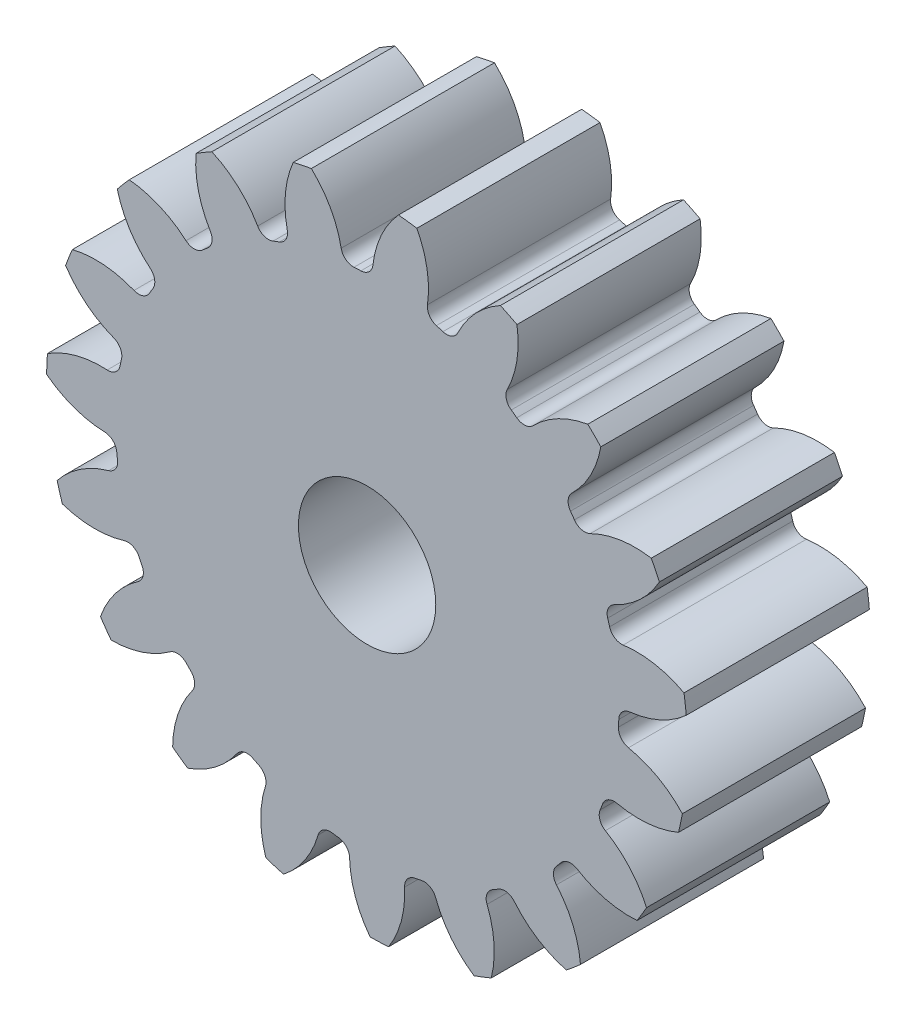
ISO-10303-21;
HEADER;
FILE_DESCRIPTION(('STEP AP214'),'2;1');
FILE_NAME('part.step','',(''),(''),'','','');
FILE_SCHEMA(('AUTOMOTIVE_DESIGN { 1 0 10303 214 1 1 1 1 }'));
ENDSEC;
DATA;
#1=APPLICATION_CONTEXT('core data for automotive mechanical design processes');
#2=APPLICATION_PROTOCOL_DEFINITION('international standard','automotive_design',2000,#1);
#3=PRODUCT_CONTEXT('',#1,'mechanical');
#4=PRODUCT('Part','Part','',(#3));
#5=PRODUCT_RELATED_PRODUCT_CATEGORY('part','',(#4));
#6=PRODUCT_DEFINITION_FORMATION('','',#4);
#7=PRODUCT_DEFINITION_CONTEXT('part definition',#1,'design');
#8=PRODUCT_DEFINITION('design','',#6,#7);
#9=PRODUCT_DEFINITION_SHAPE('','',#8);
#10=(LENGTH_UNIT() NAMED_UNIT(*) SI_UNIT(.MILLI.,.METRE.));
#11=(NAMED_UNIT(*) PLANE_ANGLE_UNIT() SI_UNIT($,.RADIAN.));
#12=(NAMED_UNIT(*) SI_UNIT($,.STERADIAN.) SOLID_ANGLE_UNIT());
#13=UNCERTAINTY_MEASURE_WITH_UNIT(LENGTH_MEASURE(1.E-05),#10,'distance_accuracy_value','');
#14=(GEOMETRIC_REPRESENTATION_CONTEXT(3) GLOBAL_UNCERTAINTY_ASSIGNED_CONTEXT((#13)) GLOBAL_UNIT_ASSIGNED_CONTEXT((#10,
#11,#12)) REPRESENTATION_CONTEXT('',''));
#15=CARTESIAN_POINT('',(0.,0.,0.));
#16=DIRECTION('',(0.,0.,1.));
#17=DIRECTION('',(1.,0.,0.));
#18=AXIS2_PLACEMENT_3D('',#15,#16,#17);
#19=CARTESIAN_POINT('',(0.,0.,101.6));
#20=DIRECTION('',(0.,0.,-1.));
#21=DIRECTION('',(-1.,0.,0.));
#22=AXIS2_PLACEMENT_3D('',#19,#20,#21);
#23=CYLINDRICAL_SURFACE('',#22,177.8);
#24=DIRECTION('',(0.,0.,-1.));
#25=VECTOR('',#24,1.);
#26=CARTESIAN_POINT('',(175.807967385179,26.5405087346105,50.8));
#27=LINE('',#26,#25);
#28=CARTESIAN_POINT('',(175.807967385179,26.5405087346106,101.6));
#29=VERTEX_POINT('',#28);
#30=CARTESIAN_POINT('',(175.807967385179,26.5405087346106,0.));
#31=VERTEX_POINT('',#30);
#32=EDGE_CURVE('E780',#29,#31,#27,.T.);
#33=ORIENTED_EDGE('',*,*,#32,.F.);
#34=CARTESIAN_POINT('',(0.,0.,101.6));
#35=DIRECTION('',(0.,0.,1.));
#36=DIRECTION('',(1.,0.,0.));
#37=AXIS2_PLACEMENT_3D('',#34,#35,#36);
#38=CIRCLE('',#37,177.8);
#39=CARTESIAN_POINT('',(177.045661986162,16.360732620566,101.6));
#40=VERTEX_POINT('',#39);
#41=EDGE_CURVE('E1463',#40,#29,#38,.T.);
#42=ORIENTED_EDGE('',*,*,#41,.F.);
#43=DIRECTION('',(0.,0.,-1.));
#44=VECTOR('',#43,1.);
#45=CARTESIAN_POINT('',(177.045661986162,16.360732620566,50.8));
#46=LINE('',#45,#44);
#47=CARTESIAN_POINT('',(177.045661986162,16.360732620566,0.));
#48=VERTEX_POINT('',#47);
#49=EDGE_CURVE('E1457',#48,#40,#46,.F.);
#50=ORIENTED_EDGE('',*,*,#49,.F.);
#51=CARTESIAN_POINT('',(0.,0.,0.));
#52=DIRECTION('',(0.,0.,1.));
#53=DIRECTION('',(1.,0.,0.));
#54=AXIS2_PLACEMENT_3D('',#51,#52,#53);
#55=CIRCLE('',#54,177.8);
#56=EDGE_CURVE('E1468',#48,#31,#55,.T.);
#57=ORIENTED_EDGE('',*,*,#56,.T.);
#58=EDGE_LOOP('',(#33,#42,#50,#57));
#59=FACE_BOUND('',#58,.T.);
#60=ADVANCED_FACE('F33',(#59),#23,.T.);
#61=DIRECTION('',(0.,0.,-1.));
#62=VECTOR('',#61,1.);
#63=CARTESIAN_POINT('',(162.140518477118,72.9608954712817,50.8));
#64=LINE('',#63,#62);
#65=CARTESIAN_POINT('',(162.140518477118,72.9608954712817,0.));
#66=VERTEX_POINT('',#65);
#67=CARTESIAN_POINT('',(162.140518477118,72.9608954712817,101.6));
#68=VERTEX_POINT('',#67);
#69=EDGE_CURVE('E751',#66,#68,#64,.F.);
#70=ORIENTED_EDGE('',*,*,#69,.F.);
#71=CARTESIAN_POINT('',(157.664517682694,82.1872244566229,0.));
#72=VERTEX_POINT('',#71);
#73=EDGE_CURVE('E1471',#66,#72,#55,.T.);
#74=ORIENTED_EDGE('',*,*,#73,.T.);
#75=DIRECTION('',(0.,0.,-1.));
#76=VECTOR('',#75,1.);
#77=CARTESIAN_POINT('',(157.664517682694,82.1872244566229,50.8));
#78=LINE('',#77,#76);
#79=CARTESIAN_POINT('',(157.664517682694,82.1872244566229,101.6));
#80=VERTEX_POINT('',#79);
#81=EDGE_CURVE('E813',#80,#72,#78,.T.);
#82=ORIENTED_EDGE('',*,*,#81,.F.);
#83=EDGE_CURVE('E1466',#68,#80,#38,.T.);
#84=ORIENTED_EDGE('',*,*,#83,.F.);
#85=EDGE_LOOP('',(#70,#74,#82,#84));
#86=FACE_BOUND('',#85,.T.);
#87=ADVANCED_FACE('F1686',(#86),#23,.T.);
#88=CARTESIAN_POINT('',(0.,0.,101.6));
#89=DIRECTION('',(0.,0.,1.));
#90=DIRECTION('',(1.,0.,0.));
#91=AXIS2_PLACEMENT_3D('',#88,#89,#90);
#92=PLANE('',#91);
#93=CARTESIAN_POINT('',(0.,0.,101.599999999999));
#94=DIRECTION('',(0.,0.,1.));
#95=DIRECTION('',(1.,0.,0.));
#96=AXIS2_PLACEMENT_3D('',#93,#94,#95);
#97=CIRCLE('',#96,38.1);
#98=CARTESIAN_POINT('',(38.1,0.,101.599999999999));
#99=VERTEX_POINT('',#98);
#100=EDGE_CURVE('E768',#99,#99,#97,.T.);
#101=ORIENTED_EDGE('',*,*,#100,.F.);
#102=EDGE_LOOP('',(#101));
#103=FACE_BOUND('',#102,.T.);
#104=ORIENTED_EDGE('',*,*,#41,.T.);
#105=CARTESIAN_POINT('',(149.451506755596,-22.6973730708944,101.6));
#106=DIRECTION('',(0.,0.,-1.));
#107=DIRECTION('',(0.945817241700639,0.32469946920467,0.));
#108=AXIS2_PLACEMENT_3D('',#105,#106,#107);
#109=CIRCLE('',#108,55.8482947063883);
#110=CARTESIAN_POINT('',(142.08105657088,32.6624362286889,101.6));
#111=VERTEX_POINT('',#110);
#112=EDGE_CURVE('E760',#111,#29,#109,.T.);
#113=ORIENTED_EDGE('',*,*,#112,.F.);
#114=CARTESIAN_POINT('',(141.171518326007,39.4940221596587,101.6));
#115=DIRECTION('',(0.,0.,1.));
#116=DIRECTION('',(-0.945817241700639,-0.32469946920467,0.));
#117=AXIS2_PLACEMENT_3D('',#114,#115,#116);
#118=CIRCLE('',#117,6.89186666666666);
#119=CARTESIAN_POINT('',(134.534483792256,37.6372511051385,101.6));
#120=VERTEX_POINT('',#119);
#121=EDGE_CURVE('E758',#120,#111,#118,.T.);
#122=ORIENTED_EDGE('',*,*,#121,.F.);
#123=CARTESIAN_POINT('',(0.,0.,101.6));
#124=DIRECTION('',(0.,0.,-1.));
#125=DIRECTION('',(0.945817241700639,0.32469946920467,0.));
#126=AXIS2_PLACEMENT_3D('',#123,#124,#125);
#127=CIRCLE('',#126,139.7);
#128=CARTESIAN_POINT('',(133.465118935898,41.2692625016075,101.6));
#129=VERTEX_POINT('',#128);
#130=EDGE_CURVE('E743',#129,#120,#127,.T.);
#131=ORIENTED_EDGE('',*,*,#130,.F.);
#132=CARTESIAN_POINT('',(140.049398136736,43.3052127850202,101.6));
#133=DIRECTION('',(0.,0.,1.));
#134=DIRECTION('',(-0.945817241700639,-0.32469946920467,0.));
#135=AXIS2_PLACEMENT_3D('',#132,#133,#134);
#136=CIRCLE('',#135,6.89186666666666);
#137=CARTESIAN_POINT('',(137.111917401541,49.5397162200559,101.6));
#138=VERTEX_POINT('',#137);
#139=EDGE_CURVE('E735',#138,#129,#136,.T.);
#140=ORIENTED_EDGE('',*,*,#139,.F.);
#141=CARTESIAN_POINT('',(113.308019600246,100.061062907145,101.6));
#142=DIRECTION('',(0.,0.,-1.));
#143=DIRECTION('',(-0.945817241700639,-0.32469946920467,0.));
#144=AXIS2_PLACEMENT_3D('',#141,#142,#143);
#145=CIRCLE('',#144,55.8482947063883);
#146=EDGE_CURVE('E765',#68,#138,#145,.T.);
#147=ORIENTED_EDGE('',*,*,#146,.F.);
#148=ORIENTED_EDGE('',*,*,#83,.T.);
#149=CARTESIAN_POINT('',(148.723636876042,27.0592581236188,101.6));
#150=DIRECTION('',(0.,0.,-1.));
#151=DIRECTION('',(0.789140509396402,0.614212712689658,0.));
#152=AXIS2_PLACEMENT_3D('',#149,#150,#151);
#153=CIRCLE('',#152,55.8482947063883);
#154=CARTESIAN_POINT('',(123.777237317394,77.0263389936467,101.6));
#155=VERTEX_POINT('',#154);
#156=EDGE_CURVE('E789',#155,#80,#153,.T.);
#157=ORIENTED_EDGE('',*,*,#156,.F.);
#158=CARTESIAN_POINT('',(120.698768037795,83.192444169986,101.6));
#159=DIRECTION('',(0.,0.,1.));
#160=DIRECTION('',(-0.789140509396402,-0.614212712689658,0.));
#161=AXIS2_PLACEMENT_3D('',#158,#159,#160);
#162=CIRCLE('',#161,6.89186666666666);
#163=CARTESIAN_POINT('',(115.024238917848,79.2812365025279,101.6));
#164=VERTEX_POINT('',#163);
#165=EDGE_CURVE('E787',#164,#155,#162,.T.);
#166=ORIENTED_EDGE('',*,*,#165,.F.);
#167=CARTESIAN_POINT('',(0.,0.,101.6));
#168=DIRECTION('',(0.,0.,-1.));
#169=DIRECTION('',(0.789140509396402,0.614212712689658,0.));
#170=AXIS2_PLACEMENT_3D('',#167,#168,#169);
#171=CIRCLE('',#170,139.7);
#172=CARTESIAN_POINT('',(112.833503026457,82.369233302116,101.6));
#173=VERTEX_POINT('',#172);
#174=EDGE_CURVE('E784',#173,#164,#171,.T.);
#175=ORIENTED_EDGE('',*,*,#174,.F.);
#176=CARTESIAN_POINT('',(118.399955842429,86.4327821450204,101.6));
#177=DIRECTION('',(0.,0.,1.));
#178=DIRECTION('',(-0.789140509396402,-0.614212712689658,0.));
#179=AXIS2_PLACEMENT_3D('',#176,#177,#178);
#180=CIRCLE('',#179,6.89186666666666);
#181=CARTESIAN_POINT('',(113.597295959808,91.3756845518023,101.6));
#182=VERTEX_POINT('',#181);
#183=EDGE_CURVE('E782',#182,#173,#180,.T.);
#184=ORIENTED_EDGE('',*,*,#183,.F.);
#185=CARTESIAN_POINT('',(74.6789045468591,131.430532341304,101.6));
#186=DIRECTION('',(0.,0.,-1.));
#187=DIRECTION('',(-0.789140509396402,-0.614212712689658,0.));
#188=AXIS2_PLACEMENT_3D('',#185,#186,#187);
#189=CIRCLE('',#188,55.8482947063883);
#190=CARTESIAN_POINT('',(129.664933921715,121.654613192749,101.6));
#191=VERTEX_POINT('',#190);
#192=EDGE_CURVE('E792',#191,#182,#189,.T.);
#193=ORIENTED_EDGE('',*,*,#192,.F.);
#194=CARTESIAN_POINT('',(122.435671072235,128.927679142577,101.6));
#195=VERTEX_POINT('',#194);
#196=EDGE_CURVE('E1517',#191,#195,#38,.T.);
#197=ORIENTED_EDGE('',*,*,#196,.T.);
#198=CARTESIAN_POINT('',(131.879253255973,73.8835988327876,101.6));
#199=DIRECTION('',(0.,0.,-1.));
#200=DIRECTION('',(0.546948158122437,0.837166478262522,0.));
#201=AXIS2_PLACEMENT_3D('',#198,#199,#200);
#202=CIRCLE('',#201,55.8482947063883);
#203=CARTESIAN_POINT('',(92.0602337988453,113.043242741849,101.6));
#204=VERTEX_POINT('',#203);
#205=EDGE_CURVE('E824',#204,#195,#202,.T.);
#206=ORIENTED_EDGE('',*,*,#205,.F.);
#207=CARTESIAN_POINT('',(87.1464333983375,117.875673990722,101.6));
#208=DIRECTION('',(0.,0.,1.));
#209=DIRECTION('',(-0.546948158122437,-0.837166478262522,0.));
#210=AXIS2_PLACEMENT_3D('',#207,#208,#209);
#211=CIRCLE('',#210,6.89186666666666);
#212=CARTESIAN_POINT('',(83.0493329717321,112.333869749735,101.6));
#213=VERTEX_POINT('',#212);
#214=EDGE_CURVE('E822',#213,#204,#211,.T.);
#215=ORIENTED_EDGE('',*,*,#214,.F.);
#216=CARTESIAN_POINT('',(0.,0.,101.6));
#217=DIRECTION('',(0.,0.,-1.));
#218=DIRECTION('',(0.546948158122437,0.837166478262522,0.));
#219=AXIS2_PLACEMENT_3D('',#216,#217,#218);
#220=CIRCLE('',#219,139.7);
#221=CARTESIAN_POINT('',(79.9746262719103,114.543219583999,101.6));
#222=VERTEX_POINT('',#221);
#223=EDGE_CURVE('E819',#222,#213,#220,.T.);
#224=ORIENTED_EDGE('',*,*,#223,.F.);
#225=CARTESIAN_POINT('',(83.9200411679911,120.19401841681,101.6));
#226=DIRECTION('',(0.,0.,1.));
#227=DIRECTION('',(-0.546948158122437,-0.837166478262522,0.));
#228=AXIS2_PLACEMENT_3D('',#225,#226,#227);
#229=CIRCLE('',#228,6.89186666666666);
#230=CARTESIAN_POINT('',(77.7726448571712,123.30967962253,101.6));
#231=VERTEX_POINT('',#230);
#232=EDGE_CURVE('E817',#231,#222,#229,.T.);
#233=ORIENTED_EDGE('',*,*,#232,.F.);
#234=CARTESIAN_POINT('',(27.9571714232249,148.55746424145,101.6));
#235=DIRECTION('',(0.,0.,-1.));
#236=DIRECTION('',(-0.546948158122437,-0.837166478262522,0.));
#237=AXIS2_PLACEMENT_3D('',#234,#235,#236);
#238=CIRCLE('',#237,55.8482947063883);
#239=CARTESIAN_POINT('',(83.1381418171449,157.165165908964,101.6));
#240=VERTEX_POINT('',#239);
#241=EDGE_CURVE('E827',#240,#231,#238,.T.);
#242=ORIENTED_EDGE('',*,*,#241,.F.);
#243=CARTESIAN_POINT('',(73.9390197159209,161.696819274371,101.6));
#244=VERTEX_POINT('',#243);
#245=EDGE_CURVE('E1668',#240,#244,#38,.T.);
#246=ORIENTED_EDGE('',*,*,#245,.T.);
#247=CARTESIAN_POINT('',(100.743706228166,112.701505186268,101.6));
#248=DIRECTION('',(0.,0.,-1.));
#249=DIRECTION('',(0.24548548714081,0.969400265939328,0.));
#250=AXIS2_PLACEMENT_3D('',#247,#248,#249);
#251=CIRCLE('',#250,55.8482947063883);
#252=CARTESIAN_POINT('',(50.3670754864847,136.810157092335,101.6));
#253=VERTEX_POINT('',#252);
#254=EDGE_CURVE('E862',#253,#244,#251,.T.);
#255=ORIENTED_EDGE('',*,*,#254,.F.);
#256=CARTESIAN_POINT('',(44.1504304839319,139.785245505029,101.6));
#257=DIRECTION('',(0.,0.,1.));
#258=DIRECTION('',(-0.24548548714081,-0.969400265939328,0.));
#259=AXIS2_PLACEMENT_3D('',#256,#257,#258);
#260=CIRCLE('',#259,6.89186666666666);
#261=CARTESIAN_POINT('',(42.0747431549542,133.213385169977,101.6));
#262=VERTEX_POINT('',#261);
#263=EDGE_CURVE('E860',#262,#253,#260,.T.);
#264=ORIENTED_EDGE('',*,*,#263,.F.);
#265=CARTESIAN_POINT('',(0.,0.,101.6));
#266=DIRECTION('',(0.,0.,-1.));
#267=DIRECTION('',(0.24548548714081,0.969400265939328,0.));
#268=AXIS2_PLACEMENT_3D('',#265,#266,#267);
#269=CIRCLE('',#268,139.7);
#270=CARTESIAN_POINT('',(38.4492578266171,134.304670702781,101.6));
#271=VERTEX_POINT('',#270);
#272=EDGE_CURVE('E857',#271,#262,#269,.T.);
#273=ORIENTED_EDGE('',*,*,#272,.F.);
#274=CARTESIAN_POINT('',(40.3460878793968,140.930367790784,101.6));
#275=DIRECTION('',(0.,0.,1.));
#276=DIRECTION('',(-0.24548548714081,-0.969400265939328,0.));
#277=AXIS2_PLACEMENT_3D('',#274,#275,#276);
#278=CIRCLE('',#277,6.89186666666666);
#279=CARTESIAN_POINT('',(33.5201209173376,141.881157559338,101.6));
#280=VERTEX_POINT('',#279);
#281=EDGE_CURVE('E855',#280,#271,#278,.T.);
#282=ORIENTED_EDGE('',*,*,#281,.F.);
#283=CARTESIAN_POINT('',(-21.7941550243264,149.585889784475,101.6));
#284=DIRECTION('',(0.,0.,-1.));
#285=DIRECTION('',(-0.24548548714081,-0.969400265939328,0.));
#286=AXIS2_PLACEMENT_3D('',#283,#284,#285);
#287=CIRCLE('',#286,55.8482947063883);
#288=CARTESIAN_POINT('',(27.6020420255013,175.64443423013,101.6));
#289=VERTEX_POINT('',#288);
#290=EDGE_CURVE('E865',#289,#280,#287,.T.);
#291=ORIENTED_EDGE('',*,*,#290,.F.);
#292=CARTESIAN_POINT('',(17.4299282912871,176.943600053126,101.6));
#293=VERTEX_POINT('',#292);
#294=EDGE_CURVE('E1664',#289,#293,#38,.T.);
#295=ORIENTED_EDGE('',*,*,#294,.T.);
#296=CARTESIAN_POINT('',(58.6910154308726,139.306454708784,101.6));
#297=DIRECTION('',(0.,0.,-1.));
#298=DIRECTION('',(-0.0825793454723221,0.996584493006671,0.));
#299=AXIS2_PLACEMENT_3D('',#296,#297,#298);
#300=CIRCLE('',#299,55.8482947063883);
#301=CARTESIAN_POINT('',(3.2158630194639,145.751568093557,101.6));
#302=VERTEX_POINT('',#301);
#303=EDGE_CURVE('E900',#302,#293,#300,.T.);
#304=ORIENTED_EDGE('',*,*,#303,.F.);
#305=CARTESIAN_POINT('',(-3.62995663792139,146.546916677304,101.6));
#306=DIRECTION('',(0.,0.,1.));
#307=DIRECTION('',(0.0825793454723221,-0.996584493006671,0.));
#308=AXIS2_PLACEMENT_3D('',#305,#306,#307);
#309=CIRCLE('',#308,6.89186666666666);
#310=CARTESIAN_POINT('',(-3.45929793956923,139.657163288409,101.6));
#311=VERTEX_POINT('',#310);
#312=EDGE_CURVE('E898',#311,#302,#309,.T.);
#313=ORIENTED_EDGE('',*,*,#312,.F.);
#314=CARTESIAN_POINT('',(0.,0.,101.6));
#315=DIRECTION('',(0.,0.,-1.));
#316=DIRECTION('',(-0.0825793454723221,0.996584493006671,0.));
#317=AXIS2_PLACEMENT_3D('',#314,#315,#316);
#318=CIRCLE('',#317,139.7);
#319=CARTESIAN_POINT('',(-7.24268430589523,139.512126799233,101.6));
#320=VERTEX_POINT('',#319);
#321=EDGE_CURVE('E895',#320,#311,#318,.T.);
#322=ORIENTED_EDGE('',*,*,#321,.F.);
#323=CARTESIAN_POINT('',(-7.59999006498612,146.394725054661,101.6));
#324=DIRECTION('',(0.,0.,1.));
#325=DIRECTION('',(0.0825793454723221,-0.996584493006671,0.));
#326=AXIS2_PLACEMENT_3D('',#323,#324,#325);
#327=CIRCLE('',#326,6.89186666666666);
#328=CARTESIAN_POINT('',(-14.3648282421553,145.077610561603,101.6));
#329=VERTEX_POINT('',#328);
#330=EDGE_CURVE('E893',#329,#320,#327,.T.);
#331=ORIENTED_EDGE('',*,*,#330,.F.);
#332=CARTESIAN_POINT('',(-69.1837466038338,134.404363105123,101.6));
#333=DIRECTION('',(0.,0.,-1.));
#334=DIRECTION('',(0.0825793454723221,-0.996584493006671,0.));
#335=AXIS2_PLACEMENT_3D('',#332,#333,#334);
#336=CIRCLE('',#335,55.8482947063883);
#337=CARTESIAN_POINT('',(-30.9251673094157,175.089902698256,101.6));
#338=VERTEX_POINT('',#337);
#339=EDGE_CURVE('E903',#338,#329,#336,.T.);
#340=ORIENTED_EDGE('',*,*,#339,.F.);
#341=CARTESIAN_POINT('',(-40.9679663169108,173.015796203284,101.6));
#342=VERTEX_POINT('',#341);
#343=EDGE_CURVE('E1660',#338,#342,#38,.T.);
#344=ORIENTED_EDGE('',*,*,#343,.T.);
#345=CARTESIAN_POINT('',(10.2782424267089,150.815388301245,101.6));
#346=DIRECTION('',(0.,0.,-1.));
#347=DIRECTION('',(-0.40169542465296,0.915773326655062,0.));
#348=AXIS2_PLACEMENT_3D('',#345,#346,#347);
#349=CIRCLE('',#348,55.8482947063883);
#350=CARTESIAN_POINT('',(-44.2838381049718,138.898535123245,101.6));
#351=VERTEX_POINT('',#350);
#352=EDGE_CURVE('E938',#351,#342,#349,.T.);
#353=ORIENTED_EDGE('',*,*,#352,.F.);
#354=CARTESIAN_POINT('',(-51.0169816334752,137.427955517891,101.6));
#355=DIRECTION('',(0.,0.,1.));
#356=DIRECTION('',(0.40169542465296,-0.915773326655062,0.));
#357=AXIS2_PLACEMENT_3D('',#354,#355,#356);
#358=CIRCLE('',#357,6.89186666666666);
#359=CARTESIAN_POINT('',(-48.6184704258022,130.966920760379,101.6));
#360=VERTEX_POINT('',#359);
#361=EDGE_CURVE('E936',#360,#351,#358,.T.);
#362=ORIENTED_EDGE('',*,*,#361,.F.);
#363=CARTESIAN_POINT('',(0.,0.,101.6));
#364=DIRECTION('',(0.,0.,-1.));
#365=DIRECTION('',(-0.40169542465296,0.915773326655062,0.));
#366=AXIS2_PLACEMENT_3D('',#363,#364,#365);
#367=CIRCLE('',#366,139.7);
#368=CARTESIAN_POINT('',(-52.1497692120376,129.601279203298,101.6));
#369=VERTEX_POINT('',#368);
#370=EDGE_CURVE('E933',#369,#360,#367,.T.);
#371=ORIENTED_EDGE('',*,*,#370,.F.);
#372=CARTESIAN_POINT('',(-54.7224911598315,135.994942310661,101.6));
#373=DIRECTION('',(0.,0.,1.));
#374=DIRECTION('',(0.40169542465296,-0.915773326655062,0.));
#375=AXIS2_PLACEMENT_3D('',#372,#373,#374);
#376=CIRCLE('',#375,6.89186666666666);
#377=CARTESIAN_POINT('',(-60.6931253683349,132.55265334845,101.6));
#378=VERTEX_POINT('',#377);
#379=EDGE_CURVE('E931',#378,#369,#376,.T.);
#380=ORIENTED_EDGE('',*,*,#379,.F.);
#381=CARTESIAN_POINT('',(-109.076205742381,104.658038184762,101.6));
#382=DIRECTION('',(0.,0.,-1.));
#383=DIRECTION('',(0.40169542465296,-0.915773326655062,0.));
#384=AXIS2_PLACEMENT_3D('',#381,#382,#383);
#385=CIRCLE('',#384,55.8482947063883);
#386=CARTESIAN_POINT('',(-86.1011549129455,155.561663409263,101.6));
#387=VERTEX_POINT('',#386);
#388=EDGE_CURVE('E941',#387,#378,#385,.T.);
#389=ORIENTED_EDGE('',*,*,#388,.F.);
#390=CARTESIAN_POINT('',(-94.9263460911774,150.339046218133,101.6));
#391=VERTEX_POINT('',#390);
#392=EDGE_CURVE('E1656',#387,#391,#38,.T.);
#393=ORIENTED_EDGE('',*,*,#392,.T.);
#394=CARTESIAN_POINT('',(-39.2483376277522,145.981134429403,101.6));
#395=DIRECTION('',(0.,0.,-1.));
#396=DIRECTION('',(-0.677281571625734,0.735723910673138,0.));
#397=AXIS2_PLACEMENT_3D('',#394,#395,#396);
#398=CIRCLE('',#397,55.8482947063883);
#399=CARTESIAN_POINT('',(-86.9846982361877,116.993690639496,101.6));
#400=VERTEX_POINT('',#399);
#401=EDGE_CURVE('E976',#400,#391,#398,.T.);
#402=ORIENTED_EDGE('',*,*,#401,.F.);
#403=CARTESIAN_POINT('',(-92.8755250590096,113.416542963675,101.6));
#404=DIRECTION('',(0.,0.,1.));
#405=DIRECTION('',(0.677281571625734,-0.735723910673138,0.));
#406=AXIS2_PLACEMENT_3D('',#403,#404,#405);
#407=CIRCLE('',#406,6.89186666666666);
#408=CARTESIAN_POINT('',(-88.5090772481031,108.084380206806,101.6));
#409=VERTEX_POINT('',#408);
#410=EDGE_CURVE('E974',#409,#400,#407,.T.);
#411=ORIENTED_EDGE('',*,*,#410,.F.);
#412=CARTESIAN_POINT('',(0.,0.,101.6));
#413=DIRECTION('',(0.,0.,-1.));
#414=DIRECTION('',(-0.677281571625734,0.735723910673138,0.));
#415=AXIS2_PLACEMENT_3D('',#412,#413,#414);
#416=CIRCLE('',#415,139.7);
#417=CARTESIAN_POINT('',(-91.405617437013,105.646122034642,101.6));
#418=VERTEX_POINT('',#417);
#419=EDGE_CURVE('E971',#418,#409,#416,.T.);
#420=ORIENTED_EDGE('',*,*,#419,.F.);
#421=CARTESIAN_POINT('',(-95.9149612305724,110.857997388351,101.6));
#422=DIRECTION('',(0.,0.,1.));
#423=DIRECTION('',(0.677281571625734,-0.735723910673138,0.));
#424=AXIS2_PLACEMENT_3D('',#421,#422,#423);
#425=CIRCLE('',#424,6.89186666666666);
#426=CARTESIAN_POINT('',(-100.444380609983,105.663559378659,101.6));
#427=VERTEX_POINT('',#426);
#428=EDGE_CURVE('E969',#427,#418,#425,.T.);
#429=ORIENTED_EDGE('',*,*,#428,.F.);
#430=CARTESIAN_POINT('',(-137.148565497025,63.5703908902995,101.6));
#431=DIRECTION('',(0.,0.,-1.));
#432=DIRECTION('',(0.677281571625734,-0.735723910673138,0.));
#433=AXIS2_PLACEMENT_3D('',#430,#431,#432);
#434=CIRCLE('',#433,55.8482947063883);
#435=CARTESIAN_POINT('',(-131.946746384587,119.175904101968,101.6));
#436=VERTEX_POINT('',#435);
#437=EDGE_CURVE('E979',#436,#427,#434,.T.);
#438=ORIENTED_EDGE('',*,*,#437,.F.);
#439=CARTESIAN_POINT('',(-138.597983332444,111.370727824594,101.6));
#440=VERTEX_POINT('',#439);
#441=EDGE_CURVE('E1652',#436,#440,#38,.T.);
#442=ORIENTED_EDGE('',*,*,#441,.T.);
#443=CARTESIAN_POINT('',(-84.5217512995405,125.32755951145,101.6));
#444=DIRECTION('',(0.,0.,-1.));
#445=DIRECTION('',(-0.879473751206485,0.475947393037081,0.));
#446=AXIS2_PLACEMENT_3D('',#443,#444,#445);
#447=CIRCLE('',#446,55.8482947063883);
#448=CARTESIAN_POINT('',(-120.259416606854,82.4107644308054,101.6));
#449=VERTEX_POINT('',#448);
#450=EDGE_CURVE('E1014',#449,#440,#447,.T.);
#451=ORIENTED_EDGE('',*,*,#450,.F.);
#452=CARTESIAN_POINT('',(-124.669564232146,77.1146881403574,101.6));
#453=DIRECTION('',(0.,0.,1.));
#454=DIRECTION('',(0.879473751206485,-0.475947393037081,0.));
#455=AXIS2_PLACEMENT_3D('',#452,#453,#454);
#456=CIRCLE('',#455,6.89186666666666);
#457=CARTESIAN_POINT('',(-118.808352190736,73.489219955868,101.6));
#458=VERTEX_POINT('',#457);
#459=EDGE_CURVE('E1012',#458,#449,#456,.T.);
#460=ORIENTED_EDGE('',*,*,#459,.F.);
#461=CARTESIAN_POINT('',(0.,0.,101.6));
#462=DIRECTION('',(0.,0.,-1.));
#463=DIRECTION('',(-0.879473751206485,0.475947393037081,0.));
#464=AXIS2_PLACEMENT_3D('',#461,#462,#463);
#465=CIRCLE('',#464,139.7);
#466=CARTESIAN_POINT('',(-120.756248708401,70.2425682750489,101.6));
#467=VERTEX_POINT('',#466);
#468=EDGE_CURVE('E1009',#467,#458,#465,.T.);
#469=ORIENTED_EDGE('',*,*,#468,.F.);
#470=CARTESIAN_POINT('',(-126.713556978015,73.7078683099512,101.6));
#471=DIRECTION('',(0.,0.,1.));
#472=DIRECTION('',(0.879473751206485,-0.475947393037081,0.));
#473=AXIS2_PLACEMENT_3D('',#470,#471,#472);
#474=CIRCLE('',#473,6.89186666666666);
#475=CARTESIAN_POINT('',(-129.310928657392,67.3241792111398,101.6));
#476=VERTEX_POINT('',#475);
#477=EDGE_CURVE('E1007',#476,#467,#474,.T.);
#478=ORIENTED_EDGE('',*,*,#477,.F.);
#479=CARTESIAN_POINT('',(-150.35875010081,15.5939053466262,101.6));
#480=DIRECTION('',(0.,0.,-1.));
#481=DIRECTION('',(0.879473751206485,-0.475947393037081,0.));
#482=AXIS2_PLACEMENT_3D('',#479,#480,#481);
#483=CIRCLE('',#482,55.8482947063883);
#484=CARTESIAN_POINT('',(-163.49386052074,69.8755863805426,101.6));
#485=VERTEX_POINT('',#484);
#486=EDGE_CURVE('E1017',#485,#476,#483,.T.);
#487=ORIENTED_EDGE('',*,*,#486,.F.);
#488=CARTESIAN_POINT('',(-167.250378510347,60.333662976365,101.6));
#489=VERTEX_POINT('',#488);
#490=EDGE_CURVE('E1648',#485,#489,#38,.T.);
#491=ORIENTED_EDGE('',*,*,#490,.T.);
#492=CARTESIAN_POINT('',(-120.635921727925,91.0927988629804,101.6));
#493=DIRECTION('',(0.,0.,-1.));
#494=DIRECTION('',(-0.986361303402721,0.164594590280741,0.));
#495=AXIS2_PLACEMENT_3D('',#492,#493,#494);
#496=CIRCLE('',#495,55.8482947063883);
#497=CARTESIAN_POINT('',(-140.502161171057,38.8973531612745,101.6));
#498=VERTEX_POINT('',#497);
#499=EDGE_CURVE('E1052',#498,#489,#496,.T.);
#500=ORIENTED_EDGE('',*,*,#499,.F.);
#501=CARTESIAN_POINT('',(-142.953721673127,32.4562602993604,101.6));
#502=DIRECTION('',(0.,0.,1.));
#503=DIRECTION('',(0.986361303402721,-0.164594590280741,0.));
#504=AXIS2_PLACEMENT_3D('',#501,#502,#503);
#505=CIRCLE('',#504,6.89186666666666);
#506=CARTESIAN_POINT('',(-136.232898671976,30.930362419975,101.6));
#507=VERTEX_POINT('',#506);
#508=EDGE_CURVE('E1050',#507,#498,#505,.T.);
#509=ORIENTED_EDGE('',*,*,#508,.F.);
#510=CARTESIAN_POINT('',(0.,0.,101.6));
#511=DIRECTION('',(0.,0.,-1.));
#512=DIRECTION('',(-0.986361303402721,0.164594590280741,0.));
#513=AXIS2_PLACEMENT_3D('',#510,#511,#512);
#514=CIRCLE('',#513,139.7);
#515=CARTESIAN_POINT('',(-137.021066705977,27.2271423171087,101.6));
#516=VERTEX_POINT('',#515);
#517=EDGE_CURVE('E1047',#516,#507,#514,.T.);
#518=ORIENTED_EDGE('',*,*,#517,.F.);
#519=CARTESIAN_POINT('',(-143.780772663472,28.5703480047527,101.6));
#520=DIRECTION('',(0.,0.,1.));
#521=DIRECTION('',(0.986361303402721,-0.164594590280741,0.));
#522=AXIS2_PLACEMENT_3D('',#519,#520,#521);
#523=CIRCLE('',#522,6.89186666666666);
#524=CARTESIAN_POINT('',(-144.16463111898,21.6891795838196,101.6));
#525=VERTEX_POINT('',#524);
#526=EDGE_CURVE('E1045',#525,#516,#523,.T.);
#527=ORIENTED_EDGE('',*,*,#526,.F.);
#528=CARTESIAN_POINT('',(-147.275231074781,-34.072421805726,101.6));
#529=DIRECTION('',(0.,0.,-1.));
#530=DIRECTION('',(0.986361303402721,-0.164594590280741,0.));
#531=AXIS2_PLACEMENT_3D('',#528,#529,#530);
#532=CIRCLE('',#531,55.8482947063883);
#533=CARTESIAN_POINT('',(-177.323878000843,13.0031646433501,101.6));
#534=VERTEX_POINT('',#533);
#535=EDGE_CURVE('E1055',#534,#525,#532,.T.);
#536=ORIENTED_EDGE('',*,*,#535,.F.);
#537=CARTESIAN_POINT('',(-177.778600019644,2.75850957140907,101.6));
#538=VERTEX_POINT('',#537);
#539=EDGE_CURVE('E1644',#534,#538,#38,.T.);
#540=ORIENTED_EDGE('',*,*,#539,.T.);
#541=CARTESIAN_POINT('',(-143.677318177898,46.9867200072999,101.6));
#542=DIRECTION('',(0.,0.,-1.));
#543=DIRECTION('',(-0.986361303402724,-0.164594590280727,0.));
#544=AXIS2_PLACEMENT_3D('',#541,#542,#543);
#545=CIRCLE('',#544,55.8482947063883);
#546=CARTESIAN_POINT('',(-145.51931645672,-8.83118987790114,101.6));
#547=VERTEX_POINT('',#546);
#548=EDGE_CURVE('E1090',#547,#538,#545,.T.);
#549=ORIENTED_EDGE('',*,*,#548,.F.);
#550=CARTESIAN_POINT('',(-145.746625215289,-15.7193069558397,101.6));
#551=DIRECTION('',(0.,0.,1.));
#552=DIRECTION('',(0.986361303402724,0.164594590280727,0.));
#553=AXIS2_PLACEMENT_3D('',#550,#551,#552);
#554=CIRCLE('',#553,6.89186666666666);
#555=CARTESIAN_POINT('',(-138.894496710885,-14.9802798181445,101.6));
#556=VERTEX_POINT('',#555);
#557=EDGE_CURVE('E1088',#556,#547,#554,.T.);
#558=ORIENTED_EDGE('',*,*,#557,.F.);
#559=CARTESIAN_POINT('',(0.,0.,101.6));
#560=DIRECTION('',(0.,0.,-1.));
#561=DIRECTION('',(-0.986361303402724,-0.164594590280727,0.));
#562=AXIS2_PLACEMENT_3D('',#559,#560,#561);
#563=CIRCLE('',#562,139.7);
#564=CARTESIAN_POINT('',(-138.437526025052,-18.7387669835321,101.6));
#565=VERTEX_POINT('',#564);
#566=EDGE_CURVE('E1085',#565,#556,#563,.T.);
#567=ORIENTED_EDGE('',*,*,#566,.F.);
#568=CARTESIAN_POINT('',(-145.267110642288,-19.6632128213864,101.6));
#569=DIRECTION('',(0.,0.,1.));
#570=DIRECTION('',(0.986361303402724,0.164594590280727,0.));
#571=AXIS2_PLACEMENT_3D('',#568,#569,#570);
#572=CIRCLE('',#571,6.89186666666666);
#573=CARTESIAN_POINT('',(-143.395858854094,-26.2961791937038,101.6));
#574=VERTEX_POINT('',#573);
#575=EDGE_CURVE('E1083',#574,#565,#572,.T.);
#576=ORIENTED_EDGE('',*,*,#575,.F.);
#577=CARTESIAN_POINT('',(-128.232155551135,-80.0464733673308,101.6));
#578=DIRECTION('',(0.,0.,-1.));
#579=DIRECTION('',(0.986361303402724,0.164594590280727,0.));
#580=AXIS2_PLACEMENT_3D('',#577,#578,#579);
#581=CIRCLE('',#580,55.8482947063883);
#582=CARTESIAN_POINT('',(-171.938101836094,-45.2783517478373,101.6));
#583=VERTEX_POINT('',#582);
#584=EDGE_CURVE('E1093',#583,#574,#581,.T.);
#585=ORIENTED_EDGE('',*,*,#584,.F.);
#586=CARTESIAN_POINT('',(-169.041751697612,-55.1155711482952,101.6));
#587=VERTEX_POINT('',#586);
#588=EDGE_CURVE('E1640',#583,#587,#38,.T.);
#589=ORIENTED_EDGE('',*,*,#588,.T.);
#590=CARTESIAN_POINT('',(-151.149047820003,-2.21109903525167,101.6));
#591=DIRECTION('',(0.,0.,-1.));
#592=DIRECTION('',(-0.879473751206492,-0.475947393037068,0.));
#593=AXIS2_PLACEMENT_3D('',#590,#591,#592);
#594=CIRCLE('',#593,55.8482947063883);
#595=CARTESIAN_POINT('',(-134.767195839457,-55.6027364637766,101.6));
#596=VERTEX_POINT('',#595);
#597=EDGE_CURVE('E1128',#596,#587,#594,.T.);
#598=ORIENTED_EDGE('',*,*,#597,.F.);
#599=CARTESIAN_POINT('',(-132.745620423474,-62.1914433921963,101.6));
#600=DIRECTION('',(0.,0.,1.));
#601=DIRECTION('',(0.879473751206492,0.475947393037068,0.));
#602=AXIS2_PLACEMENT_3D('',#599,#600,#601);
#603=CIRCLE('',#602,6.89186666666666);
#604=CARTESIAN_POINT('',(-126.504720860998,-59.2675762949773,101.6));
#605=VERTEX_POINT('',#604);
#606=EDGE_CURVE('E1126',#605,#596,#603,.T.);
#607=ORIENTED_EDGE('',*,*,#606,.F.);
#608=CARTESIAN_POINT('',(0.,0.,101.6));
#609=DIRECTION('',(0.,0.,-1.));
#610=DIRECTION('',(-0.879473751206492,-0.475947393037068,0.));
#611=AXIS2_PLACEMENT_3D('',#608,#609,#610);
#612=CIRCLE('',#611,139.7);
#613=CARTESIAN_POINT('',(-124.852131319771,-62.6740401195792,101.6));
#614=VERTEX_POINT('',#613);
#615=EDGE_CURVE('E1123',#614,#605,#612,.T.);
#616=ORIENTED_EDGE('',*,*,#615,.F.);
#617=CARTESIAN_POINT('',(-131.011503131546,-65.7659594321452,101.6));
#618=DIRECTION('',(0.,0.,1.));
#619=DIRECTION('',(0.879473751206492,0.475947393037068,0.));
#620=AXIS2_PLACEMENT_3D('',#617,#618,#619);
#621=CIRCLE('',#620,6.89186666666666);
#622=CARTESIAN_POINT('',(-127.087920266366,-71.4319389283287,101.6));
#623=VERTEX_POINT('',#622);
#624=EDGE_CURVE('E1121',#623,#614,#621,.T.);
#625=ORIENTED_EDGE('',*,*,#624,.F.);
#626=CARTESIAN_POINT('',(-95.2931362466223,-117.346247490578,101.6));
#627=DIRECTION('',(0.,0.,-1.));
#628=DIRECTION('',(0.879473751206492,0.475947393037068,0.));
#629=AXIS2_PLACEMENT_3D('',#626,#627,#628);
#630=CIRCLE('',#629,55.8482947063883);
#631=CARTESIAN_POINT('',(-147.920164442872,-98.6532561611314,101.6));
#632=VERTEX_POINT('',#631);
#633=EDGE_CURVE('E1131',#632,#623,#630,.T.);
#634=ORIENTED_EDGE('',*,*,#633,.F.);
#635=CARTESIAN_POINT('',(-141.986606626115,-107.01702452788,101.6));
#636=VERTEX_POINT('',#635);
#637=EDGE_CURVE('E1636',#632,#636,#38,.T.);
#638=ORIENTED_EDGE('',*,*,#637,.T.);
#639=CARTESIAN_POINT('',(-142.241432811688,-51.1693111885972,101.6));
#640=DIRECTION('',(0.,0.,-1.));
#641=DIRECTION('',(-0.677281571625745,-0.735723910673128,0.));
#642=AXIS2_PLACEMENT_3D('',#639,#640,#641);
#643=CIRCLE('',#642,55.8482947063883);
#644=CARTESIAN_POINT('',(-109.410958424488,-96.3488637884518,101.6));
#645=VERTEX_POINT('',#644);
#646=EDGE_CURVE('E1166',#645,#636,#643,.T.);
#647=ORIENTED_EDGE('',*,*,#646,.F.);
#648=CARTESIAN_POINT('',(-105.35956789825,-101.924171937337,101.6));
#649=DIRECTION('',(0.,0.,1.));
#650=DIRECTION('',(0.677281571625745,0.735723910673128,0.));
#651=AXIS2_PLACEMENT_3D('',#648,#649,#650);
#652=CIRCLE('',#651,6.89186666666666);
#653=CARTESIAN_POINT('',(-100.406195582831,-97.1323112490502,101.6));
#654=VERTEX_POINT('',#653);
#655=EDGE_CURVE('E1164',#654,#645,#652,.T.);
#656=ORIENTED_EDGE('',*,*,#655,.F.);
#657=CARTESIAN_POINT('',(0.,0.,101.6));
#658=DIRECTION('',(0.,0.,-1.));
#659=DIRECTION('',(-0.677281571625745,-0.735723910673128,0.));
#660=AXIS2_PLACEMENT_3D('',#657,#658,#659);
#661=CIRCLE('',#660,139.7);
#662=CARTESIAN_POINT('',(-97.7370709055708,-99.8176085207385,101.6));
#663=VERTEX_POINT('',#662);
#664=EDGE_CURVE('E1161',#663,#654,#661,.T.);
#665=ORIENTED_EDGE('',*,*,#664,.F.);
#666=CARTESIAN_POINT('',(-102.558766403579,-104.741943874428,101.6));
#667=DIRECTION('',(0.,0.,1.));
#668=DIRECTION('',(0.677281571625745,0.735723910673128,0.));
#669=AXIS2_PLACEMENT_3D('',#666,#667,#668);
#670=CIRCLE('',#669,6.89186666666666);
#671=CARTESIAN_POINT('',(-97.0080335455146,-108.826939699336,101.6));
#672=VERTEX_POINT('',#671);
#673=EDGE_CURVE('E1159',#672,#663,#670,.T.);
#674=ORIENTED_EDGE('',*,*,#673,.F.);
#675=CARTESIAN_POINT('',(-52.0276270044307,-141.929734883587,101.6));
#676=DIRECTION('',(0.,0.,-1.));
#677=DIRECTION('',(0.677281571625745,0.735723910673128,0.));
#678=AXIS2_PLACEMENT_3D('',#675,#676,#677);
#679=CIRCLE('',#678,55.8482947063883);
#680=CARTESIAN_POINT('',(-107.872782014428,-141.337549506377,101.6));
#681=VERTEX_POINT('',#680);
#682=EDGE_CURVE('E1169',#681,#672,#679,.T.);
#683=ORIENTED_EDGE('',*,*,#682,.F.);
#684=CARTESIAN_POINT('',(-99.5450095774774,-147.321522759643,101.6));
#685=VERTEX_POINT('',#684);
#686=EDGE_CURVE('E1632',#681,#685,#38,.T.);
#687=ORIENTED_EDGE('',*,*,#686,.T.);
#688=CARTESIAN_POINT('',(-117.91975145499,-94.5825345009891,101.6));
#689=DIRECTION('',(0.,0.,-1.));
#690=DIRECTION('',(-0.401695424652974,-0.915773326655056,0.));
#691=AXIS2_PLACEMENT_3D('',#688,#689,#690);
#692=CIRCLE('',#691,55.8482947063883);
#693=CARTESIAN_POINT('',(-72.1983459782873,-126.654096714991,101.6));
#694=VERTEX_POINT('',#693);
#695=EDGE_CURVE('E1204',#694,#685,#692,.T.);
#696=ORIENTED_EDGE('',*,*,#695,.F.);
#697=CARTESIAN_POINT('',(-66.5561713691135,-130.61183493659,101.6));
#698=DIRECTION('',(0.,0.,1.));
#699=DIRECTION('',(0.401695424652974,0.915773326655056,0.));
#700=AXIS2_PLACEMENT_3D('',#697,#698,#699);
#701=CIRCLE('',#700,6.89186666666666);
#702=CARTESIAN_POINT('',(-63.4271010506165,-124.471253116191,101.6));
#703=VERTEX_POINT('',#702);
#704=EDGE_CURVE('E1202',#703,#694,#701,.T.);
#705=ORIENTED_EDGE('',*,*,#704,.F.);
#706=CARTESIAN_POINT('',(0.,0.,101.6));
#707=DIRECTION('',(0.,0.,-1.));
#708=DIRECTION('',(-0.401695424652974,-0.915773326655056,0.));
#709=AXIS2_PLACEMENT_3D('',#706,#707,#708);
#710=CIRCLE('',#709,139.7);
#711=CARTESIAN_POINT('',(-60.0306823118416,-126.144390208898,101.6));
#712=VERTEX_POINT('',#711);
#713=EDGE_CURVE('E1199',#712,#703,#710,.T.);
#714=ORIENTED_EDGE('',*,*,#713,.F.);
#715=CARTESIAN_POINT('',(-62.9921959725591,-132.367513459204,101.6));
#716=DIRECTION('',(0.,0.,1.));
#717=DIRECTION('',(0.401695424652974,0.915773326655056,0.));
#718=AXIS2_PLACEMENT_3D('',#715,#716,#717);
#719=CIRCLE('',#718,6.89186666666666);
#720=CARTESIAN_POINT('',(-56.4158211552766,-134.428852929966,101.6));
#721=VERTEX_POINT('',#720);
#722=EDGE_CURVE('E1197',#721,#712,#719,.T.);
#723=ORIENTED_EDGE('',*,*,#722,.F.);
#724=CARTESIAN_POINT('',(-3.12411708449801,-151.132933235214,101.6));
#725=DIRECTION('',(0.,0.,-1.));
#726=DIRECTION('',(0.401695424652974,0.915773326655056,0.));
#727=AXIS2_PLACEMENT_3D('',#724,#725,#726);
#728=CIRCLE('',#727,55.8482947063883);
#729=CARTESIAN_POINT('',(-56.1357098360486,-168.705726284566,101.6));
#730=VERTEX_POINT('',#729);
#731=EDGE_CURVE('E1207',#730,#721,#728,.T.);
#732=ORIENTED_EDGE('',*,*,#731,.F.);
#733=CARTESIAN_POINT('',(-46.3161661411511,-171.661448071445,101.6));
#734=VERTEX_POINT('',#733);
#735=EDGE_CURVE('E1628',#730,#734,#38,.T.);
#736=ORIENTED_EDGE('',*,*,#735,.T.);
#737=CARTESIAN_POINT('',(-80.8196353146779,-127.746272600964,101.6));
#738=DIRECTION('',(0.,0.,-1.));
#739=DIRECTION('',(-0.082579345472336,-0.99658449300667,0.));
#740=AXIS2_PLACEMENT_3D('',#737,#738,#739);
#741=CIRCLE('',#740,55.8482947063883);
#742=CARTESIAN_POINT('',(-27.1619224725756,-143.234393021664,101.6));
#743=VERTEX_POINT('',#742);
#744=EDGE_CURVE('E1242',#743,#734,#741,.T.);
#745=ORIENTED_EDGE('',*,*,#744,.F.);
#746=CARTESIAN_POINT('',(-20.5403809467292,-145.145678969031,101.6));
#747=DIRECTION('',(0.,0.,1.));
#748=DIRECTION('',(0.082579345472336,0.99658449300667,0.));
#749=AXIS2_PLACEMENT_3D('',#746,#747,#748);
#750=CIRCLE('',#749,6.89186666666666);
#751=CARTESIAN_POINT('',(-19.5746959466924,-138.321803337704,101.6));
#752=VERTEX_POINT('',#751);
#753=EDGE_CURVE('E1240',#752,#743,#750,.T.);
#754=ORIENTED_EDGE('',*,*,#753,.F.);
#755=CARTESIAN_POINT('',(0.,0.,101.6));
#756=DIRECTION('',(0.,0.,-1.));
#757=DIRECTION('',(-0.082579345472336,-0.99658449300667,0.));
#758=AXIS2_PLACEMENT_3D('',#755,#756,#757);
#759=CIRCLE('',#758,139.7);
#760=CARTESIAN_POINT('',(-15.8190378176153,-138.801469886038,101.6));
#761=VERTEX_POINT('',#760);
#762=EDGE_CURVE('E1237',#761,#752,#759,.T.);
#763=ORIENTED_EDGE('',*,*,#762,.F.);
#764=CARTESIAN_POINT('',(-16.5994436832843,-145.649009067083,101.6));
#765=DIRECTION('',(0.,0.,1.));
#766=DIRECTION('',(0.082579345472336,0.99658449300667,0.));
#767=AXIS2_PLACEMENT_3D('',#764,#765,#766);
#768=CIRCLE('',#767,6.89186666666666);
#769=CARTESIAN_POINT('',(-9.71007916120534,-145.463314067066,101.6));
#770=VERTEX_POINT('',#769);
#771=EDGE_CURVE('E1235',#770,#761,#768,.T.);
#772=ORIENTED_EDGE('',*,*,#771,.F.);
#773=CARTESIAN_POINT('',(46.1179393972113,-143.958533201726,101.6));
#774=DIRECTION('',(0.,0.,-1.));
#775=DIRECTION('',(0.082579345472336,0.99658449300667,0.));
#776=AXIS2_PLACEMENT_3D('',#773,#774,#775);
#777=CIRCLE('',#776,55.8482947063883);
#778=CARTESIAN_POINT('',(1.6845375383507,-177.792019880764,101.6));
#779=VERTEX_POINT('',#778);
#780=EDGE_CURVE('E1245',#779,#770,#777,.T.);
#781=ORIENTED_EDGE('',*,*,#780,.F.);
#782=CARTESIAN_POINT('',(11.9317525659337,-177.399191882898,101.6));
#783=VERTEX_POINT('',#782);
#784=EDGE_CURVE('E1624',#779,#783,#38,.T.);
#785=ORIENTED_EDGE('',*,*,#784,.T.);
#786=CARTESIAN_POINT('',(-34.9614576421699,-147.066719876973,101.6));
#787=DIRECTION('',(0.,0.,-1.));
#788=DIRECTION('',(0.245485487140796,-0.969400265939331,0.));
#789=AXIS2_PLACEMENT_3D('',#786,#787,#788);
#790=CIRCLE('',#789,55.8482947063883);
#791=CARTESIAN_POINT('',(20.8179167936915,-144.293020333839,101.6));
#792=VERTEX_POINT('',#791);
#793=EDGE_CURVE('E1280',#792,#783,#790,.T.);
#794=ORIENTED_EDGE('',*,*,#793,.F.);
#795=CARTESIAN_POINT('',(27.7012784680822,-143.95073651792,101.6));
#796=DIRECTION('',(0.,0.,1.));
#797=DIRECTION('',(-0.245485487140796,0.969400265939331,0.));
#798=AXIS2_PLACEMENT_3D('',#795,#796,#797);
#799=CIRCLE('',#798,6.89186666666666);
#800=CARTESIAN_POINT('',(26.398931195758,-137.183039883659,101.6));
#801=VERTEX_POINT('',#800);
#802=EDGE_CURVE('E1278',#801,#792,#799,.T.);
#803=ORIENTED_EDGE('',*,*,#802,.F.);
#804=CARTESIAN_POINT('',(0.,0.,101.6));
#805=DIRECTION('',(0.,0.,-1.));
#806=DIRECTION('',(0.245485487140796,-0.969400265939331,0.));
#807=AXIS2_PLACEMENT_3D('',#804,#805,#806);
#808=CIRCLE('',#807,139.7);
#809=CARTESIAN_POINT('',(30.1068448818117,-136.417256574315,101.6));
#810=VERTEX_POINT('',#809);
#811=EDGE_CURVE('E1275',#810,#801,#808,.T.);
#812=ORIENTED_EDGE('',*,*,#811,.F.);
#813=CARTESIAN_POINT('',(31.5921158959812,-143.147174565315,101.6));
#814=DIRECTION('',(0.,0.,1.));
#815=DIRECTION('',(-0.245485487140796,0.969400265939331,0.));
#816=AXIS2_PLACEMENT_3D('',#813,#814,#815);
#817=CIRCLE('',#816,6.89186666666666);
#818=CARTESIAN_POINT('',(38.0479005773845,-140.734568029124,101.6));
#819=VERTEX_POINT('',#818);
#820=EDGE_CURVE('E1273',#819,#810,#817,.T.);
#821=ORIENTED_EDGE('',*,*,#820,.F.);
#822=CARTESIAN_POINT('',(90.3624015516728,-121.183992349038,101.6));
#823=DIRECTION('',(0.,0.,-1.));
#824=DIRECTION('',(-0.245485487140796,0.969400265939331,0.));
#825=AXIS2_PLACEMENT_3D('',#822,#823,#824);
#826=CIRCLE('',#825,55.8482947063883);
#827=CARTESIAN_POINT('',(59.3222391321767,-167.61178939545,101.6));
#828=VERTEX_POINT('',#827);
#829=EDGE_CURVE('E1283',#828,#819,#826,.T.);
#830=ORIENTED_EDGE('',*,*,#829,.F.);
#831=CARTESIAN_POINT('',(68.8866807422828,-163.912980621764,101.6));
#832=VERTEX_POINT('',#831);
#833=EDGE_CURVE('E1620',#828,#832,#38,.T.);
#834=ORIENTED_EDGE('',*,*,#833,.T.);
#835=CARTESIAN_POINT('',(14.6853364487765,-150.450206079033,101.6));
#836=DIRECTION('',(0.,0.,-1.));
#837=DIRECTION('',(0.546948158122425,-0.83716647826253,0.));
#838=AXIS2_PLACEMENT_3D('',#835,#836,#837);
#839=CIRCLE('',#838,55.8482947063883);
#840=CARTESIAN_POINT('',(66.5418117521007,-129.715259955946,101.6));
#841=VERTEX_POINT('',#840);
#842=EDGE_CURVE('E1318',#841,#832,#839,.T.);
#843=ORIENTED_EDGE('',*,*,#842,.F.);
#844=CARTESIAN_POINT('',(72.9410745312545,-127.156498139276,101.6));
#845=DIRECTION('',(0.,0.,1.));
#846=DIRECTION('',(-0.546948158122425,0.83716647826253,0.));
#847=AXIS2_PLACEMENT_3D('',#844,#845,#846);
#848=CIRCLE('',#847,6.89186666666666);
#849=CARTESIAN_POINT('',(69.5118245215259,-121.178365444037,101.6));
#850=VERTEX_POINT('',#849);
#851=EDGE_CURVE('E1316',#850,#841,#848,.T.);
#852=ORIENTED_EDGE('',*,*,#851,.F.);
#853=CARTESIAN_POINT('',(0.,0.,101.6));
#854=DIRECTION('',(0.,0.,-1.));
#855=DIRECTION('',(0.546948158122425,-0.83716647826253,0.));
#856=AXIS2_PLACEMENT_3D('',#853,#854,#855);
#857=CIRCLE('',#856,139.7);
#858=CARTESIAN_POINT('',(72.7701837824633,-119.250116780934,101.6));
#859=VERTEX_POINT('',#858);
#860=EDGE_CURVE('E1313',#859,#850,#857,.T.);
#861=ORIENTED_EDGE('',*,*,#860,.F.);
#862=CARTESIAN_POINT('',(76.3601795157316,-125.133122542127,101.6));
#863=DIRECTION('',(0.,0.,1.));
#864=DIRECTION('',(-0.546948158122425,0.83716647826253,0.));
#865=AXIS2_PLACEMENT_3D('',#862,#863,#864);
#866=CIRCLE('',#865,6.89186666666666);
#867=CARTESIAN_POINT('',(81.6827999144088,-120.755047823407,101.6));
#868=VERTEX_POINT('',#867);
#869=EDGE_CURVE('E1311',#868,#859,#866,.T.);
#870=ORIENTED_EDGE('',*,*,#869,.F.);
#871=CARTESIAN_POINT('',(124.814695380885,-85.2772855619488,101.6));
#872=DIRECTION('',(0.,0.,-1.));
#873=DIRECTION('',(-0.546948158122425,0.83716647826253,0.));
#874=AXIS2_PLACEMENT_3D('',#871,#872,#873);
#875=CIRCLE('',#874,55.8482947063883);
#876=CARTESIAN_POINT('',(110.531455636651,-139.268220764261,101.6));
#877=VERTEX_POINT('',#876);
#878=EDGE_CURVE('E1321',#877,#868,#875,.T.);
#879=ORIENTED_EDGE('',*,*,#878,.F.);
#880=CARTESIAN_POINT('',(118.376668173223,-132.664254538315,101.6));
#881=VERTEX_POINT('',#880);
#882=EDGE_CURVE('E1616',#877,#881,#38,.T.);
#883=ORIENTED_EDGE('',*,*,#882,.T.);
#884=CARTESIAN_POINT('',(62.7407464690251,-137.530077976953,101.6));
#885=DIRECTION('',(0.,0.,-1.));
#886=DIRECTION('',(0.789140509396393,-0.614212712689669,0.));
#887=AXIS2_PLACEMENT_3D('',#884,#885,#886);
#888=CIRCLE('',#887,55.8482947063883);
#889=CARTESIAN_POINT('',(105.054868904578,-101.080838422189,101.6));
#890=VERTEX_POINT('',#889);
#891=EDGE_CURVE('E1356',#890,#881,#888,.T.);
#892=ORIENTED_EDGE('',*,*,#891,.F.);
#893=CARTESIAN_POINT('',(110.276573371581,-96.5828801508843,101.6));
#894=DIRECTION('',(0.,0.,1.));
#895=DIRECTION('',(-0.789140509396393,0.614212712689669,0.));
#896=AXIS2_PLACEMENT_3D('',#893,#894,#895);
#897=CIRCLE('',#896,6.89186666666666);
#898=CARTESIAN_POINT('',(105.092033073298,-92.042134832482,101.6));
#899=VERTEX_POINT('',#898);
#900=EDGE_CURVE('E1354',#899,#890,#897,.T.);
#901=ORIENTED_EDGE('',*,*,#900,.F.);
#902=CARTESIAN_POINT('',(0.,0.,101.6));
#903=DIRECTION('',(0.,0.,-1.));
#904=DIRECTION('',(0.789140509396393,-0.614212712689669,0.));
#905=AXIS2_PLACEMENT_3D('',#902,#903,#904);
#906=CIRCLE('',#905,139.7);
#907=CARTESIAN_POINT('',(107.547744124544,-89.1603764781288,101.6));
#908=VERTEX_POINT('',#907);
#909=EDGE_CURVE('E1351',#908,#899,#906,.T.);
#910=ORIENTED_EDGE('',*,*,#909,.F.);
#911=CARTESIAN_POINT('',(112.853432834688,-93.5589550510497,101.6));
#912=DIRECTION('',(0.,0.,1.));
#913=DIRECTION('',(-0.789140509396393,0.614212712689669,0.));
#914=AXIS2_PLACEMENT_3D('',#911,#912,#913);
#915=CIRCLE('',#914,6.89186666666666);
#916=CARTESIAN_POINT('',(116.466100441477,-87.6898444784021,101.6));
#917=VERTEX_POINT('',#916);
#918=EDGE_CURVE('E1349',#917,#908,#915,.T.);
#919=ORIENTED_EDGE('',*,*,#918,.F.);
#920=CARTESIAN_POINT('',(145.741380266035,-40.129461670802,101.6));
#921=DIRECTION('',(0.,0.,-1.));
#922=DIRECTION('',(-0.789140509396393,0.614212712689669,0.));
#923=AXIS2_PLACEMENT_3D('',#920,#921,#922);
#924=CIRCLE('',#923,55.8482947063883);
#925=CARTESIAN_POINT('',(149.76287385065,-95.8327794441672,101.6));
#926=VERTEX_POINT('',#925);
#927=EDGE_CURVE('E1359',#926,#917,#924,.T.);
#928=ORIENTED_EDGE('',*,*,#927,.F.);
#929=CARTESIAN_POINT('',(155.038706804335,-87.0392979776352,101.6));
#930=VERTEX_POINT('',#929);
#931=EDGE_CURVE('E1615',#926,#930,#38,.T.);
#932=ORIENTED_EDGE('',*,*,#931,.T.);
#933=CARTESIAN_POINT('',(103.997223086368,-109.706431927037,101.6));
#934=DIRECTION('',(0.,0.,-1.));
#935=DIRECTION('',(0.945817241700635,-0.324699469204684,0.));
#936=AXIS2_PLACEMENT_3D('',#933,#934,#935);
#937=CIRCLE('',#936,55.8482947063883);
#938=CARTESIAN_POINT('',(132.183600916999,-61.4927396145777,101.6));
#939=VERTEX_POINT('',#938);
#940=EDGE_CURVE('E1394',#939,#930,#937,.T.);
#941=ORIENTED_EDGE('',*,*,#940,.F.);
#942=CARTESIAN_POINT('',(135.661894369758,-55.5430084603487,101.6));
#943=DIRECTION('',(0.,0.,1.));
#944=DIRECTION('',(-0.945817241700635,0.324699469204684,0.));
#945=AXIS2_PLACEMENT_3D('',#942,#943,#944);
#946=CIRCLE('',#945,6.89186666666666);
#947=CARTESIAN_POINT('',(129.283889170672,-52.9317107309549,101.6));
#948=VERTEX_POINT('',#947);
#949=EDGE_CURVE('E1392',#948,#939,#946,.T.);
#950=ORIENTED_EDGE('',*,*,#949,.F.);
#951=CARTESIAN_POINT('',(0.,0.,101.6));
#952=DIRECTION('',(0.,0.,-1.));
#953=DIRECTION('',(0.945817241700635,-0.324699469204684,0.));
#954=AXIS2_PLACEMENT_3D('',#951,#952,#953);
#955=CIRCLE('',#954,139.7);
#956=CARTESIAN_POINT('',(130.67083761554,-49.4087259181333,101.6));
#957=VERTEX_POINT('',#956);
#958=EDGE_CURVE('E1389',#957,#948,#955,.T.);
#959=ORIENTED_EDGE('',*,*,#958,.F.);
#960=CARTESIAN_POINT('',(137.117265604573,-51.8462230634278,101.6));
#961=DIRECTION('',(0.,0.,1.));
#962=DIRECTION('',(-0.945817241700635,0.324699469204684,0.));
#963=AXIS2_PLACEMENT_3D('',#960,#961,#962);
#964=CIRCLE('',#963,6.89186666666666);
#965=CARTESIAN_POINT('',(138.628491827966,-45.1220858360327,101.6));
#966=VERTEX_POINT('',#965);
#967=EDGE_CURVE('E1387',#966,#957,#964,.T.);
#968=ORIENTED_EDGE('',*,*,#967,.F.);
#969=CARTESIAN_POINT('',(150.874725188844,9.36701206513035,101.6));
#970=DIRECTION('',(0.,0.,-1.));
#971=DIRECTION('',(-0.945817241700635,0.324699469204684,0.));
#972=AXIS2_PLACEMENT_3D('',#969,#970,#971);
#973=CIRCLE('',#972,55.8482947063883);
#974=CARTESIAN_POINT('',(172.765160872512,-42.0123694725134,101.6));
#975=VERTEX_POINT('',#974);
#976=EDGE_CURVE('E1397',#975,#966,#973,.T.);
#977=ORIENTED_EDGE('',*,*,#976,.F.);
#978=CARTESIAN_POINT('',(174.899895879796,-31.9822829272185,101.6));
#979=VERTEX_POINT('',#978);
#980=EDGE_CURVE('E1467',#975,#979,#38,.T.);
#981=ORIENTED_EDGE('',*,*,#980,.T.);
#982=CARTESIAN_POINT('',(133.983986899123,-69.9943917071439,101.6));
#983=DIRECTION('',(0.,0.,-1.));
#984=DIRECTION('',(1.,0.,0.));
#985=AXIS2_PLACEMENT_3D('',#982,#983,#984);
#986=CIRCLE('',#985,55.8482947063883);
#987=CARTESIAN_POINT('',(144.988188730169,-15.2409483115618,101.6));
#988=VERTEX_POINT('',#987);
#989=EDGE_CURVE('E1432',#988,#979,#986,.T.);
#990=ORIENTED_EDGE('',*,*,#989,.F.);
#991=CARTESIAN_POINT('',(146.346144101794,-8.48418996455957,101.6));
#992=DIRECTION('',(0.,0.,1.));
#993=DIRECTION('',(-1.,0.,0.));
#994=AXIS2_PLACEMENT_3D('',#991,#992,#993);
#995=CIRCLE('',#994,6.89186666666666);
#996=CARTESIAN_POINT('',(139.465829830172,-8.08531445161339,101.6));
#997=VERTEX_POINT('',#996);
#998=EDGE_CURVE('E1430',#997,#988,#995,.T.);
#999=ORIENTED_EDGE('',*,*,#998,.F.);
#1000=CARTESIAN_POINT('',(0.,0.,101.6));
#1001=DIRECTION('',(0.,0.,-1.));
#1002=DIRECTION('',(1.,0.,0.));
#1003=AXIS2_PLACEMENT_3D('',#1000,#1001,#1002);
#1004=CIRCLE('',#1003,139.7);
#1005=CARTESIAN_POINT('',(139.633718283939,-4.30287324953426,101.6));
#1006=VERTEX_POINT('',#1005);
#1007=EDGE_CURVE('E1427',#1006,#997,#1004,.T.);
#1008=ORIENTED_EDGE('',*,*,#1007,.F.);
#1009=CARTESIAN_POINT('',(146.522315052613,-4.51514832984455,101.6));
#1010=DIRECTION('',(0.,0.,1.));
#1011=DIRECTION('',(-1.,0.,0.));
#1012=AXIS2_PLACEMENT_3D('',#1009,#1010,#1011);
#1013=CIRCLE('',#1012,6.89186666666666);
#1014=CARTESIAN_POINT('',(145.768335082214,2.33535094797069,101.6));
#1015=VERTEX_POINT('',#1014);
#1016=EDGE_CURVE('E1425',#1015,#1006,#1013,.T.);
#1017=ORIENTED_EDGE('',*,*,#1016,.F.);
#1018=CARTESIAN_POINT('',(139.658452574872,57.8484246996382,101.6));
#1019=DIRECTION('',(0.,0.,-1.));
#1020=DIRECTION('',(-1.,0.,0.));
#1021=AXIS2_PLACEMENT_3D('',#1018,#1019,#1020);
#1022=CIRCLE('',#1021,55.8482947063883);
#1023=EDGE_CURVE('E1435',#40,#1015,#1022,.T.);
#1024=ORIENTED_EDGE('',*,*,#1023,.F.);
#1025=EDGE_LOOP('',(#104,#113,#122,#131,#140,#147,#148,#157,#166,#175,#184,#193,#197,#206,#215,
#224,#233,#242,#246,#255,#264,#273,#282,#291,#295,#304,#313,#322,#331,#340,#344,#353,#362,#371,
#380,#389,#393,#402,#411,#420,#429,#438,#442,#451,#460,#469,#478,#487,#491,#500,#509,#518,#527,
#536,#540,#549,#558,#567,#576,#585,#589,#598,#607,#616,#625,#634,#638,#647,#656,#665,#674,#683,
#687,#696,#705,#714,#723,#732,#736,#745,#754,#763,#772,#781,#785,#794,#803,#812,#821,#830,#834,
#843,#852,#861,#870,#879,#883,#892,#901,#910,#919,#928,#932,#941,#950,#959,#968,#977,#981,#990,
#999,#1008,#1017,#1024));
#1026=FACE_BOUND('',#1025,.T.);
#1027=ADVANCED_FACE('F756',(#103,#1026),#92,.T.);
#1028=CARTESIAN_POINT('',(0.,0.,0.));
#1029=DIRECTION('',(0.,0.,1.));
#1030=DIRECTION('',(1.,0.,0.));
#1031=AXIS2_PLACEMENT_3D('',#1028,#1029,#1030);
#1032=PLANE('',#1031);
#1033=CARTESIAN_POINT('',(0.,0.,0.));
#1034=DIRECTION('',(0.,0.,1.));
#1035=DIRECTION('',(1.,0.,0.));
#1036=AXIS2_PLACEMENT_3D('',#1033,#1034,#1035);
#1037=CIRCLE('',#1036,38.1);
#1038=CARTESIAN_POINT('',(38.1,0.,-1.77635683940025E-12));
#1039=VERTEX_POINT('',#1038);
#1040=EDGE_CURVE('E36',#1039,#1039,#1037,.T.);
#1041=ORIENTED_EDGE('',*,*,#1040,.T.);
#1042=EDGE_LOOP('',(#1041));
#1043=FACE_BOUND('',#1042,.T.);
#1044=CARTESIAN_POINT('',(149.451506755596,-22.6973730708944,0.));
#1045=DIRECTION('',(0.,0.,-1.));
#1046=DIRECTION('',(0.945817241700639,0.32469946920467,0.));
#1047=AXIS2_PLACEMENT_3D('',#1044,#1045,#1046);
#1048=CIRCLE('',#1047,55.8482947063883);
#1049=CARTESIAN_POINT('',(142.08105657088,32.6624362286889,0.));
#1050=VERTEX_POINT('',#1049);
#1051=EDGE_CURVE('E744',#1050,#31,#1048,.T.);
#1052=ORIENTED_EDGE('',*,*,#1051,.T.);
#1053=ORIENTED_EDGE('',*,*,#56,.F.);
#1054=CARTESIAN_POINT('',(139.658452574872,57.8484246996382,0.));
#1055=DIRECTION('',(0.,0.,1.));
#1056=DIRECTION('',(1.,0.,0.));
#1057=AXIS2_PLACEMENT_3D('',#1054,#1055,#1056);
#1058=CIRCLE('',#1057,55.8482947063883);
#1059=CARTESIAN_POINT('',(145.768335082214,2.33535094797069,0.));
#1060=VERTEX_POINT('',#1059);
#1061=EDGE_CURVE('E1465',#1060,#48,#1058,.T.);
#1062=ORIENTED_EDGE('',*,*,#1061,.F.);
#1063=CARTESIAN_POINT('',(146.522315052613,-4.51514832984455,0.));
#1064=DIRECTION('',(0.,0.,1.));
#1065=DIRECTION('',(-1.,0.,0.));
#1066=AXIS2_PLACEMENT_3D('',#1063,#1064,#1065);
#1067=CIRCLE('',#1066,6.89186666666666);
#1068=CARTESIAN_POINT('',(139.633718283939,-4.30287324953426,0.));
#1069=VERTEX_POINT('',#1068);
#1070=EDGE_CURVE('E1424',#1060,#1069,#1067,.T.);
#1071=ORIENTED_EDGE('',*,*,#1070,.T.);
#1072=CARTESIAN_POINT('',(0.,0.,0.));
#1073=DIRECTION('',(0.,0.,-1.));
#1074=DIRECTION('',(1.,0.,0.));
#1075=AXIS2_PLACEMENT_3D('',#1072,#1073,#1074);
#1076=CIRCLE('',#1075,139.7);
#1077=CARTESIAN_POINT('',(139.465829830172,-8.08531445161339,0.));
#1078=VERTEX_POINT('',#1077);
#1079=EDGE_CURVE('E1440',#1069,#1078,#1076,.T.);
#1080=ORIENTED_EDGE('',*,*,#1079,.T.);
#1081=CARTESIAN_POINT('',(146.346144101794,-8.48418996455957,0.));
#1082=DIRECTION('',(0.,0.,1.));
#1083=DIRECTION('',(-1.,0.,0.));
#1084=AXIS2_PLACEMENT_3D('',#1081,#1082,#1083);
#1085=CIRCLE('',#1084,6.89186666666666);
#1086=CARTESIAN_POINT('',(144.988188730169,-15.2409483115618,0.));
#1087=VERTEX_POINT('',#1086);
#1088=EDGE_CURVE('E1443',#1078,#1087,#1085,.T.);
#1089=ORIENTED_EDGE('',*,*,#1088,.T.);
#1090=CARTESIAN_POINT('',(133.983986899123,-69.9943917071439,0.));
#1091=DIRECTION('',(0.,0.,-1.));
#1092=DIRECTION('',(1.,0.,0.));
#1093=AXIS2_PLACEMENT_3D('',#1090,#1091,#1092);
#1094=CIRCLE('',#1093,55.8482947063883);
#1095=CARTESIAN_POINT('',(174.899895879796,-31.9822829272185,0.));
#1096=VERTEX_POINT('',#1095);
#1097=EDGE_CURVE('E1428',#1087,#1096,#1094,.T.);
#1098=ORIENTED_EDGE('',*,*,#1097,.T.);
#1099=CARTESIAN_POINT('',(172.765160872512,-42.0123694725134,0.));
#1100=VERTEX_POINT('',#1099);
#1101=EDGE_CURVE('E1462',#1100,#1096,#55,.T.);
#1102=ORIENTED_EDGE('',*,*,#1101,.F.);
#1103=CARTESIAN_POINT('',(150.874725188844,9.36701206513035,0.));
#1104=DIRECTION('',(0.,0.,1.));
#1105=DIRECTION('',(1.,0.,0.));
#1106=AXIS2_PLACEMENT_3D('',#1103,#1104,#1105);
#1107=CIRCLE('',#1106,55.8482947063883);
#1108=CARTESIAN_POINT('',(138.628491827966,-45.1220858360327,0.));
#1109=VERTEX_POINT('',#1108);
#1110=EDGE_CURVE('E1473',#1109,#1100,#1107,.T.);
#1111=ORIENTED_EDGE('',*,*,#1110,.F.);
#1112=CARTESIAN_POINT('',(137.117265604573,-51.8462230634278,0.));
#1113=DIRECTION('',(0.,0.,1.));
#1114=DIRECTION('',(-0.945817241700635,0.324699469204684,0.));
#1115=AXIS2_PLACEMENT_3D('',#1112,#1113,#1114);
#1116=CIRCLE('',#1115,6.89186666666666);
#1117=CARTESIAN_POINT('',(130.67083761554,-49.4087259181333,0.));
#1118=VERTEX_POINT('',#1117);
#1119=EDGE_CURVE('E1386',#1109,#1118,#1116,.T.);
#1120=ORIENTED_EDGE('',*,*,#1119,.T.);
#1121=CARTESIAN_POINT('',(0.,0.,0.));
#1122=DIRECTION('',(0.,0.,-1.));
#1123=DIRECTION('',(0.945817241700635,-0.324699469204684,0.));
#1124=AXIS2_PLACEMENT_3D('',#1121,#1122,#1123);
#1125=CIRCLE('',#1124,139.7);
#1126=CARTESIAN_POINT('',(129.283889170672,-52.9317107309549,0.));
#1127=VERTEX_POINT('',#1126);
#1128=EDGE_CURVE('E1402',#1118,#1127,#1125,.T.);
#1129=ORIENTED_EDGE('',*,*,#1128,.T.);
#1130=CARTESIAN_POINT('',(135.661894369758,-55.5430084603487,0.));
#1131=DIRECTION('',(0.,0.,1.));
#1132=DIRECTION('',(-0.945817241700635,0.324699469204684,0.));
#1133=AXIS2_PLACEMENT_3D('',#1130,#1131,#1132);
#1134=CIRCLE('',#1133,6.89186666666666);
#1135=CARTESIAN_POINT('',(132.183600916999,-61.4927396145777,0.));
#1136=VERTEX_POINT('',#1135);
#1137=EDGE_CURVE('E1405',#1127,#1136,#1134,.T.);
#1138=ORIENTED_EDGE('',*,*,#1137,.T.);
#1139=CARTESIAN_POINT('',(103.997223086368,-109.706431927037,0.));
#1140=DIRECTION('',(0.,0.,-1.));
#1141=DIRECTION('',(0.945817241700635,-0.324699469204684,0.));
#1142=AXIS2_PLACEMENT_3D('',#1139,#1140,#1141);
#1143=CIRCLE('',#1142,55.8482947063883);
#1144=CARTESIAN_POINT('',(155.038706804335,-87.0392979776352,0.));
#1145=VERTEX_POINT('',#1144);
#1146=EDGE_CURVE('E1390',#1136,#1145,#1143,.T.);
#1147=ORIENTED_EDGE('',*,*,#1146,.T.);
#1148=CARTESIAN_POINT('',(149.76287385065,-95.8327794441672,0.));
#1149=VERTEX_POINT('',#1148);
#1150=EDGE_CURVE('E1586',#1149,#1145,#55,.T.);
#1151=ORIENTED_EDGE('',*,*,#1150,.F.);
#1152=CARTESIAN_POINT('',(145.741380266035,-40.129461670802,0.));
#1153=DIRECTION('',(0.,0.,1.));
#1154=DIRECTION('',(1.,0.,0.));
#1155=AXIS2_PLACEMENT_3D('',#1152,#1153,#1154);
#1156=CIRCLE('',#1155,55.8482947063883);
#1157=CARTESIAN_POINT('',(116.466100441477,-87.6898444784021,0.));
#1158=VERTEX_POINT('',#1157);
#1159=EDGE_CURVE('E1475',#1158,#1149,#1156,.T.);
#1160=ORIENTED_EDGE('',*,*,#1159,.F.);
#1161=CARTESIAN_POINT('',(112.853432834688,-93.5589550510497,0.));
#1162=DIRECTION('',(0.,0.,1.));
#1163=DIRECTION('',(-0.789140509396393,0.614212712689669,0.));
#1164=AXIS2_PLACEMENT_3D('',#1161,#1162,#1163);
#1165=CIRCLE('',#1164,6.89186666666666);
#1166=CARTESIAN_POINT('',(107.547744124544,-89.1603764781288,0.));
#1167=VERTEX_POINT('',#1166);
#1168=EDGE_CURVE('E1348',#1158,#1167,#1165,.T.);
#1169=ORIENTED_EDGE('',*,*,#1168,.T.);
#1170=CARTESIAN_POINT('',(0.,0.,0.));
#1171=DIRECTION('',(0.,0.,-1.));
#1172=DIRECTION('',(0.789140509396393,-0.614212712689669,0.));
#1173=AXIS2_PLACEMENT_3D('',#1170,#1171,#1172);
#1174=CIRCLE('',#1173,139.7);
#1175=CARTESIAN_POINT('',(105.092033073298,-92.042134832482,0.));
#1176=VERTEX_POINT('',#1175);
#1177=EDGE_CURVE('E1364',#1167,#1176,#1174,.T.);
#1178=ORIENTED_EDGE('',*,*,#1177,.T.);
#1179=CARTESIAN_POINT('',(110.276573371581,-96.5828801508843,0.));
#1180=DIRECTION('',(0.,0.,1.));
#1181=DIRECTION('',(-0.789140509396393,0.614212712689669,0.));
#1182=AXIS2_PLACEMENT_3D('',#1179,#1180,#1181);
#1183=CIRCLE('',#1182,6.89186666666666);
#1184=CARTESIAN_POINT('',(105.054868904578,-101.080838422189,0.));
#1185=VERTEX_POINT('',#1184);
#1186=EDGE_CURVE('E1367',#1176,#1185,#1183,.T.);
#1187=ORIENTED_EDGE('',*,*,#1186,.T.);
#1188=CARTESIAN_POINT('',(62.7407464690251,-137.530077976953,0.));
#1189=DIRECTION('',(0.,0.,-1.));
#1190=DIRECTION('',(0.789140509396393,-0.614212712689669,0.));
#1191=AXIS2_PLACEMENT_3D('',#1188,#1189,#1190);
#1192=CIRCLE('',#1191,55.8482947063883);
#1193=CARTESIAN_POINT('',(118.376668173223,-132.664254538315,0.));
#1194=VERTEX_POINT('',#1193);
#1195=EDGE_CURVE('E1352',#1185,#1194,#1192,.T.);
#1196=ORIENTED_EDGE('',*,*,#1195,.T.);
#1197=CARTESIAN_POINT('',(110.531455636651,-139.268220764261,0.));
#1198=VERTEX_POINT('',#1197);
#1199=EDGE_CURVE('E1581',#1198,#1194,#55,.T.);
#1200=ORIENTED_EDGE('',*,*,#1199,.F.);
#1201=CARTESIAN_POINT('',(124.814695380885,-85.2772855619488,0.));
#1202=DIRECTION('',(0.,0.,1.));
#1203=DIRECTION('',(1.,0.,0.));
#1204=AXIS2_PLACEMENT_3D('',#1201,#1202,#1203);
#1205=CIRCLE('',#1204,55.8482947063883);
#1206=CARTESIAN_POINT('',(81.6827999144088,-120.755047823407,0.));
#1207=VERTEX_POINT('',#1206);
#1208=EDGE_CURVE('E1477',#1207,#1198,#1205,.T.);
#1209=ORIENTED_EDGE('',*,*,#1208,.F.);
#1210=CARTESIAN_POINT('',(76.3601795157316,-125.133122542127,0.));
#1211=DIRECTION('',(0.,0.,1.));
#1212=DIRECTION('',(-0.546948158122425,0.83716647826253,0.));
#1213=AXIS2_PLACEMENT_3D('',#1210,#1211,#1212);
#1214=CIRCLE('',#1213,6.89186666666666);
#1215=CARTESIAN_POINT('',(72.7701837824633,-119.250116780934,0.));
#1216=VERTEX_POINT('',#1215);
#1217=EDGE_CURVE('E1310',#1207,#1216,#1214,.T.);
#1218=ORIENTED_EDGE('',*,*,#1217,.T.);
#1219=CARTESIAN_POINT('',(0.,0.,0.));
#1220=DIRECTION('',(0.,0.,-1.));
#1221=DIRECTION('',(0.546948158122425,-0.83716647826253,0.));
#1222=AXIS2_PLACEMENT_3D('',#1219,#1220,#1221);
#1223=CIRCLE('',#1222,139.7);
#1224=CARTESIAN_POINT('',(69.5118245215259,-121.178365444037,0.));
#1225=VERTEX_POINT('',#1224);
#1226=EDGE_CURVE('E1326',#1216,#1225,#1223,.T.);
#1227=ORIENTED_EDGE('',*,*,#1226,.T.);
#1228=CARTESIAN_POINT('',(72.9410745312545,-127.156498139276,0.));
#1229=DIRECTION('',(0.,0.,1.));
#1230=DIRECTION('',(-0.546948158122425,0.83716647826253,0.));
#1231=AXIS2_PLACEMENT_3D('',#1228,#1229,#1230);
#1232=CIRCLE('',#1231,6.89186666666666);
#1233=CARTESIAN_POINT('',(66.5418117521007,-129.715259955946,0.));
#1234=VERTEX_POINT('',#1233);
#1235=EDGE_CURVE('E1329',#1225,#1234,#1232,.T.);
#1236=ORIENTED_EDGE('',*,*,#1235,.T.);
#1237=CARTESIAN_POINT('',(14.6853364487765,-150.450206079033,0.));
#1238=DIRECTION('',(0.,0.,-1.));
#1239=DIRECTION('',(0.546948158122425,-0.83716647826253,0.));
#1240=AXIS2_PLACEMENT_3D('',#1237,#1238,#1239);
#1241=CIRCLE('',#1240,55.8482947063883);
#1242=CARTESIAN_POINT('',(68.8866807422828,-163.912980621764,0.));
#1243=VERTEX_POINT('',#1242);
#1244=EDGE_CURVE('E1314',#1234,#1243,#1241,.T.);
#1245=ORIENTED_EDGE('',*,*,#1244,.T.);
#1246=CARTESIAN_POINT('',(59.3222391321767,-167.61178939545,0.));
#1247=VERTEX_POINT('',#1246);
#1248=EDGE_CURVE('E1576',#1247,#1243,#55,.T.);
#1249=ORIENTED_EDGE('',*,*,#1248,.F.);
#1250=CARTESIAN_POINT('',(90.3624015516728,-121.183992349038,0.));
#1251=DIRECTION('',(0.,0.,1.));
#1252=DIRECTION('',(1.,0.,0.));
#1253=AXIS2_PLACEMENT_3D('',#1250,#1251,#1252);
#1254=CIRCLE('',#1253,55.8482947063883);
#1255=CARTESIAN_POINT('',(38.0479005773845,-140.734568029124,0.));
#1256=VERTEX_POINT('',#1255);
#1257=EDGE_CURVE('E1479',#1256,#1247,#1254,.T.);
#1258=ORIENTED_EDGE('',*,*,#1257,.F.);
#1259=CARTESIAN_POINT('',(31.5921158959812,-143.147174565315,0.));
#1260=DIRECTION('',(0.,0.,1.));
#1261=DIRECTION('',(-0.245485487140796,0.969400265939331,0.));
#1262=AXIS2_PLACEMENT_3D('',#1259,#1260,#1261);
#1263=CIRCLE('',#1262,6.89186666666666);
#1264=CARTESIAN_POINT('',(30.1068448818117,-136.417256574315,0.));
#1265=VERTEX_POINT('',#1264);
#1266=EDGE_CURVE('E1272',#1256,#1265,#1263,.T.);
#1267=ORIENTED_EDGE('',*,*,#1266,.T.);
#1268=CARTESIAN_POINT('',(0.,0.,0.));
#1269=DIRECTION('',(0.,0.,-1.));
#1270=DIRECTION('',(0.245485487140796,-0.969400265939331,0.));
#1271=AXIS2_PLACEMENT_3D('',#1268,#1269,#1270);
#1272=CIRCLE('',#1271,139.7);
#1273=CARTESIAN_POINT('',(26.398931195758,-137.183039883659,0.));
#1274=VERTEX_POINT('',#1273);
#1275=EDGE_CURVE('E1288',#1265,#1274,#1272,.T.);
#1276=ORIENTED_EDGE('',*,*,#1275,.T.);
#1277=CARTESIAN_POINT('',(27.7012784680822,-143.95073651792,0.));
#1278=DIRECTION('',(0.,0.,1.));
#1279=DIRECTION('',(-0.245485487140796,0.969400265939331,0.));
#1280=AXIS2_PLACEMENT_3D('',#1277,#1278,#1279);
#1281=CIRCLE('',#1280,6.89186666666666);
#1282=CARTESIAN_POINT('',(20.8179167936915,-144.293020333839,0.));
#1283=VERTEX_POINT('',#1282);
#1284=EDGE_CURVE('E1291',#1274,#1283,#1281,.T.);
#1285=ORIENTED_EDGE('',*,*,#1284,.T.);
#1286=CARTESIAN_POINT('',(-34.9614576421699,-147.066719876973,0.));
#1287=DIRECTION('',(0.,0.,-1.));
#1288=DIRECTION('',(0.245485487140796,-0.969400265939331,0.));
#1289=AXIS2_PLACEMENT_3D('',#1286,#1287,#1288);
#1290=CIRCLE('',#1289,55.8482947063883);
#1291=CARTESIAN_POINT('',(11.9317525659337,-177.399191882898,0.));
#1292=VERTEX_POINT('',#1291);
#1293=EDGE_CURVE('E1276',#1283,#1292,#1290,.T.);
#1294=ORIENTED_EDGE('',*,*,#1293,.T.);
#1295=CARTESIAN_POINT('',(1.6845375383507,-177.792019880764,0.));
#1296=VERTEX_POINT('',#1295);
#1297=EDGE_CURVE('E1571',#1296,#1292,#55,.T.);
#1298=ORIENTED_EDGE('',*,*,#1297,.F.);
#1299=CARTESIAN_POINT('',(46.1179393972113,-143.958533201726,0.));
#1300=DIRECTION('',(0.,0.,1.));
#1301=DIRECTION('',(1.,0.,0.));
#1302=AXIS2_PLACEMENT_3D('',#1299,#1300,#1301);
#1303=CIRCLE('',#1302,55.8482947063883);
#1304=CARTESIAN_POINT('',(-9.71007916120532,-145.463314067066,0.));
#1305=VERTEX_POINT('',#1304);
#1306=EDGE_CURVE('E1481',#1305,#1296,#1303,.T.);
#1307=ORIENTED_EDGE('',*,*,#1306,.F.);
#1308=CARTESIAN_POINT('',(-16.5994436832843,-145.649009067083,0.));
#1309=DIRECTION('',(0.,0.,1.));
#1310=DIRECTION('',(0.082579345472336,0.99658449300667,0.));
#1311=AXIS2_PLACEMENT_3D('',#1308,#1309,#1310);
#1312=CIRCLE('',#1311,6.89186666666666);
#1313=CARTESIAN_POINT('',(-15.8190378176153,-138.801469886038,0.));
#1314=VERTEX_POINT('',#1313);
#1315=EDGE_CURVE('E1234',#1305,#1314,#1312,.T.);
#1316=ORIENTED_EDGE('',*,*,#1315,.T.);
#1317=CARTESIAN_POINT('',(0.,0.,0.));
#1318=DIRECTION('',(0.,0.,-1.));
#1319=DIRECTION('',(-0.082579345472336,-0.99658449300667,0.));
#1320=AXIS2_PLACEMENT_3D('',#1317,#1318,#1319);
#1321=CIRCLE('',#1320,139.7);
#1322=CARTESIAN_POINT('',(-19.5746959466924,-138.321803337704,0.));
#1323=VERTEX_POINT('',#1322);
#1324=EDGE_CURVE('E1250',#1314,#1323,#1321,.T.);
#1325=ORIENTED_EDGE('',*,*,#1324,.T.);
#1326=CARTESIAN_POINT('',(-20.5403809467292,-145.145678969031,0.));
#1327=DIRECTION('',(0.,0.,1.));
#1328=DIRECTION('',(0.082579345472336,0.99658449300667,0.));
#1329=AXIS2_PLACEMENT_3D('',#1326,#1327,#1328);
#1330=CIRCLE('',#1329,6.89186666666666);
#1331=CARTESIAN_POINT('',(-27.1619224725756,-143.234393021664,0.));
#1332=VERTEX_POINT('',#1331);
#1333=EDGE_CURVE('E1253',#1323,#1332,#1330,.T.);
#1334=ORIENTED_EDGE('',*,*,#1333,.T.);
#1335=CARTESIAN_POINT('',(-80.8196353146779,-127.746272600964,0.));
#1336=DIRECTION('',(0.,0.,-1.));
#1337=DIRECTION('',(-0.082579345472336,-0.99658449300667,0.));
#1338=AXIS2_PLACEMENT_3D('',#1335,#1336,#1337);
#1339=CIRCLE('',#1338,55.8482947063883);
#1340=CARTESIAN_POINT('',(-46.3161661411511,-171.661448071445,0.));
#1341=VERTEX_POINT('',#1340);
#1342=EDGE_CURVE('E1238',#1332,#1341,#1339,.T.);
#1343=ORIENTED_EDGE('',*,*,#1342,.T.);
#1344=CARTESIAN_POINT('',(-56.1357098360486,-168.705726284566,0.));
#1345=VERTEX_POINT('',#1344);
#1346=EDGE_CURVE('E1566',#1345,#1341,#55,.T.);
#1347=ORIENTED_EDGE('',*,*,#1346,.F.);
#1348=CARTESIAN_POINT('',(-3.12411708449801,-151.132933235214,0.));
#1349=DIRECTION('',(0.,0.,1.));
#1350=DIRECTION('',(1.,0.,0.));
#1351=AXIS2_PLACEMENT_3D('',#1348,#1349,#1350);
#1352=CIRCLE('',#1351,55.8482947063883);
#1353=CARTESIAN_POINT('',(-56.4158211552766,-134.428852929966,0.));
#1354=VERTEX_POINT('',#1353);
#1355=EDGE_CURVE('E1483',#1354,#1345,#1352,.T.);
#1356=ORIENTED_EDGE('',*,*,#1355,.F.);
#1357=CARTESIAN_POINT('',(-62.9921959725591,-132.367513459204,0.));
#1358=DIRECTION('',(0.,0.,1.));
#1359=DIRECTION('',(0.401695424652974,0.915773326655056,0.));
#1360=AXIS2_PLACEMENT_3D('',#1357,#1358,#1359);
#1361=CIRCLE('',#1360,6.89186666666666);
#1362=CARTESIAN_POINT('',(-60.0306823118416,-126.144390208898,0.));
#1363=VERTEX_POINT('',#1362);
#1364=EDGE_CURVE('E1196',#1354,#1363,#1361,.T.);
#1365=ORIENTED_EDGE('',*,*,#1364,.T.);
#1366=CARTESIAN_POINT('',(0.,0.,0.));
#1367=DIRECTION('',(0.,0.,-1.));
#1368=DIRECTION('',(-0.401695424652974,-0.915773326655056,0.));
#1369=AXIS2_PLACEMENT_3D('',#1366,#1367,#1368);
#1370=CIRCLE('',#1369,139.7);
#1371=CARTESIAN_POINT('',(-63.4271010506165,-124.471253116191,0.));
#1372=VERTEX_POINT('',#1371);
#1373=EDGE_CURVE('E1212',#1363,#1372,#1370,.T.);
#1374=ORIENTED_EDGE('',*,*,#1373,.T.);
#1375=CARTESIAN_POINT('',(-66.5561713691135,-130.61183493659,0.));
#1376=DIRECTION('',(0.,0.,1.));
#1377=DIRECTION('',(0.401695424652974,0.915773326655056,0.));
#1378=AXIS2_PLACEMENT_3D('',#1375,#1376,#1377);
#1379=CIRCLE('',#1378,6.89186666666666);
#1380=CARTESIAN_POINT('',(-72.1983459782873,-126.654096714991,0.));
#1381=VERTEX_POINT('',#1380);
#1382=EDGE_CURVE('E1215',#1372,#1381,#1379,.T.);
#1383=ORIENTED_EDGE('',*,*,#1382,.T.);
#1384=CARTESIAN_POINT('',(-117.91975145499,-94.5825345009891,0.));
#1385=DIRECTION('',(0.,0.,-1.));
#1386=DIRECTION('',(-0.401695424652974,-0.915773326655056,0.));
#1387=AXIS2_PLACEMENT_3D('',#1384,#1385,#1386);
#1388=CIRCLE('',#1387,55.8482947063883);
#1389=CARTESIAN_POINT('',(-99.5450095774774,-147.321522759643,0.));
#1390=VERTEX_POINT('',#1389);
#1391=EDGE_CURVE('E1200',#1381,#1390,#1388,.T.);
#1392=ORIENTED_EDGE('',*,*,#1391,.T.);
#1393=CARTESIAN_POINT('',(-107.872782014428,-141.337549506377,0.));
#1394=VERTEX_POINT('',#1393);
#1395=EDGE_CURVE('E1561',#1394,#1390,#55,.T.);
#1396=ORIENTED_EDGE('',*,*,#1395,.F.);
#1397=CARTESIAN_POINT('',(-52.0276270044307,-141.929734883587,0.));
#1398=DIRECTION('',(0.,0.,1.));
#1399=DIRECTION('',(1.,0.,0.));
#1400=AXIS2_PLACEMENT_3D('',#1397,#1398,#1399);
#1401=CIRCLE('',#1400,55.8482947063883);
#1402=CARTESIAN_POINT('',(-97.0080335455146,-108.826939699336,0.));
#1403=VERTEX_POINT('',#1402);
#1404=EDGE_CURVE('E1485',#1403,#1394,#1401,.T.);
#1405=ORIENTED_EDGE('',*,*,#1404,.F.);
#1406=CARTESIAN_POINT('',(-102.558766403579,-104.741943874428,0.));
#1407=DIRECTION('',(0.,0.,1.));
#1408=DIRECTION('',(0.677281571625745,0.735723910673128,0.));
#1409=AXIS2_PLACEMENT_3D('',#1406,#1407,#1408);
#1410=CIRCLE('',#1409,6.89186666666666);
#1411=CARTESIAN_POINT('',(-97.7370709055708,-99.8176085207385,0.));
#1412=VERTEX_POINT('',#1411);
#1413=EDGE_CURVE('E1158',#1403,#1412,#1410,.T.);
#1414=ORIENTED_EDGE('',*,*,#1413,.T.);
#1415=CARTESIAN_POINT('',(0.,0.,0.));
#1416=DIRECTION('',(0.,0.,-1.));
#1417=DIRECTION('',(-0.677281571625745,-0.735723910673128,0.));
#1418=AXIS2_PLACEMENT_3D('',#1415,#1416,#1417);
#1419=CIRCLE('',#1418,139.7);
#1420=CARTESIAN_POINT('',(-100.406195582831,-97.1323112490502,0.));
#1421=VERTEX_POINT('',#1420);
#1422=EDGE_CURVE('E1174',#1412,#1421,#1419,.T.);
#1423=ORIENTED_EDGE('',*,*,#1422,.T.);
#1424=CARTESIAN_POINT('',(-105.35956789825,-101.924171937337,0.));
#1425=DIRECTION('',(0.,0.,1.));
#1426=DIRECTION('',(0.677281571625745,0.735723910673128,0.));
#1427=AXIS2_PLACEMENT_3D('',#1424,#1425,#1426);
#1428=CIRCLE('',#1427,6.89186666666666);
#1429=CARTESIAN_POINT('',(-109.410958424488,-96.3488637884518,0.));
#1430=VERTEX_POINT('',#1429);
#1431=EDGE_CURVE('E1177',#1421,#1430,#1428,.T.);
#1432=ORIENTED_EDGE('',*,*,#1431,.T.);
#1433=CARTESIAN_POINT('',(-142.241432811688,-51.1693111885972,0.));
#1434=DIRECTION('',(0.,0.,-1.));
#1435=DIRECTION('',(-0.677281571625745,-0.735723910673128,0.));
#1436=AXIS2_PLACEMENT_3D('',#1433,#1434,#1435);
#1437=CIRCLE('',#1436,55.8482947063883);
#1438=CARTESIAN_POINT('',(-141.986606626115,-107.01702452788,0.));
#1439=VERTEX_POINT('',#1438);
#1440=EDGE_CURVE('E1162',#1430,#1439,#1437,.T.);
#1441=ORIENTED_EDGE('',*,*,#1440,.T.);
#1442=CARTESIAN_POINT('',(-147.920164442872,-98.6532561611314,0.));
#1443=VERTEX_POINT('',#1442);
#1444=EDGE_CURVE('E1556',#1443,#1439,#55,.T.);
#1445=ORIENTED_EDGE('',*,*,#1444,.F.);
#1446=CARTESIAN_POINT('',(-95.2931362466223,-117.346247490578,0.));
#1447=DIRECTION('',(0.,0.,1.));
#1448=DIRECTION('',(1.,0.,0.));
#1449=AXIS2_PLACEMENT_3D('',#1446,#1447,#1448);
#1450=CIRCLE('',#1449,55.8482947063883);
#1451=CARTESIAN_POINT('',(-127.087920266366,-71.4319389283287,0.));
#1452=VERTEX_POINT('',#1451);
#1453=EDGE_CURVE('E1487',#1452,#1443,#1450,.T.);
#1454=ORIENTED_EDGE('',*,*,#1453,.F.);
#1455=CARTESIAN_POINT('',(-131.011503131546,-65.7659594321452,0.));
#1456=DIRECTION('',(0.,0.,1.));
#1457=DIRECTION('',(0.879473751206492,0.475947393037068,0.));
#1458=AXIS2_PLACEMENT_3D('',#1455,#1456,#1457);
#1459=CIRCLE('',#1458,6.89186666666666);
#1460=CARTESIAN_POINT('',(-124.852131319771,-62.6740401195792,0.));
#1461=VERTEX_POINT('',#1460);
#1462=EDGE_CURVE('E1120',#1452,#1461,#1459,.T.);
#1463=ORIENTED_EDGE('',*,*,#1462,.T.);
#1464=CARTESIAN_POINT('',(0.,0.,0.));
#1465=DIRECTION('',(0.,0.,-1.));
#1466=DIRECTION('',(-0.879473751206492,-0.475947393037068,0.));
#1467=AXIS2_PLACEMENT_3D('',#1464,#1465,#1466);
#1468=CIRCLE('',#1467,139.7);
#1469=CARTESIAN_POINT('',(-126.504720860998,-59.2675762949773,0.));
#1470=VERTEX_POINT('',#1469);
#1471=EDGE_CURVE('E1136',#1461,#1470,#1468,.T.);
#1472=ORIENTED_EDGE('',*,*,#1471,.T.);
#1473=CARTESIAN_POINT('',(-132.745620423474,-62.1914433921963,0.));
#1474=DIRECTION('',(0.,0.,1.));
#1475=DIRECTION('',(0.879473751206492,0.475947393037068,0.));
#1476=AXIS2_PLACEMENT_3D('',#1473,#1474,#1475);
#1477=CIRCLE('',#1476,6.89186666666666);
#1478=CARTESIAN_POINT('',(-134.767195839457,-55.6027364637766,0.));
#1479=VERTEX_POINT('',#1478);
#1480=EDGE_CURVE('E1139',#1470,#1479,#1477,.T.);
#1481=ORIENTED_EDGE('',*,*,#1480,.T.);
#1482=CARTESIAN_POINT('',(-151.149047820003,-2.21109903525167,0.));
#1483=DIRECTION('',(0.,0.,-1.));
#1484=DIRECTION('',(-0.879473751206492,-0.475947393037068,0.));
#1485=AXIS2_PLACEMENT_3D('',#1482,#1483,#1484);
#1486=CIRCLE('',#1485,55.8482947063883);
#1487=CARTESIAN_POINT('',(-169.041751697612,-55.1155711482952,0.));
#1488=VERTEX_POINT('',#1487);
#1489=EDGE_CURVE('E1124',#1479,#1488,#1486,.T.);
#1490=ORIENTED_EDGE('',*,*,#1489,.T.);
#1491=CARTESIAN_POINT('',(-171.938101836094,-45.2783517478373,0.));
#1492=VERTEX_POINT('',#1491);
#1493=EDGE_CURVE('E1551',#1492,#1488,#55,.T.);
#1494=ORIENTED_EDGE('',*,*,#1493,.F.);
#1495=CARTESIAN_POINT('',(-128.232155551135,-80.0464733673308,0.));
#1496=DIRECTION('',(0.,0.,1.));
#1497=DIRECTION('',(1.,0.,0.));
#1498=AXIS2_PLACEMENT_3D('',#1495,#1496,#1497);
#1499=CIRCLE('',#1498,55.8482947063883);
#1500=CARTESIAN_POINT('',(-143.395858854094,-26.2961791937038,0.));
#1501=VERTEX_POINT('',#1500);
#1502=EDGE_CURVE('E1489',#1501,#1492,#1499,.T.);
#1503=ORIENTED_EDGE('',*,*,#1502,.F.);
#1504=CARTESIAN_POINT('',(-145.267110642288,-19.6632128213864,0.));
#1505=DIRECTION('',(0.,0.,1.));
#1506=DIRECTION('',(0.986361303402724,0.164594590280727,0.));
#1507=AXIS2_PLACEMENT_3D('',#1504,#1505,#1506);
#1508=CIRCLE('',#1507,6.89186666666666);
#1509=CARTESIAN_POINT('',(-138.437526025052,-18.7387669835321,0.));
#1510=VERTEX_POINT('',#1509);
#1511=EDGE_CURVE('E1082',#1501,#1510,#1508,.T.);
#1512=ORIENTED_EDGE('',*,*,#1511,.T.);
#1513=CARTESIAN_POINT('',(0.,0.,0.));
#1514=DIRECTION('',(0.,0.,-1.));
#1515=DIRECTION('',(-0.986361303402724,-0.164594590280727,0.));
#1516=AXIS2_PLACEMENT_3D('',#1513,#1514,#1515);
#1517=CIRCLE('',#1516,139.7);
#1518=CARTESIAN_POINT('',(-138.894496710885,-14.9802798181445,0.));
#1519=VERTEX_POINT('',#1518);
#1520=EDGE_CURVE('E1098',#1510,#1519,#1517,.T.);
#1521=ORIENTED_EDGE('',*,*,#1520,.T.);
#1522=CARTESIAN_POINT('',(-145.746625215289,-15.7193069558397,0.));
#1523=DIRECTION('',(0.,0.,1.));
#1524=DIRECTION('',(0.986361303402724,0.164594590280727,0.));
#1525=AXIS2_PLACEMENT_3D('',#1522,#1523,#1524);
#1526=CIRCLE('',#1525,6.89186666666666);
#1527=CARTESIAN_POINT('',(-145.51931645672,-8.83118987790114,0.));
#1528=VERTEX_POINT('',#1527);
#1529=EDGE_CURVE('E1101',#1519,#1528,#1526,.T.);
#1530=ORIENTED_EDGE('',*,*,#1529,.T.);
#1531=CARTESIAN_POINT('',(-143.677318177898,46.9867200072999,0.));
#1532=DIRECTION('',(0.,0.,-1.));
#1533=DIRECTION('',(-0.986361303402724,-0.164594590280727,0.));
#1534=AXIS2_PLACEMENT_3D('',#1531,#1532,#1533);
#1535=CIRCLE('',#1534,55.8482947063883);
#1536=CARTESIAN_POINT('',(-177.778600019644,2.75850957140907,0.));
#1537=VERTEX_POINT('',#1536);
#1538=EDGE_CURVE('E1086',#1528,#1537,#1535,.T.);
#1539=ORIENTED_EDGE('',*,*,#1538,.T.);
#1540=CARTESIAN_POINT('',(-177.323878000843,13.0031646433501,0.));
#1541=VERTEX_POINT('',#1540);
#1542=EDGE_CURVE('E1546',#1541,#1537,#55,.T.);
#1543=ORIENTED_EDGE('',*,*,#1542,.F.);
#1544=CARTESIAN_POINT('',(-147.275231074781,-34.072421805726,0.));
#1545=DIRECTION('',(0.,0.,1.));
#1546=DIRECTION('',(1.,0.,0.));
#1547=AXIS2_PLACEMENT_3D('',#1544,#1545,#1546);
#1548=CIRCLE('',#1547,55.8482947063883);
#1549=CARTESIAN_POINT('',(-144.16463111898,21.6891795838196,0.));
#1550=VERTEX_POINT('',#1549);
#1551=EDGE_CURVE('E1491',#1550,#1541,#1548,.T.);
#1552=ORIENTED_EDGE('',*,*,#1551,.F.);
#1553=CARTESIAN_POINT('',(-143.780772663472,28.5703480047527,0.));
#1554=DIRECTION('',(0.,0.,1.));
#1555=DIRECTION('',(0.986361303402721,-0.164594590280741,0.));
#1556=AXIS2_PLACEMENT_3D('',#1553,#1554,#1555);
#1557=CIRCLE('',#1556,6.89186666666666);
#1558=CARTESIAN_POINT('',(-137.021066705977,27.2271423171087,0.));
#1559=VERTEX_POINT('',#1558);
#1560=EDGE_CURVE('E1044',#1550,#1559,#1557,.T.);
#1561=ORIENTED_EDGE('',*,*,#1560,.T.);
#1562=CARTESIAN_POINT('',(0.,0.,0.));
#1563=DIRECTION('',(0.,0.,-1.));
#1564=DIRECTION('',(-0.986361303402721,0.164594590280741,0.));
#1565=AXIS2_PLACEMENT_3D('',#1562,#1563,#1564);
#1566=CIRCLE('',#1565,139.7);
#1567=CARTESIAN_POINT('',(-136.232898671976,30.930362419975,0.));
#1568=VERTEX_POINT('',#1567);
#1569=EDGE_CURVE('E1060',#1559,#1568,#1566,.T.);
#1570=ORIENTED_EDGE('',*,*,#1569,.T.);
#1571=CARTESIAN_POINT('',(-142.953721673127,32.4562602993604,0.));
#1572=DIRECTION('',(0.,0.,1.));
#1573=DIRECTION('',(0.986361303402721,-0.164594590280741,0.));
#1574=AXIS2_PLACEMENT_3D('',#1571,#1572,#1573);
#1575=CIRCLE('',#1574,6.89186666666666);
#1576=CARTESIAN_POINT('',(-140.502161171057,38.8973531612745,0.));
#1577=VERTEX_POINT('',#1576);
#1578=EDGE_CURVE('E1063',#1568,#1577,#1575,.T.);
#1579=ORIENTED_EDGE('',*,*,#1578,.T.);
#1580=CARTESIAN_POINT('',(-120.635921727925,91.0927988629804,0.));
#1581=DIRECTION('',(0.,0.,-1.));
#1582=DIRECTION('',(-0.986361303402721,0.164594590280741,0.));
#1583=AXIS2_PLACEMENT_3D('',#1580,#1581,#1582);
#1584=CIRCLE('',#1583,55.8482947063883);
#1585=CARTESIAN_POINT('',(-167.250378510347,60.333662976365,0.));
#1586=VERTEX_POINT('',#1585);
#1587=EDGE_CURVE('E1048',#1577,#1586,#1584,.T.);
#1588=ORIENTED_EDGE('',*,*,#1587,.T.);
#1589=CARTESIAN_POINT('',(-163.49386052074,69.8755863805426,0.));
#1590=VERTEX_POINT('',#1589);
#1591=EDGE_CURVE('E1541',#1590,#1586,#55,.T.);
#1592=ORIENTED_EDGE('',*,*,#1591,.F.);
#1593=CARTESIAN_POINT('',(-150.35875010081,15.5939053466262,0.));
#1594=DIRECTION('',(0.,0.,1.));
#1595=DIRECTION('',(1.,0.,0.));
#1596=AXIS2_PLACEMENT_3D('',#1593,#1594,#1595);
#1597=CIRCLE('',#1596,55.8482947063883);
#1598=CARTESIAN_POINT('',(-129.310928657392,67.3241792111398,0.));
#1599=VERTEX_POINT('',#1598);
#1600=EDGE_CURVE('E1493',#1599,#1590,#1597,.T.);
#1601=ORIENTED_EDGE('',*,*,#1600,.F.);
#1602=CARTESIAN_POINT('',(-126.713556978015,73.7078683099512,0.));
#1603=DIRECTION('',(0.,0.,1.));
#1604=DIRECTION('',(0.879473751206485,-0.475947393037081,0.));
#1605=AXIS2_PLACEMENT_3D('',#1602,#1603,#1604);
#1606=CIRCLE('',#1605,6.89186666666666);
#1607=CARTESIAN_POINT('',(-120.756248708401,70.2425682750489,0.));
#1608=VERTEX_POINT('',#1607);
#1609=EDGE_CURVE('E1006',#1599,#1608,#1606,.T.);
#1610=ORIENTED_EDGE('',*,*,#1609,.T.);
#1611=CARTESIAN_POINT('',(0.,0.,0.));
#1612=DIRECTION('',(0.,0.,-1.));
#1613=DIRECTION('',(-0.879473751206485,0.475947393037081,0.));
#1614=AXIS2_PLACEMENT_3D('',#1611,#1612,#1613);
#1615=CIRCLE('',#1614,139.7);
#1616=CARTESIAN_POINT('',(-118.808352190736,73.489219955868,0.));
#1617=VERTEX_POINT('',#1616);
#1618=EDGE_CURVE('E1022',#1608,#1617,#1615,.T.);
#1619=ORIENTED_EDGE('',*,*,#1618,.T.);
#1620=CARTESIAN_POINT('',(-124.669564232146,77.1146881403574,0.));
#1621=DIRECTION('',(0.,0.,1.));
#1622=DIRECTION('',(0.879473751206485,-0.475947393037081,0.));
#1623=AXIS2_PLACEMENT_3D('',#1620,#1621,#1622);
#1624=CIRCLE('',#1623,6.89186666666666);
#1625=CARTESIAN_POINT('',(-120.259416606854,82.4107644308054,0.));
#1626=VERTEX_POINT('',#1625);
#1627=EDGE_CURVE('E1025',#1617,#1626,#1624,.T.);
#1628=ORIENTED_EDGE('',*,*,#1627,.T.);
#1629=CARTESIAN_POINT('',(-84.5217512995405,125.32755951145,0.));
#1630=DIRECTION('',(0.,0.,-1.));
#1631=DIRECTION('',(-0.879473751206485,0.475947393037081,0.));
#1632=AXIS2_PLACEMENT_3D('',#1629,#1630,#1631);
#1633=CIRCLE('',#1632,55.8482947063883);
#1634=CARTESIAN_POINT('',(-138.597983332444,111.370727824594,0.));
#1635=VERTEX_POINT('',#1634);
#1636=EDGE_CURVE('E1010',#1626,#1635,#1633,.T.);
#1637=ORIENTED_EDGE('',*,*,#1636,.T.);
#1638=CARTESIAN_POINT('',(-131.946746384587,119.175904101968,0.));
#1639=VERTEX_POINT('',#1638);
#1640=EDGE_CURVE('E1536',#1639,#1635,#55,.T.);
#1641=ORIENTED_EDGE('',*,*,#1640,.F.);
#1642=CARTESIAN_POINT('',(-137.148565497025,63.5703908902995,0.));
#1643=DIRECTION('',(0.,0.,1.));
#1644=DIRECTION('',(1.,0.,0.));
#1645=AXIS2_PLACEMENT_3D('',#1642,#1643,#1644);
#1646=CIRCLE('',#1645,55.8482947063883);
#1647=CARTESIAN_POINT('',(-100.444380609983,105.663559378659,0.));
#1648=VERTEX_POINT('',#1647);
#1649=EDGE_CURVE('E1495',#1648,#1639,#1646,.T.);
#1650=ORIENTED_EDGE('',*,*,#1649,.F.);
#1651=CARTESIAN_POINT('',(-95.9149612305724,110.857997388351,0.));
#1652=DIRECTION('',(0.,0.,1.));
#1653=DIRECTION('',(0.677281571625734,-0.735723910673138,0.));
#1654=AXIS2_PLACEMENT_3D('',#1651,#1652,#1653);
#1655=CIRCLE('',#1654,6.89186666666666);
#1656=CARTESIAN_POINT('',(-91.405617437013,105.646122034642,0.));
#1657=VERTEX_POINT('',#1656);
#1658=EDGE_CURVE('E968',#1648,#1657,#1655,.T.);
#1659=ORIENTED_EDGE('',*,*,#1658,.T.);
#1660=CARTESIAN_POINT('',(0.,0.,0.));
#1661=DIRECTION('',(0.,0.,-1.));
#1662=DIRECTION('',(-0.677281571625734,0.735723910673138,0.));
#1663=AXIS2_PLACEMENT_3D('',#1660,#1661,#1662);
#1664=CIRCLE('',#1663,139.7);
#1665=CARTESIAN_POINT('',(-88.5090772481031,108.084380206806,0.));
#1666=VERTEX_POINT('',#1665);
#1667=EDGE_CURVE('E984',#1657,#1666,#1664,.T.);
#1668=ORIENTED_EDGE('',*,*,#1667,.T.);
#1669=CARTESIAN_POINT('',(-92.8755250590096,113.416542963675,0.));
#1670=DIRECTION('',(0.,0.,1.));
#1671=DIRECTION('',(0.677281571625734,-0.735723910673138,0.));
#1672=AXIS2_PLACEMENT_3D('',#1669,#1670,#1671);
#1673=CIRCLE('',#1672,6.89186666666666);
#1674=CARTESIAN_POINT('',(-86.9846982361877,116.993690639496,0.));
#1675=VERTEX_POINT('',#1674);
#1676=EDGE_CURVE('E987',#1666,#1675,#1673,.T.);
#1677=ORIENTED_EDGE('',*,*,#1676,.T.);
#1678=CARTESIAN_POINT('',(-39.2483376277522,145.981134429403,0.));
#1679=DIRECTION('',(0.,0.,-1.));
#1680=DIRECTION('',(-0.677281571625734,0.735723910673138,0.));
#1681=AXIS2_PLACEMENT_3D('',#1678,#1679,#1680);
#1682=CIRCLE('',#1681,55.8482947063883);
#1683=CARTESIAN_POINT('',(-94.9263460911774,150.339046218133,0.));
#1684=VERTEX_POINT('',#1683);
#1685=EDGE_CURVE('E972',#1675,#1684,#1682,.T.);
#1686=ORIENTED_EDGE('',*,*,#1685,.T.);
#1687=CARTESIAN_POINT('',(-86.1011549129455,155.561663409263,0.));
#1688=VERTEX_POINT('',#1687);
#1689=EDGE_CURVE('E1531',#1688,#1684,#55,.T.);
#1690=ORIENTED_EDGE('',*,*,#1689,.F.);
#1691=CARTESIAN_POINT('',(-109.076205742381,104.658038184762,0.));
#1692=DIRECTION('',(0.,0.,1.));
#1693=DIRECTION('',(1.,0.,0.));
#1694=AXIS2_PLACEMENT_3D('',#1691,#1692,#1693);
#1695=CIRCLE('',#1694,55.8482947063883);
#1696=CARTESIAN_POINT('',(-60.6931253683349,132.55265334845,0.));
#1697=VERTEX_POINT('',#1696);
#1698=EDGE_CURVE('E1497',#1697,#1688,#1695,.T.);
#1699=ORIENTED_EDGE('',*,*,#1698,.F.);
#1700=CARTESIAN_POINT('',(-54.7224911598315,135.994942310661,0.));
#1701=DIRECTION('',(0.,0.,1.));
#1702=DIRECTION('',(0.40169542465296,-0.915773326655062,0.));
#1703=AXIS2_PLACEMENT_3D('',#1700,#1701,#1702);
#1704=CIRCLE('',#1703,6.89186666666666);
#1705=CARTESIAN_POINT('',(-52.1497692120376,129.601279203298,0.));
#1706=VERTEX_POINT('',#1705);
#1707=EDGE_CURVE('E930',#1697,#1706,#1704,.T.);
#1708=ORIENTED_EDGE('',*,*,#1707,.T.);
#1709=CARTESIAN_POINT('',(0.,0.,0.));
#1710=DIRECTION('',(0.,0.,-1.));
#1711=DIRECTION('',(-0.40169542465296,0.915773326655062,0.));
#1712=AXIS2_PLACEMENT_3D('',#1709,#1710,#1711);
#1713=CIRCLE('',#1712,139.7);
#1714=CARTESIAN_POINT('',(-48.6184704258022,130.966920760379,0.));
#1715=VERTEX_POINT('',#1714);
#1716=EDGE_CURVE('E946',#1706,#1715,#1713,.T.);
#1717=ORIENTED_EDGE('',*,*,#1716,.T.);
#1718=CARTESIAN_POINT('',(-51.0169816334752,137.427955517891,0.));
#1719=DIRECTION('',(0.,0.,1.));
#1720=DIRECTION('',(0.40169542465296,-0.915773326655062,0.));
#1721=AXIS2_PLACEMENT_3D('',#1718,#1719,#1720);
#1722=CIRCLE('',#1721,6.89186666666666);
#1723=CARTESIAN_POINT('',(-44.2838381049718,138.898535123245,0.));
#1724=VERTEX_POINT('',#1723);
#1725=EDGE_CURVE('E949',#1715,#1724,#1722,.T.);
#1726=ORIENTED_EDGE('',*,*,#1725,.T.);
#1727=CARTESIAN_POINT('',(10.2782424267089,150.815388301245,0.));
#1728=DIRECTION('',(0.,0.,-1.));
#1729=DIRECTION('',(-0.40169542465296,0.915773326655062,0.));
#1730=AXIS2_PLACEMENT_3D('',#1727,#1728,#1729);
#1731=CIRCLE('',#1730,55.8482947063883);
#1732=CARTESIAN_POINT('',(-40.9679663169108,173.015796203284,0.));
#1733=VERTEX_POINT('',#1732);
#1734=EDGE_CURVE('E934',#1724,#1733,#1731,.T.);
#1735=ORIENTED_EDGE('',*,*,#1734,.T.);
#1736=CARTESIAN_POINT('',(-30.9251673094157,175.089902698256,0.));
#1737=VERTEX_POINT('',#1736);
#1738=EDGE_CURVE('E1526',#1737,#1733,#55,.T.);
#1739=ORIENTED_EDGE('',*,*,#1738,.F.);
#1740=CARTESIAN_POINT('',(-69.1837466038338,134.404363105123,0.));
#1741=DIRECTION('',(0.,0.,1.));
#1742=DIRECTION('',(1.,0.,0.));
#1743=AXIS2_PLACEMENT_3D('',#1740,#1741,#1742);
#1744=CIRCLE('',#1743,55.8482947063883);
#1745=CARTESIAN_POINT('',(-14.3648282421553,145.077610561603,0.));
#1746=VERTEX_POINT('',#1745);
#1747=EDGE_CURVE('E1499',#1746,#1737,#1744,.T.);
#1748=ORIENTED_EDGE('',*,*,#1747,.F.);
#1749=CARTESIAN_POINT('',(-7.59999006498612,146.394725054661,0.));
#1750=DIRECTION('',(0.,0.,1.));
#1751=DIRECTION('',(0.0825793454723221,-0.996584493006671,0.));
#1752=AXIS2_PLACEMENT_3D('',#1749,#1750,#1751);
#1753=CIRCLE('',#1752,6.89186666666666);
#1754=CARTESIAN_POINT('',(-7.24268430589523,139.512126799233,0.));
#1755=VERTEX_POINT('',#1754);
#1756=EDGE_CURVE('E892',#1746,#1755,#1753,.T.);
#1757=ORIENTED_EDGE('',*,*,#1756,.T.);
#1758=CARTESIAN_POINT('',(0.,0.,0.));
#1759=DIRECTION('',(0.,0.,-1.));
#1760=DIRECTION('',(-0.0825793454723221,0.996584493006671,0.));
#1761=AXIS2_PLACEMENT_3D('',#1758,#1759,#1760);
#1762=CIRCLE('',#1761,139.7);
#1763=CARTESIAN_POINT('',(-3.45929793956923,139.657163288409,0.));
#1764=VERTEX_POINT('',#1763);
#1765=EDGE_CURVE('E908',#1755,#1764,#1762,.T.);
#1766=ORIENTED_EDGE('',*,*,#1765,.T.);
#1767=CARTESIAN_POINT('',(-3.62995663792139,146.546916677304,0.));
#1768=DIRECTION('',(0.,0.,1.));
#1769=DIRECTION('',(0.0825793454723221,-0.996584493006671,0.));
#1770=AXIS2_PLACEMENT_3D('',#1767,#1768,#1769);
#1771=CIRCLE('',#1770,6.89186666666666);
#1772=CARTESIAN_POINT('',(3.2158630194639,145.751568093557,0.));
#1773=VERTEX_POINT('',#1772);
#1774=EDGE_CURVE('E911',#1764,#1773,#1771,.T.);
#1775=ORIENTED_EDGE('',*,*,#1774,.T.);
#1776=CARTESIAN_POINT('',(58.6910154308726,139.306454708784,0.));
#1777=DIRECTION('',(0.,0.,-1.));
#1778=DIRECTION('',(-0.0825793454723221,0.996584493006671,0.));
#1779=AXIS2_PLACEMENT_3D('',#1776,#1777,#1778);
#1780=CIRCLE('',#1779,55.8482947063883);
#1781=CARTESIAN_POINT('',(17.4299282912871,176.943600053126,0.));
#1782=VERTEX_POINT('',#1781);
#1783=EDGE_CURVE('E896',#1773,#1782,#1780,.T.);
#1784=ORIENTED_EDGE('',*,*,#1783,.T.);
#1785=CARTESIAN_POINT('',(27.6020420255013,175.64443423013,0.));
#1786=VERTEX_POINT('',#1785);
#1787=EDGE_CURVE('E1521',#1786,#1782,#55,.T.);
#1788=ORIENTED_EDGE('',*,*,#1787,.F.);
#1789=CARTESIAN_POINT('',(-21.7941550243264,149.585889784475,0.));
#1790=DIRECTION('',(0.,0.,1.));
#1791=DIRECTION('',(1.,0.,0.));
#1792=AXIS2_PLACEMENT_3D('',#1789,#1790,#1791);
#1793=CIRCLE('',#1792,55.8482947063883);
#1794=CARTESIAN_POINT('',(33.5201209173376,141.881157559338,0.));
#1795=VERTEX_POINT('',#1794);
#1796=EDGE_CURVE('E1501',#1795,#1786,#1793,.T.);
#1797=ORIENTED_EDGE('',*,*,#1796,.F.);
#1798=CARTESIAN_POINT('',(40.3460878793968,140.930367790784,0.));
#1799=DIRECTION('',(0.,0.,1.));
#1800=DIRECTION('',(-0.24548548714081,-0.969400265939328,0.));
#1801=AXIS2_PLACEMENT_3D('',#1798,#1799,#1800);
#1802=CIRCLE('',#1801,6.89186666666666);
#1803=CARTESIAN_POINT('',(38.4492578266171,134.304670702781,0.));
#1804=VERTEX_POINT('',#1803);
#1805=EDGE_CURVE('E854',#1795,#1804,#1802,.T.);
#1806=ORIENTED_EDGE('',*,*,#1805,.T.);
#1807=CARTESIAN_POINT('',(0.,0.,0.));
#1808=DIRECTION('',(0.,0.,-1.));
#1809=DIRECTION('',(0.24548548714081,0.969400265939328,0.));
#1810=AXIS2_PLACEMENT_3D('',#1807,#1808,#1809);
#1811=CIRCLE('',#1810,139.7);
#1812=CARTESIAN_POINT('',(42.0747431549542,133.213385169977,0.));
#1813=VERTEX_POINT('',#1812);
#1814=EDGE_CURVE('E870',#1804,#1813,#1811,.T.);
#1815=ORIENTED_EDGE('',*,*,#1814,.T.);
#1816=CARTESIAN_POINT('',(44.1504304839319,139.785245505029,0.));
#1817=DIRECTION('',(0.,0.,1.));
#1818=DIRECTION('',(-0.24548548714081,-0.969400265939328,0.));
#1819=AXIS2_PLACEMENT_3D('',#1816,#1817,#1818);
#1820=CIRCLE('',#1819,6.89186666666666);
#1821=CARTESIAN_POINT('',(50.3670754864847,136.810157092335,0.));
#1822=VERTEX_POINT('',#1821);
#1823=EDGE_CURVE('E873',#1813,#1822,#1820,.T.);
#1824=ORIENTED_EDGE('',*,*,#1823,.T.);
#1825=CARTESIAN_POINT('',(100.743706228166,112.701505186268,0.));
#1826=DIRECTION('',(0.,0.,-1.));
#1827=DIRECTION('',(0.24548548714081,0.969400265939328,0.));
#1828=AXIS2_PLACEMENT_3D('',#1825,#1826,#1827);
#1829=CIRCLE('',#1828,55.8482947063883);
#1830=CARTESIAN_POINT('',(73.9390197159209,161.696819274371,0.));
#1831=VERTEX_POINT('',#1830);
#1832=EDGE_CURVE('E858',#1822,#1831,#1829,.T.);
#1833=ORIENTED_EDGE('',*,*,#1832,.T.);
#1834=CARTESIAN_POINT('',(83.1381418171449,157.165165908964,0.));
#1835=VERTEX_POINT('',#1834);
#1836=EDGE_CURVE('E1520',#1835,#1831,#55,.T.);
#1837=ORIENTED_EDGE('',*,*,#1836,.F.);
#1838=CARTESIAN_POINT('',(27.9571714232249,148.55746424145,0.));
#1839=DIRECTION('',(0.,0.,1.));
#1840=DIRECTION('',(1.,0.,0.));
#1841=AXIS2_PLACEMENT_3D('',#1838,#1839,#1840);
#1842=CIRCLE('',#1841,55.8482947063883);
#1843=CARTESIAN_POINT('',(77.7726448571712,123.30967962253,0.));
#1844=VERTEX_POINT('',#1843);
#1845=EDGE_CURVE('E1503',#1844,#1835,#1842,.T.);
#1846=ORIENTED_EDGE('',*,*,#1845,.F.);
#1847=CARTESIAN_POINT('',(83.9200411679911,120.19401841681,0.));
#1848=DIRECTION('',(0.,0.,1.));
#1849=DIRECTION('',(-0.546948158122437,-0.837166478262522,0.));
#1850=AXIS2_PLACEMENT_3D('',#1847,#1848,#1849);
#1851=CIRCLE('',#1850,6.89186666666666);
#1852=CARTESIAN_POINT('',(79.9746262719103,114.543219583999,0.));
#1853=VERTEX_POINT('',#1852);
#1854=EDGE_CURVE('E816',#1844,#1853,#1851,.T.);
#1855=ORIENTED_EDGE('',*,*,#1854,.T.);
#1856=CARTESIAN_POINT('',(0.,0.,0.));
#1857=DIRECTION('',(0.,0.,-1.));
#1858=DIRECTION('',(0.546948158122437,0.837166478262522,0.));
#1859=AXIS2_PLACEMENT_3D('',#1856,#1857,#1858);
#1860=CIRCLE('',#1859,139.7);
#1861=CARTESIAN_POINT('',(83.0493329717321,112.333869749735,0.));
#1862=VERTEX_POINT('',#1861);
#1863=EDGE_CURVE('E832',#1853,#1862,#1860,.T.);
#1864=ORIENTED_EDGE('',*,*,#1863,.T.);
#1865=CARTESIAN_POINT('',(87.1464333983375,117.875673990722,0.));
#1866=DIRECTION('',(0.,0.,1.));
#1867=DIRECTION('',(-0.546948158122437,-0.837166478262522,0.));
#1868=AXIS2_PLACEMENT_3D('',#1865,#1866,#1867);
#1869=CIRCLE('',#1868,6.89186666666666);
#1870=CARTESIAN_POINT('',(92.0602337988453,113.043242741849,0.));
#1871=VERTEX_POINT('',#1870);
#1872=EDGE_CURVE('E835',#1862,#1871,#1869,.T.);
#1873=ORIENTED_EDGE('',*,*,#1872,.T.);
#1874=CARTESIAN_POINT('',(131.879253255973,73.8835988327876,0.));
#1875=DIRECTION('',(0.,0.,-1.));
#1876=DIRECTION('',(0.546948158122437,0.837166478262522,0.));
#1877=AXIS2_PLACEMENT_3D('',#1874,#1875,#1876);
#1878=CIRCLE('',#1877,55.8482947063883);
#1879=CARTESIAN_POINT('',(122.435671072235,128.927679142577,0.));
#1880=VERTEX_POINT('',#1879);
#1881=EDGE_CURVE('E820',#1871,#1880,#1878,.T.);
#1882=ORIENTED_EDGE('',*,*,#1881,.T.);
#1883=CARTESIAN_POINT('',(129.664933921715,121.654613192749,0.));
#1884=VERTEX_POINT('',#1883);
#1885=EDGE_CURVE('E1516',#1884,#1880,#55,.T.);
#1886=ORIENTED_EDGE('',*,*,#1885,.F.);
#1887=CARTESIAN_POINT('',(74.6789045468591,131.430532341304,0.));
#1888=DIRECTION('',(0.,0.,1.));
#1889=DIRECTION('',(1.,0.,0.));
#1890=AXIS2_PLACEMENT_3D('',#1887,#1888,#1889);
#1891=CIRCLE('',#1890,55.8482947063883);
#1892=CARTESIAN_POINT('',(113.597295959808,91.3756845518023,0.));
#1893=VERTEX_POINT('',#1892);
#1894=EDGE_CURVE('E41',#1893,#1884,#1891,.T.);
#1895=ORIENTED_EDGE('',*,*,#1894,.F.);
#1896=CARTESIAN_POINT('',(118.399955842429,86.4327821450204,0.));
#1897=DIRECTION('',(0.,0.,1.));
#1898=DIRECTION('',(-0.789140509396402,-0.614212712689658,0.));
#1899=AXIS2_PLACEMENT_3D('',#1896,#1897,#1898);
#1900=CIRCLE('',#1899,6.89186666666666);
#1901=CARTESIAN_POINT('',(112.833503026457,82.369233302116,0.));
#1902=VERTEX_POINT('',#1901);
#1903=EDGE_CURVE('E56',#1893,#1902,#1900,.T.);
#1904=ORIENTED_EDGE('',*,*,#1903,.T.);
#1905=CARTESIAN_POINT('',(0.,0.,0.));
#1906=DIRECTION('',(0.,0.,-1.));
#1907=DIRECTION('',(0.789140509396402,0.614212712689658,0.));
#1908=AXIS2_PLACEMENT_3D('',#1905,#1906,#1907);
#1909=CIRCLE('',#1908,139.7);
#1910=CARTESIAN_POINT('',(115.024238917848,79.2812365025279,0.));
#1911=VERTEX_POINT('',#1910);
#1912=EDGE_CURVE('E796',#1902,#1911,#1909,.T.);
#1913=ORIENTED_EDGE('',*,*,#1912,.T.);
#1914=CARTESIAN_POINT('',(120.698768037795,83.192444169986,0.));
#1915=DIRECTION('',(0.,0.,1.));
#1916=DIRECTION('',(-0.789140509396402,-0.614212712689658,0.));
#1917=AXIS2_PLACEMENT_3D('',#1914,#1915,#1916);
#1918=CIRCLE('',#1917,6.89186666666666);
#1919=CARTESIAN_POINT('',(123.777237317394,77.0263389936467,0.));
#1920=VERTEX_POINT('',#1919);
#1921=EDGE_CURVE('E799',#1911,#1920,#1918,.T.);
#1922=ORIENTED_EDGE('',*,*,#1921,.T.);
#1923=CARTESIAN_POINT('',(148.723636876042,27.0592581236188,0.));
#1924=DIRECTION('',(0.,0.,-1.));
#1925=DIRECTION('',(0.789140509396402,0.614212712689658,0.));
#1926=AXIS2_PLACEMENT_3D('',#1923,#1924,#1925);
#1927=CIRCLE('',#1926,55.8482947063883);
#1928=EDGE_CURVE('E785',#1920,#72,#1927,.T.);
#1929=ORIENTED_EDGE('',*,*,#1928,.T.);
#1930=ORIENTED_EDGE('',*,*,#73,.F.);
#1931=CARTESIAN_POINT('',(113.308019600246,100.061062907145,0.));
#1932=DIRECTION('',(0.,0.,1.));
#1933=DIRECTION('',(1.,0.,0.));
#1934=AXIS2_PLACEMENT_3D('',#1931,#1932,#1933);
#1935=CIRCLE('',#1934,55.8482947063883);
#1936=CARTESIAN_POINT('',(137.111917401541,49.5397162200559,0.));
#1937=VERTEX_POINT('',#1936);
#1938=EDGE_CURVE('E11',#1937,#66,#1935,.T.);
#1939=ORIENTED_EDGE('',*,*,#1938,.F.);
#1940=CARTESIAN_POINT('',(140.049398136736,43.3052127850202,0.));
#1941=DIRECTION('',(0.,0.,1.));
#1942=DIRECTION('',(-0.945817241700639,-0.32469946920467,0.));
#1943=AXIS2_PLACEMENT_3D('',#1940,#1941,#1942);
#1944=CIRCLE('',#1943,6.89186666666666);
#1945=CARTESIAN_POINT('',(133.465118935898,41.2692625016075,0.));
#1946=VERTEX_POINT('',#1945);
#1947=EDGE_CURVE('E48',#1937,#1946,#1944,.T.);
#1948=ORIENTED_EDGE('',*,*,#1947,.T.);
#1949=CARTESIAN_POINT('',(0.,0.,0.));
#1950=DIRECTION('',(0.,0.,-1.));
#1951=DIRECTION('',(0.945817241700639,0.32469946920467,0.));
#1952=AXIS2_PLACEMENT_3D('',#1949,#1950,#1951);
#1953=CIRCLE('',#1952,139.7);
#1954=CARTESIAN_POINT('',(134.534483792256,37.6372511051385,0.));
#1955=VERTEX_POINT('',#1954);
#1956=EDGE_CURVE('E750',#1946,#1955,#1953,.T.);
#1957=ORIENTED_EDGE('',*,*,#1956,.T.);
#1958=CARTESIAN_POINT('',(141.171518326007,39.4940221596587,0.));
#1959=DIRECTION('',(0.,0.,1.));
#1960=DIRECTION('',(-0.945817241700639,-0.32469946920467,0.));
#1961=AXIS2_PLACEMENT_3D('',#1958,#1959,#1960);
#1962=CIRCLE('',#1961,6.89186666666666);
#1963=EDGE_CURVE('E770',#1955,#1050,#1962,.T.);
#1964=ORIENTED_EDGE('',*,*,#1963,.T.);
#1965=EDGE_LOOP('',(#1052,#1053,#1062,#1071,#1080,#1089,#1098,#1102,#1111,#1120,#1129,#1138,
#1147,#1151,#1160,#1169,#1178,#1187,#1196,#1200,#1209,#1218,#1227,#1236,#1245,#1249,#1258,#1267,
#1276,#1285,#1294,#1298,#1307,#1316,#1325,#1334,#1343,#1347,#1356,#1365,#1374,#1383,#1392,#1396,
#1405,#1414,#1423,#1432,#1441,#1445,#1454,#1463,#1472,#1481,#1490,#1494,#1503,#1512,#1521,#1530,
#1539,#1543,#1552,#1561,#1570,#1579,#1588,#1592,#1601,#1610,#1619,#1628,#1637,#1641,#1650,#1659,
#1668,#1677,#1686,#1690,#1699,#1708,#1717,#1726,#1735,#1739,#1748,#1757,#1766,#1775,#1784,#1788,
#1797,#1806,#1815,#1824,#1833,#1837,#1846,#1855,#1864,#1873,#1882,#1886,#1895,#1904,#1913,#1922,
#1929,#1930,#1939,#1948,#1957,#1964));
#1966=FACE_BOUND('',#1965,.T.);
#1967=ADVANCED_FACE('F1518',(#1043,#1966),#1032,.F.);
#1968=DIRECTION('',(0.,0.,-1.));
#1969=VECTOR('',#1968,1.);
#1970=CARTESIAN_POINT('',(129.664933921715,121.654613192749,50.8));
#1971=LINE('',#1970,#1969);
#1972=EDGE_CURVE('E811',#1884,#191,#1971,.F.);
#1973=ORIENTED_EDGE('',*,*,#1972,.F.);
#1974=ORIENTED_EDGE('',*,*,#1885,.T.);
#1975=DIRECTION('',(0.,0.,-1.));
#1976=VECTOR('',#1975,1.);
#1977=CARTESIAN_POINT('',(122.435671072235,128.927679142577,50.8));
#1978=LINE('',#1977,#1976);
#1979=EDGE_CURVE('E851',#195,#1880,#1978,.T.);
#1980=ORIENTED_EDGE('',*,*,#1979,.F.);
#1981=ORIENTED_EDGE('',*,*,#196,.F.);
#1982=EDGE_LOOP('',(#1973,#1974,#1980,#1981));
#1983=FACE_BOUND('',#1982,.T.);
#1984=ADVANCED_FACE('F1514',(#1983),#23,.T.);
#1985=DIRECTION('',(0.,0.,-1.));
#1986=VECTOR('',#1985,1.);
#1987=CARTESIAN_POINT('',(83.1381418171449,157.165165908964,50.8));
#1988=LINE('',#1987,#1986);
#1989=EDGE_CURVE('E849',#1835,#240,#1988,.F.);
#1990=ORIENTED_EDGE('',*,*,#1989,.F.);
#1991=ORIENTED_EDGE('',*,*,#1836,.T.);
#1992=DIRECTION('',(0.,0.,-1.));
#1993=VECTOR('',#1992,1.);
#1994=CARTESIAN_POINT('',(73.9390197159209,161.696819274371,50.8));
#1995=LINE('',#1994,#1993);
#1996=EDGE_CURVE('E889',#244,#1831,#1995,.T.);
#1997=ORIENTED_EDGE('',*,*,#1996,.F.);
#1998=ORIENTED_EDGE('',*,*,#245,.F.);
#1999=EDGE_LOOP('',(#1990,#1991,#1997,#1998));
#2000=FACE_BOUND('',#1999,.T.);
#2001=ADVANCED_FACE('F1784',(#2000),#23,.T.);
#2002=DIRECTION('',(0.,0.,-1.));
#2003=VECTOR('',#2002,1.);
#2004=CARTESIAN_POINT('',(27.6020420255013,175.64443423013,50.8));
#2005=LINE('',#2004,#2003);
#2006=EDGE_CURVE('E887',#1786,#289,#2005,.F.);
#2007=ORIENTED_EDGE('',*,*,#2006,.F.);
#2008=ORIENTED_EDGE('',*,*,#1787,.T.);
#2009=DIRECTION('',(0.,0.,-1.));
#2010=VECTOR('',#2009,1.);
#2011=CARTESIAN_POINT('',(17.4299282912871,176.943600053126,50.8));
#2012=LINE('',#2011,#2010);
#2013=EDGE_CURVE('E927',#293,#1782,#2012,.T.);
#2014=ORIENTED_EDGE('',*,*,#2013,.F.);
#2015=ORIENTED_EDGE('',*,*,#294,.F.);
#2016=EDGE_LOOP('',(#2007,#2008,#2014,#2015));
#2017=FACE_BOUND('',#2016,.T.);
#2018=ADVANCED_FACE('F1872',(#2017),#23,.T.);
#2019=DIRECTION('',(0.,0.,-1.));
#2020=VECTOR('',#2019,1.);
#2021=CARTESIAN_POINT('',(-30.9251673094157,175.089902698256,50.8));
#2022=LINE('',#2021,#2020);
#2023=EDGE_CURVE('E925',#1737,#338,#2022,.F.);
#2024=ORIENTED_EDGE('',*,*,#2023,.F.);
#2025=ORIENTED_EDGE('',*,*,#1738,.T.);
#2026=DIRECTION('',(0.,0.,-1.));
#2027=VECTOR('',#2026,1.);
#2028=CARTESIAN_POINT('',(-40.9679663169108,173.015796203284,50.8));
#2029=LINE('',#2028,#2027);
#2030=EDGE_CURVE('E965',#342,#1733,#2029,.T.);
#2031=ORIENTED_EDGE('',*,*,#2030,.F.);
#2032=ORIENTED_EDGE('',*,*,#343,.F.);
#2033=EDGE_LOOP('',(#2024,#2025,#2031,#2032));
#2034=FACE_BOUND('',#2033,.T.);
#2035=ADVANCED_FACE('F1879',(#2034),#23,.T.);
#2036=DIRECTION('',(0.,0.,-1.));
#2037=VECTOR('',#2036,1.);
#2038=CARTESIAN_POINT('',(-86.1011549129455,155.561663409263,50.8));
#2039=LINE('',#2038,#2037);
#2040=EDGE_CURVE('E963',#1688,#387,#2039,.F.);
#2041=ORIENTED_EDGE('',*,*,#2040,.F.);
#2042=ORIENTED_EDGE('',*,*,#1689,.T.);
#2043=DIRECTION('',(0.,0.,-1.));
#2044=VECTOR('',#2043,1.);
#2045=CARTESIAN_POINT('',(-94.9263460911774,150.339046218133,50.8));
#2046=LINE('',#2045,#2044);
#2047=EDGE_CURVE('E1003',#391,#1684,#2046,.T.);
#2048=ORIENTED_EDGE('',*,*,#2047,.F.);
#2049=ORIENTED_EDGE('',*,*,#392,.F.);
#2050=EDGE_LOOP('',(#2041,#2042,#2048,#2049));
#2051=FACE_BOUND('',#2050,.T.);
#2052=ADVANCED_FACE('F1886',(#2051),#23,.T.);
#2053=DIRECTION('',(0.,0.,-1.));
#2054=VECTOR('',#2053,1.);
#2055=CARTESIAN_POINT('',(-131.946746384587,119.175904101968,50.8));
#2056=LINE('',#2055,#2054);
#2057=EDGE_CURVE('E1001',#1639,#436,#2056,.F.);
#2058=ORIENTED_EDGE('',*,*,#2057,.F.);
#2059=ORIENTED_EDGE('',*,*,#1640,.T.);
#2060=DIRECTION('',(0.,0.,-1.));
#2061=VECTOR('',#2060,1.);
#2062=CARTESIAN_POINT('',(-138.597983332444,111.370727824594,50.8));
#2063=LINE('',#2062,#2061);
#2064=EDGE_CURVE('E1041',#440,#1635,#2063,.T.);
#2065=ORIENTED_EDGE('',*,*,#2064,.F.);
#2066=ORIENTED_EDGE('',*,*,#441,.F.);
#2067=EDGE_LOOP('',(#2058,#2059,#2065,#2066));
#2068=FACE_BOUND('',#2067,.T.);
#2069=ADVANCED_FACE('F1893',(#2068),#23,.T.);
#2070=DIRECTION('',(0.,0.,-1.));
#2071=VECTOR('',#2070,1.);
#2072=CARTESIAN_POINT('',(-163.49386052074,69.8755863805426,50.8));
#2073=LINE('',#2072,#2071);
#2074=EDGE_CURVE('E1039',#1590,#485,#2073,.F.);
#2075=ORIENTED_EDGE('',*,*,#2074,.F.);
#2076=ORIENTED_EDGE('',*,*,#1591,.T.);
#2077=DIRECTION('',(0.,0.,-1.));
#2078=VECTOR('',#2077,1.);
#2079=CARTESIAN_POINT('',(-167.250378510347,60.333662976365,50.8));
#2080=LINE('',#2079,#2078);
#2081=EDGE_CURVE('E1079',#489,#1586,#2080,.T.);
#2082=ORIENTED_EDGE('',*,*,#2081,.F.);
#2083=ORIENTED_EDGE('',*,*,#490,.F.);
#2084=EDGE_LOOP('',(#2075,#2076,#2082,#2083));
#2085=FACE_BOUND('',#2084,.T.);
#2086=ADVANCED_FACE('F1900',(#2085),#23,.T.);
#2087=DIRECTION('',(0.,0.,-1.));
#2088=VECTOR('',#2087,1.);
#2089=CARTESIAN_POINT('',(-177.323878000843,13.0031646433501,50.8));
#2090=LINE('',#2089,#2088);
#2091=EDGE_CURVE('E1077',#1541,#534,#2090,.F.);
#2092=ORIENTED_EDGE('',*,*,#2091,.F.);
#2093=ORIENTED_EDGE('',*,*,#1542,.T.);
#2094=DIRECTION('',(0.,0.,-1.));
#2095=VECTOR('',#2094,1.);
#2096=CARTESIAN_POINT('',(-177.778600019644,2.75850957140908,50.8));
#2097=LINE('',#2096,#2095);
#2098=EDGE_CURVE('E1117',#538,#1537,#2097,.T.);
#2099=ORIENTED_EDGE('',*,*,#2098,.F.);
#2100=ORIENTED_EDGE('',*,*,#539,.F.);
#2101=EDGE_LOOP('',(#2092,#2093,#2099,#2100));
#2102=FACE_BOUND('',#2101,.T.);
#2103=ADVANCED_FACE('F1907',(#2102),#23,.T.);
#2104=DIRECTION('',(0.,0.,-1.));
#2105=VECTOR('',#2104,1.);
#2106=CARTESIAN_POINT('',(-171.938101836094,-45.2783517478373,50.8));
#2107=LINE('',#2106,#2105);
#2108=EDGE_CURVE('E1115',#1492,#583,#2107,.F.);
#2109=ORIENTED_EDGE('',*,*,#2108,.F.);
#2110=ORIENTED_EDGE('',*,*,#1493,.T.);
#2111=DIRECTION('',(0.,0.,-1.));
#2112=VECTOR('',#2111,1.);
#2113=CARTESIAN_POINT('',(-169.041751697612,-55.1155711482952,50.8));
#2114=LINE('',#2113,#2112);
#2115=EDGE_CURVE('E1155',#587,#1488,#2114,.T.);
#2116=ORIENTED_EDGE('',*,*,#2115,.F.);
#2117=ORIENTED_EDGE('',*,*,#588,.F.);
#2118=EDGE_LOOP('',(#2109,#2110,#2116,#2117));
#2119=FACE_BOUND('',#2118,.T.);
#2120=ADVANCED_FACE('F1914',(#2119),#23,.T.);
#2121=DIRECTION('',(0.,0.,-1.));
#2122=VECTOR('',#2121,1.);
#2123=CARTESIAN_POINT('',(-147.920164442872,-98.6532561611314,50.8));
#2124=LINE('',#2123,#2122);
#2125=EDGE_CURVE('E1153',#1443,#632,#2124,.F.);
#2126=ORIENTED_EDGE('',*,*,#2125,.F.);
#2127=ORIENTED_EDGE('',*,*,#1444,.T.);
#2128=DIRECTION('',(0.,0.,-1.));
#2129=VECTOR('',#2128,1.);
#2130=CARTESIAN_POINT('',(-141.986606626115,-107.01702452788,50.8));
#2131=LINE('',#2130,#2129);
#2132=EDGE_CURVE('E1193',#636,#1439,#2131,.T.);
#2133=ORIENTED_EDGE('',*,*,#2132,.F.);
#2134=ORIENTED_EDGE('',*,*,#637,.F.);
#2135=EDGE_LOOP('',(#2126,#2127,#2133,#2134));
#2136=FACE_BOUND('',#2135,.T.);
#2137=ADVANCED_FACE('F1921',(#2136),#23,.T.);
#2138=DIRECTION('',(0.,0.,-1.));
#2139=VECTOR('',#2138,1.);
#2140=CARTESIAN_POINT('',(-107.872782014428,-141.337549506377,50.8));
#2141=LINE('',#2140,#2139);
#2142=EDGE_CURVE('E1191',#1394,#681,#2141,.F.);
#2143=ORIENTED_EDGE('',*,*,#2142,.F.);
#2144=ORIENTED_EDGE('',*,*,#1395,.T.);
#2145=DIRECTION('',(0.,0.,-1.));
#2146=VECTOR('',#2145,1.);
#2147=CARTESIAN_POINT('',(-99.5450095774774,-147.321522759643,50.8));
#2148=LINE('',#2147,#2146);
#2149=EDGE_CURVE('E1231',#685,#1390,#2148,.T.);
#2150=ORIENTED_EDGE('',*,*,#2149,.F.);
#2151=ORIENTED_EDGE('',*,*,#686,.F.);
#2152=EDGE_LOOP('',(#2143,#2144,#2150,#2151));
#2153=FACE_BOUND('',#2152,.T.);
#2154=ADVANCED_FACE('F1928',(#2153),#23,.T.);
#2155=DIRECTION('',(0.,0.,-1.));
#2156=VECTOR('',#2155,1.);
#2157=CARTESIAN_POINT('',(-56.1357098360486,-168.705726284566,50.8));
#2158=LINE('',#2157,#2156);
#2159=EDGE_CURVE('E1229',#1345,#730,#2158,.F.);
#2160=ORIENTED_EDGE('',*,*,#2159,.F.);
#2161=ORIENTED_EDGE('',*,*,#1346,.T.);
#2162=DIRECTION('',(0.,0.,-1.));
#2163=VECTOR('',#2162,1.);
#2164=CARTESIAN_POINT('',(-46.3161661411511,-171.661448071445,50.8));
#2165=LINE('',#2164,#2163);
#2166=EDGE_CURVE('E1269',#734,#1341,#2165,.T.);
#2167=ORIENTED_EDGE('',*,*,#2166,.F.);
#2168=ORIENTED_EDGE('',*,*,#735,.F.);
#2169=EDGE_LOOP('',(#2160,#2161,#2167,#2168));
#2170=FACE_BOUND('',#2169,.T.);
#2171=ADVANCED_FACE('F1935',(#2170),#23,.T.);
#2172=DIRECTION('',(0.,0.,-1.));
#2173=VECTOR('',#2172,1.);
#2174=CARTESIAN_POINT('',(1.68453753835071,-177.792019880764,50.8));
#2175=LINE('',#2174,#2173);
#2176=EDGE_CURVE('E1267',#1296,#779,#2175,.F.);
#2177=ORIENTED_EDGE('',*,*,#2176,.F.);
#2178=ORIENTED_EDGE('',*,*,#1297,.T.);
#2179=DIRECTION('',(0.,0.,-1.));
#2180=VECTOR('',#2179,1.);
#2181=CARTESIAN_POINT('',(11.9317525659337,-177.399191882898,50.8));
#2182=LINE('',#2181,#2180);
#2183=EDGE_CURVE('E1307',#783,#1292,#2182,.T.);
#2184=ORIENTED_EDGE('',*,*,#2183,.F.);
#2185=ORIENTED_EDGE('',*,*,#784,.F.);
#2186=EDGE_LOOP('',(#2177,#2178,#2184,#2185));
#2187=FACE_BOUND('',#2186,.T.);
#2188=ADVANCED_FACE('F1942',(#2187),#23,.T.);
#2189=DIRECTION('',(0.,0.,-1.));
#2190=VECTOR('',#2189,1.);
#2191=CARTESIAN_POINT('',(59.3222391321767,-167.61178939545,50.8));
#2192=LINE('',#2191,#2190);
#2193=EDGE_CURVE('E1305',#1247,#828,#2192,.F.);
#2194=ORIENTED_EDGE('',*,*,#2193,.F.);
#2195=ORIENTED_EDGE('',*,*,#1248,.T.);
#2196=DIRECTION('',(0.,0.,-1.));
#2197=VECTOR('',#2196,1.);
#2198=CARTESIAN_POINT('',(68.8866807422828,-163.912980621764,50.8));
#2199=LINE('',#2198,#2197);
#2200=EDGE_CURVE('E1345',#832,#1243,#2199,.T.);
#2201=ORIENTED_EDGE('',*,*,#2200,.F.);
#2202=ORIENTED_EDGE('',*,*,#833,.F.);
#2203=EDGE_LOOP('',(#2194,#2195,#2201,#2202));
#2204=FACE_BOUND('',#2203,.T.);
#2205=ADVANCED_FACE('F1726',(#2204),#23,.T.);
#2206=DIRECTION('',(0.,0.,-1.));
#2207=VECTOR('',#2206,1.);
#2208=CARTESIAN_POINT('',(110.531455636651,-139.268220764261,50.8));
#2209=LINE('',#2208,#2207);
#2210=EDGE_CURVE('E1343',#1198,#877,#2209,.F.);
#2211=ORIENTED_EDGE('',*,*,#2210,.F.);
#2212=ORIENTED_EDGE('',*,*,#1199,.T.);
#2213=DIRECTION('',(0.,0.,-1.));
#2214=VECTOR('',#2213,1.);
#2215=CARTESIAN_POINT('',(118.376668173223,-132.664254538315,50.8));
#2216=LINE('',#2215,#2214);
#2217=EDGE_CURVE('E1383',#881,#1194,#2216,.T.);
#2218=ORIENTED_EDGE('',*,*,#2217,.F.);
#2219=ORIENTED_EDGE('',*,*,#882,.F.);
#2220=EDGE_LOOP('',(#2211,#2212,#2218,#2219));
#2221=FACE_BOUND('',#2220,.T.);
#2222=ADVANCED_FACE('F1722',(#2221),#23,.T.);
#2223=DIRECTION('',(0.,0.,-1.));
#2224=VECTOR('',#2223,1.);
#2225=CARTESIAN_POINT('',(149.76287385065,-95.8327794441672,50.8));
#2226=LINE('',#2225,#2224);
#2227=EDGE_CURVE('E1381',#1149,#926,#2226,.F.);
#2228=ORIENTED_EDGE('',*,*,#2227,.F.);
#2229=ORIENTED_EDGE('',*,*,#1150,.T.);
#2230=DIRECTION('',(0.,0.,-1.));
#2231=VECTOR('',#2230,1.);
#2232=CARTESIAN_POINT('',(155.038706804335,-87.0392979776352,50.8));
#2233=LINE('',#2232,#2231);
#2234=EDGE_CURVE('E1421',#930,#1145,#2233,.T.);
#2235=ORIENTED_EDGE('',*,*,#2234,.F.);
#2236=ORIENTED_EDGE('',*,*,#931,.F.);
#2237=EDGE_LOOP('',(#2228,#2229,#2235,#2236));
#2238=FACE_BOUND('',#2237,.T.);
#2239=ADVANCED_FACE('F1715',(#2238),#23,.T.);
#2240=DIRECTION('',(0.,0.,-1.));
#2241=VECTOR('',#2240,1.);
#2242=CARTESIAN_POINT('',(172.765160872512,-42.0123694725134,50.8));
#2243=LINE('',#2242,#2241);
#2244=EDGE_CURVE('E1419',#1100,#975,#2243,.F.);
#2245=ORIENTED_EDGE('',*,*,#2244,.F.);
#2246=ORIENTED_EDGE('',*,*,#1101,.T.);
#2247=DIRECTION('',(0.,0.,-1.));
#2248=VECTOR('',#2247,1.);
#2249=CARTESIAN_POINT('',(174.899895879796,-31.9822829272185,50.8));
#2250=LINE('',#2249,#2248);
#2251=EDGE_CURVE('E1459',#979,#1096,#2250,.T.);
#2252=ORIENTED_EDGE('',*,*,#2251,.F.);
#2253=ORIENTED_EDGE('',*,*,#980,.F.);
#2254=EDGE_LOOP('',(#2245,#2246,#2252,#2253));
#2255=FACE_BOUND('',#2254,.T.);
#2256=ADVANCED_FACE('F1599',(#2255),#23,.T.);
#2257=CARTESIAN_POINT('',(133.983986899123,-69.9943917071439,101.6));
#2258=DIRECTION('',(0.,0.,-1.));
#2259=DIRECTION('',(-1.,0.,0.));
#2260=AXIS2_PLACEMENT_3D('',#2257,#2258,#2259);
#2261=CYLINDRICAL_SURFACE('',#2260,55.8482947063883);
#2262=ORIENTED_EDGE('',*,*,#2251,.T.);
#2263=ORIENTED_EDGE('',*,*,#1097,.F.);
#2264=DIRECTION('',(0.,0.,-1.));
#2265=VECTOR('',#2264,1.);
#2266=CARTESIAN_POINT('',(144.988188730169,-15.2409483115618,101.6));
#2267=LINE('',#2266,#2265);
#2268=EDGE_CURVE('E1450',#988,#1087,#2267,.T.);
#2269=ORIENTED_EDGE('',*,*,#2268,.F.);
#2270=ORIENTED_EDGE('',*,*,#989,.T.);
#2271=EDGE_LOOP('',(#2262,#2263,#2269,#2270));
#2272=FACE_BOUND('',#2271,.T.);
#2273=ADVANCED_FACE('F1604',(#2272),#2261,.T.);
#2274=CARTESIAN_POINT('',(139.658452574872,57.8484246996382,101.6));
#2275=DIRECTION('',(0.,0.,-1.));
#2276=DIRECTION('',(-1.,0.,0.));
#2277=AXIS2_PLACEMENT_3D('',#2274,#2275,#2276);
#2278=CYLINDRICAL_SURFACE('',#2277,55.8482947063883);
#2279=ORIENTED_EDGE('',*,*,#49,.T.);
#2280=ORIENTED_EDGE('',*,*,#1023,.T.);
#2281=DIRECTION('',(0.,0.,-1.));
#2282=VECTOR('',#2281,1.);
#2283=CARTESIAN_POINT('',(145.768335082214,2.33535094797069,101.6));
#2284=LINE('',#2283,#2282);
#2285=EDGE_CURVE('E1437',#1015,#1060,#2284,.T.);
#2286=ORIENTED_EDGE('',*,*,#2285,.T.);
#2287=ORIENTED_EDGE('',*,*,#1061,.T.);
#2288=EDGE_LOOP('',(#2279,#2280,#2286,#2287));
#2289=FACE_BOUND('',#2288,.T.);
#2290=ADVANCED_FACE('F1720',(#2289),#2278,.T.);
#2291=CARTESIAN_POINT('',(146.522315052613,-4.51514832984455,101.6));
#2292=DIRECTION('',(0.,0.,-1.));
#2293=DIRECTION('',(-1.,0.,0.));
#2294=AXIS2_PLACEMENT_3D('',#2291,#2292,#2293);
#2295=CYLINDRICAL_SURFACE('',#2294,6.89186666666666);
#2296=ORIENTED_EDGE('',*,*,#1070,.F.);
#2297=ORIENTED_EDGE('',*,*,#2285,.F.);
#2298=ORIENTED_EDGE('',*,*,#1016,.T.);
#2299=DIRECTION('',(0.,0.,-1.));
#2300=VECTOR('',#2299,1.);
#2301=CARTESIAN_POINT('',(139.633718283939,-4.30287324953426,101.6));
#2302=LINE('',#2301,#2300);
#2303=EDGE_CURVE('E1454',#1006,#1069,#2302,.T.);
#2304=ORIENTED_EDGE('',*,*,#2303,.T.);
#2305=EDGE_LOOP('',(#2296,#2297,#2298,#2304));
#2306=FACE_BOUND('',#2305,.T.);
#2307=ADVANCED_FACE('F1765',(#2306),#2295,.F.);
#2308=CARTESIAN_POINT('',(0.,0.,101.6));
#2309=DIRECTION('',(0.,0.,-1.));
#2310=DIRECTION('',(-1.,0.,0.));
#2311=AXIS2_PLACEMENT_3D('',#2308,#2309,#2310);
#2312=CYLINDRICAL_SURFACE('',#2311,139.7);
#2313=ORIENTED_EDGE('',*,*,#1079,.F.);
#2314=ORIENTED_EDGE('',*,*,#2303,.F.);
#2315=ORIENTED_EDGE('',*,*,#1007,.T.);
#2316=DIRECTION('',(0.,0.,-1.));
#2317=VECTOR('',#2316,1.);
#2318=CARTESIAN_POINT('',(139.465829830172,-8.08531445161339,101.6));
#2319=LINE('',#2318,#2317);
#2320=EDGE_CURVE('E1452',#997,#1078,#2319,.T.);
#2321=ORIENTED_EDGE('',*,*,#2320,.T.);
#2322=EDGE_LOOP('',(#2313,#2314,#2315,#2321));
#2323=FACE_BOUND('',#2322,.T.);
#2324=ADVANCED_FACE('F1770',(#2323),#2312,.T.);
#2325=CARTESIAN_POINT('',(146.346144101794,-8.48418996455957,101.6));
#2326=DIRECTION('',(0.,0.,-1.));
#2327=DIRECTION('',(-1.,0.,0.));
#2328=AXIS2_PLACEMENT_3D('',#2325,#2326,#2327);
#2329=CYLINDRICAL_SURFACE('',#2328,6.89186666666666);
#2330=ORIENTED_EDGE('',*,*,#1088,.F.);
#2331=ORIENTED_EDGE('',*,*,#2320,.F.);
#2332=ORIENTED_EDGE('',*,*,#998,.T.);
#2333=ORIENTED_EDGE('',*,*,#2268,.T.);
#2334=EDGE_LOOP('',(#2330,#2331,#2332,#2333));
#2335=FACE_BOUND('',#2334,.T.);
#2336=ADVANCED_FACE('F1610',(#2335),#2329,.F.);
#2337=CARTESIAN_POINT('',(103.997223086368,-109.706431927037,101.6));
#2338=DIRECTION('',(0.,0.,-1.));
#2339=DIRECTION('',(-1.,0.,0.));
#2340=AXIS2_PLACEMENT_3D('',#2337,#2338,#2339);
#2341=CYLINDRICAL_SURFACE('',#2340,55.8482947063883);
#2342=ORIENTED_EDGE('',*,*,#2234,.T.);
#2343=ORIENTED_EDGE('',*,*,#1146,.F.);
#2344=DIRECTION('',(0.,0.,-1.));
#2345=VECTOR('',#2344,1.);
#2346=CARTESIAN_POINT('',(132.183600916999,-61.4927396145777,101.6));
#2347=LINE('',#2346,#2345);
#2348=EDGE_CURVE('E1412',#939,#1136,#2347,.T.);
#2349=ORIENTED_EDGE('',*,*,#2348,.F.);
#2350=ORIENTED_EDGE('',*,*,#940,.T.);
#2351=EDGE_LOOP('',(#2342,#2343,#2349,#2350));
#2352=FACE_BOUND('',#2351,.T.);
#2353=ADVANCED_FACE('F1733',(#2352),#2341,.T.);
#2354=CARTESIAN_POINT('',(150.874725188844,9.36701206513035,101.6));
#2355=DIRECTION('',(0.,0.,-1.));
#2356=DIRECTION('',(-1.,0.,0.));
#2357=AXIS2_PLACEMENT_3D('',#2354,#2355,#2356);
#2358=CYLINDRICAL_SURFACE('',#2357,55.8482947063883);
#2359=ORIENTED_EDGE('',*,*,#2244,.T.);
#2360=ORIENTED_EDGE('',*,*,#976,.T.);
#2361=DIRECTION('',(0.,0.,-1.));
#2362=VECTOR('',#2361,1.);
#2363=CARTESIAN_POINT('',(138.628491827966,-45.1220858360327,101.6));
#2364=LINE('',#2363,#2362);
#2365=EDGE_CURVE('E1399',#966,#1109,#2364,.T.);
#2366=ORIENTED_EDGE('',*,*,#2365,.T.);
#2367=ORIENTED_EDGE('',*,*,#1110,.T.);
#2368=EDGE_LOOP('',(#2359,#2360,#2366,#2367));
#2369=FACE_BOUND('',#2368,.T.);
#2370=ADVANCED_FACE('F1746',(#2369),#2358,.T.);
#2371=CARTESIAN_POINT('',(137.117265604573,-51.8462230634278,101.6));
#2372=DIRECTION('',(0.,0.,-1.));
#2373=DIRECTION('',(-1.,0.,0.));
#2374=AXIS2_PLACEMENT_3D('',#2371,#2372,#2373);
#2375=CYLINDRICAL_SURFACE('',#2374,6.89186666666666);
#2376=ORIENTED_EDGE('',*,*,#1119,.F.);
#2377=ORIENTED_EDGE('',*,*,#2365,.F.);
#2378=ORIENTED_EDGE('',*,*,#967,.T.);
#2379=DIRECTION('',(0.,0.,-1.));
#2380=VECTOR('',#2379,1.);
#2381=CARTESIAN_POINT('',(130.67083761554,-49.4087259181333,101.6));
#2382=LINE('',#2381,#2380);
#2383=EDGE_CURVE('E1416',#957,#1118,#2382,.T.);
#2384=ORIENTED_EDGE('',*,*,#2383,.T.);
#2385=EDGE_LOOP('',(#2376,#2377,#2378,#2384));
#2386=FACE_BOUND('',#2385,.T.);
#2387=ADVANCED_FACE('F1743',(#2386),#2375,.F.);
#2388=CARTESIAN_POINT('',(0.,0.,101.6));
#2389=DIRECTION('',(0.,0.,-1.));
#2390=DIRECTION('',(-1.,0.,0.));
#2391=AXIS2_PLACEMENT_3D('',#2388,#2389,#2390);
#2392=CYLINDRICAL_SURFACE('',#2391,139.7);
#2393=ORIENTED_EDGE('',*,*,#1128,.F.);
#2394=ORIENTED_EDGE('',*,*,#2383,.F.);
#2395=ORIENTED_EDGE('',*,*,#958,.T.);
#2396=DIRECTION('',(0.,0.,-1.));
#2397=VECTOR('',#2396,1.);
#2398=CARTESIAN_POINT('',(129.283889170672,-52.9317107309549,101.6));
#2399=LINE('',#2398,#2397);
#2400=EDGE_CURVE('E1414',#948,#1127,#2399,.T.);
#2401=ORIENTED_EDGE('',*,*,#2400,.T.);
#2402=EDGE_LOOP('',(#2393,#2394,#2395,#2401));
#2403=FACE_BOUND('',#2402,.T.);
#2404=ADVANCED_FACE('F1740',(#2403),#2392,.T.);
#2405=CARTESIAN_POINT('',(135.661894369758,-55.5430084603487,101.6));
#2406=DIRECTION('',(0.,0.,-1.));
#2407=DIRECTION('',(-1.,0.,0.));
#2408=AXIS2_PLACEMENT_3D('',#2405,#2406,#2407);
#2409=CYLINDRICAL_SURFACE('',#2408,6.89186666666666);
#2410=ORIENTED_EDGE('',*,*,#1137,.F.);
#2411=ORIENTED_EDGE('',*,*,#2400,.F.);
#2412=ORIENTED_EDGE('',*,*,#949,.T.);
#2413=ORIENTED_EDGE('',*,*,#2348,.T.);
#2414=EDGE_LOOP('',(#2410,#2411,#2412,#2413));
#2415=FACE_BOUND('',#2414,.T.);
#2416=ADVANCED_FACE('F1738',(#2415),#2409,.F.);
#2417=CARTESIAN_POINT('',(62.7407464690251,-137.530077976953,101.6));
#2418=DIRECTION('',(0.,0.,-1.));
#2419=DIRECTION('',(-1.,0.,0.));
#2420=AXIS2_PLACEMENT_3D('',#2417,#2418,#2419);
#2421=CYLINDRICAL_SURFACE('',#2420,55.8482947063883);
#2422=ORIENTED_EDGE('',*,*,#2217,.T.);
#2423=ORIENTED_EDGE('',*,*,#1195,.F.);
#2424=DIRECTION('',(0.,0.,-1.));
#2425=VECTOR('',#2424,1.);
#2426=CARTESIAN_POINT('',(105.054868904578,-101.080838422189,101.6));
#2427=LINE('',#2426,#2425);
#2428=EDGE_CURVE('E1374',#890,#1185,#2427,.T.);
#2429=ORIENTED_EDGE('',*,*,#2428,.F.);
#2430=ORIENTED_EDGE('',*,*,#891,.T.);
#2431=EDGE_LOOP('',(#2422,#2423,#2429,#2430));
#2432=FACE_BOUND('',#2431,.T.);
#2433=ADVANCED_FACE('F1761',(#2432),#2421,.T.);
#2434=CARTESIAN_POINT('',(145.741380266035,-40.129461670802,101.6));
#2435=DIRECTION('',(0.,0.,-1.));
#2436=DIRECTION('',(-1.,0.,0.));
#2437=AXIS2_PLACEMENT_3D('',#2434,#2435,#2436);
#2438=CYLINDRICAL_SURFACE('',#2437,55.8482947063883);
#2439=ORIENTED_EDGE('',*,*,#2227,.T.);
#2440=ORIENTED_EDGE('',*,*,#927,.T.);
#2441=DIRECTION('',(0.,0.,-1.));
#2442=VECTOR('',#2441,1.);
#2443=CARTESIAN_POINT('',(116.466100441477,-87.6898444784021,101.6));
#2444=LINE('',#2443,#2442);
#2445=EDGE_CURVE('E1361',#917,#1158,#2444,.T.);
#2446=ORIENTED_EDGE('',*,*,#2445,.T.);
#2447=ORIENTED_EDGE('',*,*,#1159,.T.);
#2448=EDGE_LOOP('',(#2439,#2440,#2446,#2447));
#2449=FACE_BOUND('',#2448,.T.);
#2450=ADVANCED_FACE('F2032',(#2449),#2438,.T.);
#2451=CARTESIAN_POINT('',(112.853432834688,-93.5589550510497,101.6));
#2452=DIRECTION('',(0.,0.,-1.));
#2453=DIRECTION('',(-1.,0.,0.));
#2454=AXIS2_PLACEMENT_3D('',#2451,#2452,#2453);
#2455=CYLINDRICAL_SURFACE('',#2454,6.89186666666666);
#2456=ORIENTED_EDGE('',*,*,#1168,.F.);
#2457=ORIENTED_EDGE('',*,*,#2445,.F.);
#2458=ORIENTED_EDGE('',*,*,#918,.T.);
#2459=DIRECTION('',(0.,0.,-1.));
#2460=VECTOR('',#2459,1.);
#2461=CARTESIAN_POINT('',(107.547744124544,-89.1603764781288,101.6));
#2462=LINE('',#2461,#2460);
#2463=EDGE_CURVE('E1378',#908,#1167,#2462,.T.);
#2464=ORIENTED_EDGE('',*,*,#2463,.T.);
#2465=EDGE_LOOP('',(#2456,#2457,#2458,#2464));
#2466=FACE_BOUND('',#2465,.T.);
#2467=ADVANCED_FACE('F1756',(#2466),#2455,.F.);
#2468=CARTESIAN_POINT('',(0.,0.,101.6));
#2469=DIRECTION('',(0.,0.,-1.));
#2470=DIRECTION('',(-1.,0.,0.));
#2471=AXIS2_PLACEMENT_3D('',#2468,#2469,#2470);
#2472=CYLINDRICAL_SURFACE('',#2471,139.7);
#2473=ORIENTED_EDGE('',*,*,#1177,.F.);
#2474=ORIENTED_EDGE('',*,*,#2463,.F.);
#2475=ORIENTED_EDGE('',*,*,#909,.T.);
#2476=DIRECTION('',(0.,0.,-1.));
#2477=VECTOR('',#2476,1.);
#2478=CARTESIAN_POINT('',(105.092033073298,-92.042134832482,101.6));
#2479=LINE('',#2478,#2477);
#2480=EDGE_CURVE('E1376',#899,#1176,#2479,.T.);
#2481=ORIENTED_EDGE('',*,*,#2480,.T.);
#2482=EDGE_LOOP('',(#2473,#2474,#2475,#2481));
#2483=FACE_BOUND('',#2482,.T.);
#2484=ADVANCED_FACE('F2050',(#2483),#2472,.T.);
#2485=CARTESIAN_POINT('',(110.276573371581,-96.5828801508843,101.6));
#2486=DIRECTION('',(0.,0.,-1.));
#2487=DIRECTION('',(-1.,0.,0.));
#2488=AXIS2_PLACEMENT_3D('',#2485,#2486,#2487);
#2489=CYLINDRICAL_SURFACE('',#2488,6.89186666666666);
#2490=ORIENTED_EDGE('',*,*,#1186,.F.);
#2491=ORIENTED_EDGE('',*,*,#2480,.F.);
#2492=ORIENTED_EDGE('',*,*,#900,.T.);
#2493=ORIENTED_EDGE('',*,*,#2428,.T.);
#2494=EDGE_LOOP('',(#2490,#2491,#2492,#2493));
#2495=FACE_BOUND('',#2494,.T.);
#2496=ADVANCED_FACE('F2059',(#2495),#2489,.F.);
#2497=CARTESIAN_POINT('',(14.6853364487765,-150.450206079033,101.6));
#2498=DIRECTION('',(0.,0.,-1.));
#2499=DIRECTION('',(-1.,0.,0.));
#2500=AXIS2_PLACEMENT_3D('',#2497,#2498,#2499);
#2501=CYLINDRICAL_SURFACE('',#2500,55.8482947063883);
#2502=ORIENTED_EDGE('',*,*,#2200,.T.);
#2503=ORIENTED_EDGE('',*,*,#1244,.F.);
#2504=DIRECTION('',(0.,0.,-1.));
#2505=VECTOR('',#2504,1.);
#2506=CARTESIAN_POINT('',(66.5418117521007,-129.715259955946,101.6));
#2507=LINE('',#2506,#2505);
#2508=EDGE_CURVE('E1336',#841,#1234,#2507,.T.);
#2509=ORIENTED_EDGE('',*,*,#2508,.F.);
#2510=ORIENTED_EDGE('',*,*,#842,.T.);
#2511=EDGE_LOOP('',(#2502,#2503,#2509,#2510));
#2512=FACE_BOUND('',#2511,.T.);
#2513=ADVANCED_FACE('F2068',(#2512),#2501,.T.);
#2514=CARTESIAN_POINT('',(124.814695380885,-85.2772855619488,101.6));
#2515=DIRECTION('',(0.,0.,-1.));
#2516=DIRECTION('',(-1.,0.,0.));
#2517=AXIS2_PLACEMENT_3D('',#2514,#2515,#2516);
#2518=CYLINDRICAL_SURFACE('',#2517,55.8482947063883);
#2519=ORIENTED_EDGE('',*,*,#2210,.T.);
#2520=ORIENTED_EDGE('',*,*,#878,.T.);
#2521=DIRECTION('',(0.,0.,-1.));
#2522=VECTOR('',#2521,1.);
#2523=CARTESIAN_POINT('',(81.6827999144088,-120.755047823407,101.6));
#2524=LINE('',#2523,#2522);
#2525=EDGE_CURVE('E1323',#868,#1207,#2524,.T.);
#2526=ORIENTED_EDGE('',*,*,#2525,.T.);
#2527=ORIENTED_EDGE('',*,*,#1208,.T.);
#2528=EDGE_LOOP('',(#2519,#2520,#2526,#2527));
#2529=FACE_BOUND('',#2528,.T.);
#2530=ADVANCED_FACE('F2078',(#2529),#2518,.T.);
#2531=CARTESIAN_POINT('',(76.3601795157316,-125.133122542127,101.6));
#2532=DIRECTION('',(0.,0.,-1.));
#2533=DIRECTION('',(-1.,0.,0.));
#2534=AXIS2_PLACEMENT_3D('',#2531,#2532,#2533);
#2535=CYLINDRICAL_SURFACE('',#2534,6.89186666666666);
#2536=ORIENTED_EDGE('',*,*,#1217,.F.);
#2537=ORIENTED_EDGE('',*,*,#2525,.F.);
#2538=ORIENTED_EDGE('',*,*,#869,.T.);
#2539=DIRECTION('',(0.,0.,-1.));
#2540=VECTOR('',#2539,1.);
#2541=CARTESIAN_POINT('',(72.7701837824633,-119.250116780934,101.6));
#2542=LINE('',#2541,#2540);
#2543=EDGE_CURVE('E1340',#859,#1216,#2542,.T.);
#2544=ORIENTED_EDGE('',*,*,#2543,.T.);
#2545=EDGE_LOOP('',(#2536,#2537,#2538,#2544));
#2546=FACE_BOUND('',#2545,.T.);
#2547=ADVANCED_FACE('F2088',(#2546),#2535,.F.);
#2548=CARTESIAN_POINT('',(0.,0.,101.6));
#2549=DIRECTION('',(0.,0.,-1.));
#2550=DIRECTION('',(-1.,0.,0.));
#2551=AXIS2_PLACEMENT_3D('',#2548,#2549,#2550);
#2552=CYLINDRICAL_SURFACE('',#2551,139.7);
#2553=ORIENTED_EDGE('',*,*,#1226,.F.);
#2554=ORIENTED_EDGE('',*,*,#2543,.F.);
#2555=ORIENTED_EDGE('',*,*,#860,.T.);
#2556=DIRECTION('',(0.,0.,-1.));
#2557=VECTOR('',#2556,1.);
#2558=CARTESIAN_POINT('',(69.5118245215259,-121.178365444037,101.6));
#2559=LINE('',#2558,#2557);
#2560=EDGE_CURVE('E1338',#850,#1225,#2559,.T.);
#2561=ORIENTED_EDGE('',*,*,#2560,.T.);
#2562=EDGE_LOOP('',(#2553,#2554,#2555,#2561));
#2563=FACE_BOUND('',#2562,.T.);
#2564=ADVANCED_FACE('F2098',(#2563),#2552,.T.);
#2565=CARTESIAN_POINT('',(72.9410745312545,-127.156498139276,101.6));
#2566=DIRECTION('',(0.,0.,-1.));
#2567=DIRECTION('',(-1.,0.,0.));
#2568=AXIS2_PLACEMENT_3D('',#2565,#2566,#2567);
#2569=CYLINDRICAL_SURFACE('',#2568,6.89186666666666);
#2570=ORIENTED_EDGE('',*,*,#1235,.F.);
#2571=ORIENTED_EDGE('',*,*,#2560,.F.);
#2572=ORIENTED_EDGE('',*,*,#851,.T.);
#2573=ORIENTED_EDGE('',*,*,#2508,.T.);
#2574=EDGE_LOOP('',(#2570,#2571,#2572,#2573));
#2575=FACE_BOUND('',#2574,.T.);
#2576=ADVANCED_FACE('F2108',(#2575),#2569,.F.);
#2577=CARTESIAN_POINT('',(-34.9614576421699,-147.066719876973,101.6));
#2578=DIRECTION('',(0.,0.,-1.));
#2579=DIRECTION('',(-1.,0.,0.));
#2580=AXIS2_PLACEMENT_3D('',#2577,#2578,#2579);
#2581=CYLINDRICAL_SURFACE('',#2580,55.8482947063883);
#2582=ORIENTED_EDGE('',*,*,#2183,.T.);
#2583=ORIENTED_EDGE('',*,*,#1293,.F.);
#2584=DIRECTION('',(0.,0.,-1.));
#2585=VECTOR('',#2584,1.);
#2586=CARTESIAN_POINT('',(20.8179167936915,-144.293020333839,101.6));
#2587=LINE('',#2586,#2585);
#2588=EDGE_CURVE('E1298',#792,#1283,#2587,.T.);
#2589=ORIENTED_EDGE('',*,*,#2588,.F.);
#2590=ORIENTED_EDGE('',*,*,#793,.T.);
#2591=EDGE_LOOP('',(#2582,#2583,#2589,#2590));
#2592=FACE_BOUND('',#2591,.T.);
#2593=ADVANCED_FACE('F2118',(#2592),#2581,.T.);
#2594=CARTESIAN_POINT('',(90.3624015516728,-121.183992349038,101.6));
#2595=DIRECTION('',(0.,0.,-1.));
#2596=DIRECTION('',(-1.,0.,0.));
#2597=AXIS2_PLACEMENT_3D('',#2594,#2595,#2596);
#2598=CYLINDRICAL_SURFACE('',#2597,55.8482947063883);
#2599=ORIENTED_EDGE('',*,*,#2193,.T.);
#2600=ORIENTED_EDGE('',*,*,#829,.T.);
#2601=DIRECTION('',(0.,0.,-1.));
#2602=VECTOR('',#2601,1.);
#2603=CARTESIAN_POINT('',(38.0479005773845,-140.734568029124,101.6));
#2604=LINE('',#2603,#2602);
#2605=EDGE_CURVE('E1285',#819,#1256,#2604,.T.);
#2606=ORIENTED_EDGE('',*,*,#2605,.T.);
#2607=ORIENTED_EDGE('',*,*,#1257,.T.);
#2608=EDGE_LOOP('',(#2599,#2600,#2606,#2607));
#2609=FACE_BOUND('',#2608,.T.);
#2610=ADVANCED_FACE('F2128',(#2609),#2598,.T.);
#2611=CARTESIAN_POINT('',(31.5921158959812,-143.147174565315,101.6));
#2612=DIRECTION('',(0.,0.,-1.));
#2613=DIRECTION('',(-1.,0.,0.));
#2614=AXIS2_PLACEMENT_3D('',#2611,#2612,#2613);
#2615=CYLINDRICAL_SURFACE('',#2614,6.89186666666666);
#2616=ORIENTED_EDGE('',*,*,#1266,.F.);
#2617=ORIENTED_EDGE('',*,*,#2605,.F.);
#2618=ORIENTED_EDGE('',*,*,#820,.T.);
#2619=DIRECTION('',(0.,0.,-1.));
#2620=VECTOR('',#2619,1.);
#2621=CARTESIAN_POINT('',(30.1068448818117,-136.417256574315,101.6));
#2622=LINE('',#2621,#2620);
#2623=EDGE_CURVE('E1302',#810,#1265,#2622,.T.);
#2624=ORIENTED_EDGE('',*,*,#2623,.T.);
#2625=EDGE_LOOP('',(#2616,#2617,#2618,#2624));
#2626=FACE_BOUND('',#2625,.T.);
#2627=ADVANCED_FACE('F2138',(#2626),#2615,.F.);
#2628=CARTESIAN_POINT('',(0.,0.,101.6));
#2629=DIRECTION('',(0.,0.,-1.));
#2630=DIRECTION('',(-1.,0.,0.));
#2631=AXIS2_PLACEMENT_3D('',#2628,#2629,#2630);
#2632=CYLINDRICAL_SURFACE('',#2631,139.7);
#2633=ORIENTED_EDGE('',*,*,#1275,.F.);
#2634=ORIENTED_EDGE('',*,*,#2623,.F.);
#2635=ORIENTED_EDGE('',*,*,#811,.T.);
#2636=DIRECTION('',(0.,0.,-1.));
#2637=VECTOR('',#2636,1.);
#2638=CARTESIAN_POINT('',(26.398931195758,-137.183039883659,101.6));
#2639=LINE('',#2638,#2637);
#2640=EDGE_CURVE('E1300',#801,#1274,#2639,.T.);
#2641=ORIENTED_EDGE('',*,*,#2640,.T.);
#2642=EDGE_LOOP('',(#2633,#2634,#2635,#2641));
#2643=FACE_BOUND('',#2642,.T.);
#2644=ADVANCED_FACE('F2148',(#2643),#2632,.T.);
#2645=CARTESIAN_POINT('',(27.7012784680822,-143.95073651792,101.6));
#2646=DIRECTION('',(0.,0.,-1.));
#2647=DIRECTION('',(-1.,0.,0.));
#2648=AXIS2_PLACEMENT_3D('',#2645,#2646,#2647);
#2649=CYLINDRICAL_SURFACE('',#2648,6.89186666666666);
#2650=ORIENTED_EDGE('',*,*,#1284,.F.);
#2651=ORIENTED_EDGE('',*,*,#2640,.F.);
#2652=ORIENTED_EDGE('',*,*,#802,.T.);
#2653=ORIENTED_EDGE('',*,*,#2588,.T.);
#2654=EDGE_LOOP('',(#2650,#2651,#2652,#2653));
#2655=FACE_BOUND('',#2654,.T.);
#2656=ADVANCED_FACE('F2158',(#2655),#2649,.F.);
#2657=CARTESIAN_POINT('',(-80.8196353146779,-127.746272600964,101.6));
#2658=DIRECTION('',(0.,0.,-1.));
#2659=DIRECTION('',(-1.,0.,0.));
#2660=AXIS2_PLACEMENT_3D('',#2657,#2658,#2659);
#2661=CYLINDRICAL_SURFACE('',#2660,55.8482947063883);
#2662=ORIENTED_EDGE('',*,*,#2166,.T.);
#2663=ORIENTED_EDGE('',*,*,#1342,.F.);
#2664=DIRECTION('',(0.,0.,-1.));
#2665=VECTOR('',#2664,1.);
#2666=CARTESIAN_POINT('',(-27.1619224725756,-143.234393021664,101.6));
#2667=LINE('',#2666,#2665);
#2668=EDGE_CURVE('E1260',#743,#1332,#2667,.T.);
#2669=ORIENTED_EDGE('',*,*,#2668,.F.);
#2670=ORIENTED_EDGE('',*,*,#744,.T.);
#2671=EDGE_LOOP('',(#2662,#2663,#2669,#2670));
#2672=FACE_BOUND('',#2671,.T.);
#2673=ADVANCED_FACE('F2168',(#2672),#2661,.T.);
#2674=CARTESIAN_POINT('',(46.1179393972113,-143.958533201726,101.6));
#2675=DIRECTION('',(0.,0.,-1.));
#2676=DIRECTION('',(-1.,0.,0.));
#2677=AXIS2_PLACEMENT_3D('',#2674,#2675,#2676);
#2678=CYLINDRICAL_SURFACE('',#2677,55.8482947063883);
#2679=ORIENTED_EDGE('',*,*,#2176,.T.);
#2680=ORIENTED_EDGE('',*,*,#780,.T.);
#2681=DIRECTION('',(0.,0.,-1.));
#2682=VECTOR('',#2681,1.);
#2683=CARTESIAN_POINT('',(-9.71007916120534,-145.463314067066,101.6));
#2684=LINE('',#2683,#2682);
#2685=EDGE_CURVE('E1247',#770,#1305,#2684,.T.);
#2686=ORIENTED_EDGE('',*,*,#2685,.T.);
#2687=ORIENTED_EDGE('',*,*,#1306,.T.);
#2688=EDGE_LOOP('',(#2679,#2680,#2686,#2687));
#2689=FACE_BOUND('',#2688,.T.);
#2690=ADVANCED_FACE('F2178',(#2689),#2678,.T.);
#2691=CARTESIAN_POINT('',(-16.5994436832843,-145.649009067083,101.6));
#2692=DIRECTION('',(0.,0.,-1.));
#2693=DIRECTION('',(-1.,0.,0.));
#2694=AXIS2_PLACEMENT_3D('',#2691,#2692,#2693);
#2695=CYLINDRICAL_SURFACE('',#2694,6.89186666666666);
#2696=ORIENTED_EDGE('',*,*,#1315,.F.);
#2697=ORIENTED_EDGE('',*,*,#2685,.F.);
#2698=ORIENTED_EDGE('',*,*,#771,.T.);
#2699=DIRECTION('',(0.,0.,-1.));
#2700=VECTOR('',#2699,1.);
#2701=CARTESIAN_POINT('',(-15.8190378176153,-138.801469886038,101.6));
#2702=LINE('',#2701,#2700);
#2703=EDGE_CURVE('E1264',#761,#1314,#2702,.T.);
#2704=ORIENTED_EDGE('',*,*,#2703,.T.);
#2705=EDGE_LOOP('',(#2696,#2697,#2698,#2704));
#2706=FACE_BOUND('',#2705,.T.);
#2707=ADVANCED_FACE('F2188',(#2706),#2695,.F.);
#2708=CARTESIAN_POINT('',(0.,0.,101.6));
#2709=DIRECTION('',(0.,0.,-1.));
#2710=DIRECTION('',(-1.,0.,0.));
#2711=AXIS2_PLACEMENT_3D('',#2708,#2709,#2710);
#2712=CYLINDRICAL_SURFACE('',#2711,139.7);
#2713=ORIENTED_EDGE('',*,*,#1324,.F.);
#2714=ORIENTED_EDGE('',*,*,#2703,.F.);
#2715=ORIENTED_EDGE('',*,*,#762,.T.);
#2716=DIRECTION('',(0.,0.,-1.));
#2717=VECTOR('',#2716,1.);
#2718=CARTESIAN_POINT('',(-19.5746959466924,-138.321803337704,101.6));
#2719=LINE('',#2718,#2717);
#2720=EDGE_CURVE('E1262',#752,#1323,#2719,.T.);
#2721=ORIENTED_EDGE('',*,*,#2720,.T.);
#2722=EDGE_LOOP('',(#2713,#2714,#2715,#2721));
#2723=FACE_BOUND('',#2722,.T.);
#2724=ADVANCED_FACE('F2198',(#2723),#2712,.T.);
#2725=CARTESIAN_POINT('',(-20.5403809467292,-145.145678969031,101.6));
#2726=DIRECTION('',(0.,0.,-1.));
#2727=DIRECTION('',(-1.,0.,0.));
#2728=AXIS2_PLACEMENT_3D('',#2725,#2726,#2727);
#2729=CYLINDRICAL_SURFACE('',#2728,6.89186666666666);
#2730=ORIENTED_EDGE('',*,*,#1333,.F.);
#2731=ORIENTED_EDGE('',*,*,#2720,.F.);
#2732=ORIENTED_EDGE('',*,*,#753,.T.);
#2733=ORIENTED_EDGE('',*,*,#2668,.T.);
#2734=EDGE_LOOP('',(#2730,#2731,#2732,#2733));
#2735=FACE_BOUND('',#2734,.T.);
#2736=ADVANCED_FACE('F2208',(#2735),#2729,.F.);
#2737=CARTESIAN_POINT('',(-117.91975145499,-94.5825345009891,101.6));
#2738=DIRECTION('',(0.,0.,-1.));
#2739=DIRECTION('',(-1.,0.,0.));
#2740=AXIS2_PLACEMENT_3D('',#2737,#2738,#2739);
#2741=CYLINDRICAL_SURFACE('',#2740,55.8482947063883);
#2742=ORIENTED_EDGE('',*,*,#2149,.T.);
#2743=ORIENTED_EDGE('',*,*,#1391,.F.);
#2744=DIRECTION('',(0.,0.,-1.));
#2745=VECTOR('',#2744,1.);
#2746=CARTESIAN_POINT('',(-72.1983459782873,-126.654096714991,101.6));
#2747=LINE('',#2746,#2745);
#2748=EDGE_CURVE('E1222',#694,#1381,#2747,.T.);
#2749=ORIENTED_EDGE('',*,*,#2748,.F.);
#2750=ORIENTED_EDGE('',*,*,#695,.T.);
#2751=EDGE_LOOP('',(#2742,#2743,#2749,#2750));
#2752=FACE_BOUND('',#2751,.T.);
#2753=ADVANCED_FACE('F2218',(#2752),#2741,.T.);
#2754=CARTESIAN_POINT('',(-3.12411708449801,-151.132933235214,101.6));
#2755=DIRECTION('',(0.,0.,-1.));
#2756=DIRECTION('',(-1.,0.,0.));
#2757=AXIS2_PLACEMENT_3D('',#2754,#2755,#2756);
#2758=CYLINDRICAL_SURFACE('',#2757,55.8482947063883);
#2759=ORIENTED_EDGE('',*,*,#2159,.T.);
#2760=ORIENTED_EDGE('',*,*,#731,.T.);
#2761=DIRECTION('',(0.,0.,-1.));
#2762=VECTOR('',#2761,1.);
#2763=CARTESIAN_POINT('',(-56.4158211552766,-134.428852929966,101.6));
#2764=LINE('',#2763,#2762);
#2765=EDGE_CURVE('E1209',#721,#1354,#2764,.T.);
#2766=ORIENTED_EDGE('',*,*,#2765,.T.);
#2767=ORIENTED_EDGE('',*,*,#1355,.T.);
#2768=EDGE_LOOP('',(#2759,#2760,#2766,#2767));
#2769=FACE_BOUND('',#2768,.T.);
#2770=ADVANCED_FACE('F2228',(#2769),#2758,.T.);
#2771=CARTESIAN_POINT('',(-62.9921959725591,-132.367513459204,101.6));
#2772=DIRECTION('',(0.,0.,-1.));
#2773=DIRECTION('',(-1.,0.,0.));
#2774=AXIS2_PLACEMENT_3D('',#2771,#2772,#2773);
#2775=CYLINDRICAL_SURFACE('',#2774,6.89186666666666);
#2776=ORIENTED_EDGE('',*,*,#1364,.F.);
#2777=ORIENTED_EDGE('',*,*,#2765,.F.);
#2778=ORIENTED_EDGE('',*,*,#722,.T.);
#2779=DIRECTION('',(0.,0.,-1.));
#2780=VECTOR('',#2779,1.);
#2781=CARTESIAN_POINT('',(-60.0306823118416,-126.144390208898,101.6));
#2782=LINE('',#2781,#2780);
#2783=EDGE_CURVE('E1226',#712,#1363,#2782,.T.);
#2784=ORIENTED_EDGE('',*,*,#2783,.T.);
#2785=EDGE_LOOP('',(#2776,#2777,#2778,#2784));
#2786=FACE_BOUND('',#2785,.T.);
#2787=ADVANCED_FACE('F2238',(#2786),#2775,.F.);
#2788=CARTESIAN_POINT('',(0.,0.,101.6));
#2789=DIRECTION('',(0.,0.,-1.));
#2790=DIRECTION('',(-1.,0.,0.));
#2791=AXIS2_PLACEMENT_3D('',#2788,#2789,#2790);
#2792=CYLINDRICAL_SURFACE('',#2791,139.7);
#2793=ORIENTED_EDGE('',*,*,#1373,.F.);
#2794=ORIENTED_EDGE('',*,*,#2783,.F.);
#2795=ORIENTED_EDGE('',*,*,#713,.T.);
#2796=DIRECTION('',(0.,0.,-1.));
#2797=VECTOR('',#2796,1.);
#2798=CARTESIAN_POINT('',(-63.4271010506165,-124.471253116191,101.6));
#2799=LINE('',#2798,#2797);
#2800=EDGE_CURVE('E1224',#703,#1372,#2799,.T.);
#2801=ORIENTED_EDGE('',*,*,#2800,.T.);
#2802=EDGE_LOOP('',(#2793,#2794,#2795,#2801));
#2803=FACE_BOUND('',#2802,.T.);
#2804=ADVANCED_FACE('F2248',(#2803),#2792,.T.);
#2805=CARTESIAN_POINT('',(-66.5561713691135,-130.61183493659,101.6));
#2806=DIRECTION('',(0.,0.,-1.));
#2807=DIRECTION('',(-1.,0.,0.));
#2808=AXIS2_PLACEMENT_3D('',#2805,#2806,#2807);
#2809=CYLINDRICAL_SURFACE('',#2808,6.89186666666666);
#2810=ORIENTED_EDGE('',*,*,#1382,.F.);
#2811=ORIENTED_EDGE('',*,*,#2800,.F.);
#2812=ORIENTED_EDGE('',*,*,#704,.T.);
#2813=ORIENTED_EDGE('',*,*,#2748,.T.);
#2814=EDGE_LOOP('',(#2810,#2811,#2812,#2813));
#2815=FACE_BOUND('',#2814,.T.);
#2816=ADVANCED_FACE('F2258',(#2815),#2809,.F.);
#2817=CARTESIAN_POINT('',(-142.241432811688,-51.1693111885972,101.6));
#2818=DIRECTION('',(0.,0.,-1.));
#2819=DIRECTION('',(-1.,0.,0.));
#2820=AXIS2_PLACEMENT_3D('',#2817,#2818,#2819);
#2821=CYLINDRICAL_SURFACE('',#2820,55.8482947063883);
#2822=ORIENTED_EDGE('',*,*,#2132,.T.);
#2823=ORIENTED_EDGE('',*,*,#1440,.F.);
#2824=DIRECTION('',(0.,0.,-1.));
#2825=VECTOR('',#2824,1.);
#2826=CARTESIAN_POINT('',(-109.410958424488,-96.3488637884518,101.6));
#2827=LINE('',#2826,#2825);
#2828=EDGE_CURVE('E1184',#645,#1430,#2827,.T.);
#2829=ORIENTED_EDGE('',*,*,#2828,.F.);
#2830=ORIENTED_EDGE('',*,*,#646,.T.);
#2831=EDGE_LOOP('',(#2822,#2823,#2829,#2830));
#2832=FACE_BOUND('',#2831,.T.);
#2833=ADVANCED_FACE('F2268',(#2832),#2821,.T.);
#2834=CARTESIAN_POINT('',(-52.0276270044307,-141.929734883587,101.6));
#2835=DIRECTION('',(0.,0.,-1.));
#2836=DIRECTION('',(-1.,0.,0.));
#2837=AXIS2_PLACEMENT_3D('',#2834,#2835,#2836);
#2838=CYLINDRICAL_SURFACE('',#2837,55.8482947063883);
#2839=ORIENTED_EDGE('',*,*,#2142,.T.);
#2840=ORIENTED_EDGE('',*,*,#682,.T.);
#2841=DIRECTION('',(0.,0.,-1.));
#2842=VECTOR('',#2841,1.);
#2843=CARTESIAN_POINT('',(-97.0080335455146,-108.826939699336,101.6));
#2844=LINE('',#2843,#2842);
#2845=EDGE_CURVE('E1171',#672,#1403,#2844,.T.);
#2846=ORIENTED_EDGE('',*,*,#2845,.T.);
#2847=ORIENTED_EDGE('',*,*,#1404,.T.);
#2848=EDGE_LOOP('',(#2839,#2840,#2846,#2847));
#2849=FACE_BOUND('',#2848,.T.);
#2850=ADVANCED_FACE('F2278',(#2849),#2838,.T.);
#2851=CARTESIAN_POINT('',(-102.558766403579,-104.741943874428,101.6));
#2852=DIRECTION('',(0.,0.,-1.));
#2853=DIRECTION('',(-1.,0.,0.));
#2854=AXIS2_PLACEMENT_3D('',#2851,#2852,#2853);
#2855=CYLINDRICAL_SURFACE('',#2854,6.89186666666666);
#2856=ORIENTED_EDGE('',*,*,#1413,.F.);
#2857=ORIENTED_EDGE('',*,*,#2845,.F.);
#2858=ORIENTED_EDGE('',*,*,#673,.T.);
#2859=DIRECTION('',(0.,0.,-1.));
#2860=VECTOR('',#2859,1.);
#2861=CARTESIAN_POINT('',(-97.7370709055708,-99.8176085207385,101.6));
#2862=LINE('',#2861,#2860);
#2863=EDGE_CURVE('E1188',#663,#1412,#2862,.T.);
#2864=ORIENTED_EDGE('',*,*,#2863,.T.);
#2865=EDGE_LOOP('',(#2856,#2857,#2858,#2864));
#2866=FACE_BOUND('',#2865,.T.);
#2867=ADVANCED_FACE('F2288',(#2866),#2855,.F.);
#2868=CARTESIAN_POINT('',(0.,0.,101.6));
#2869=DIRECTION('',(0.,0.,-1.));
#2870=DIRECTION('',(-1.,0.,0.));
#2871=AXIS2_PLACEMENT_3D('',#2868,#2869,#2870);
#2872=CYLINDRICAL_SURFACE('',#2871,139.7);
#2873=ORIENTED_EDGE('',*,*,#1422,.F.);
#2874=ORIENTED_EDGE('',*,*,#2863,.F.);
#2875=ORIENTED_EDGE('',*,*,#664,.T.);
#2876=DIRECTION('',(0.,0.,-1.));
#2877=VECTOR('',#2876,1.);
#2878=CARTESIAN_POINT('',(-100.406195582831,-97.1323112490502,101.6));
#2879=LINE('',#2878,#2877);
#2880=EDGE_CURVE('E1186',#654,#1421,#2879,.T.);
#2881=ORIENTED_EDGE('',*,*,#2880,.T.);
#2882=EDGE_LOOP('',(#2873,#2874,#2875,#2881));
#2883=FACE_BOUND('',#2882,.T.);
#2884=ADVANCED_FACE('F2298',(#2883),#2872,.T.);
#2885=CARTESIAN_POINT('',(-105.35956789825,-101.924171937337,101.6));
#2886=DIRECTION('',(0.,0.,-1.));
#2887=DIRECTION('',(-1.,0.,0.));
#2888=AXIS2_PLACEMENT_3D('',#2885,#2886,#2887);
#2889=CYLINDRICAL_SURFACE('',#2888,6.89186666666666);
#2890=ORIENTED_EDGE('',*,*,#1431,.F.);
#2891=ORIENTED_EDGE('',*,*,#2880,.F.);
#2892=ORIENTED_EDGE('',*,*,#655,.T.);
#2893=ORIENTED_EDGE('',*,*,#2828,.T.);
#2894=EDGE_LOOP('',(#2890,#2891,#2892,#2893));
#2895=FACE_BOUND('',#2894,.T.);
#2896=ADVANCED_FACE('F2308',(#2895),#2889,.F.);
#2897=CARTESIAN_POINT('',(-151.149047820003,-2.21109903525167,101.6));
#2898=DIRECTION('',(0.,0.,-1.));
#2899=DIRECTION('',(-1.,0.,0.));
#2900=AXIS2_PLACEMENT_3D('',#2897,#2898,#2899);
#2901=CYLINDRICAL_SURFACE('',#2900,55.8482947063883);
#2902=ORIENTED_EDGE('',*,*,#2115,.T.);
#2903=ORIENTED_EDGE('',*,*,#1489,.F.);
#2904=DIRECTION('',(0.,0.,-1.));
#2905=VECTOR('',#2904,1.);
#2906=CARTESIAN_POINT('',(-134.767195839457,-55.6027364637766,101.6));
#2907=LINE('',#2906,#2905);
#2908=EDGE_CURVE('E1146',#596,#1479,#2907,.T.);
#2909=ORIENTED_EDGE('',*,*,#2908,.F.);
#2910=ORIENTED_EDGE('',*,*,#597,.T.);
#2911=EDGE_LOOP('',(#2902,#2903,#2909,#2910));
#2912=FACE_BOUND('',#2911,.T.);
#2913=ADVANCED_FACE('F2318',(#2912),#2901,.T.);
#2914=CARTESIAN_POINT('',(-95.2931362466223,-117.346247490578,101.6));
#2915=DIRECTION('',(0.,0.,-1.));
#2916=DIRECTION('',(-1.,0.,0.));
#2917=AXIS2_PLACEMENT_3D('',#2914,#2915,#2916);
#2918=CYLINDRICAL_SURFACE('',#2917,55.8482947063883);
#2919=ORIENTED_EDGE('',*,*,#2125,.T.);
#2920=ORIENTED_EDGE('',*,*,#633,.T.);
#2921=DIRECTION('',(0.,0.,-1.));
#2922=VECTOR('',#2921,1.);
#2923=CARTESIAN_POINT('',(-127.087920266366,-71.4319389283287,101.6));
#2924=LINE('',#2923,#2922);
#2925=EDGE_CURVE('E1133',#623,#1452,#2924,.T.);
#2926=ORIENTED_EDGE('',*,*,#2925,.T.);
#2927=ORIENTED_EDGE('',*,*,#1453,.T.);
#2928=EDGE_LOOP('',(#2919,#2920,#2926,#2927));
#2929=FACE_BOUND('',#2928,.T.);
#2930=ADVANCED_FACE('F2328',(#2929),#2918,.T.);
#2931=CARTESIAN_POINT('',(-131.011503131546,-65.7659594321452,101.6));
#2932=DIRECTION('',(0.,0.,-1.));
#2933=DIRECTION('',(-1.,0.,0.));
#2934=AXIS2_PLACEMENT_3D('',#2931,#2932,#2933);
#2935=CYLINDRICAL_SURFACE('',#2934,6.89186666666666);
#2936=ORIENTED_EDGE('',*,*,#1462,.F.);
#2937=ORIENTED_EDGE('',*,*,#2925,.F.);
#2938=ORIENTED_EDGE('',*,*,#624,.T.);
#2939=DIRECTION('',(0.,0.,-1.));
#2940=VECTOR('',#2939,1.);
#2941=CARTESIAN_POINT('',(-124.852131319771,-62.6740401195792,101.6));
#2942=LINE('',#2941,#2940);
#2943=EDGE_CURVE('E1150',#614,#1461,#2942,.T.);
#2944=ORIENTED_EDGE('',*,*,#2943,.T.);
#2945=EDGE_LOOP('',(#2936,#2937,#2938,#2944));
#2946=FACE_BOUND('',#2945,.T.);
#2947=ADVANCED_FACE('F2338',(#2946),#2935,.F.);
#2948=CARTESIAN_POINT('',(0.,0.,101.6));
#2949=DIRECTION('',(0.,0.,-1.));
#2950=DIRECTION('',(-1.,0.,0.));
#2951=AXIS2_PLACEMENT_3D('',#2948,#2949,#2950);
#2952=CYLINDRICAL_SURFACE('',#2951,139.7);
#2953=ORIENTED_EDGE('',*,*,#1471,.F.);
#2954=ORIENTED_EDGE('',*,*,#2943,.F.);
#2955=ORIENTED_EDGE('',*,*,#615,.T.);
#2956=DIRECTION('',(0.,0.,-1.));
#2957=VECTOR('',#2956,1.);
#2958=CARTESIAN_POINT('',(-126.504720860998,-59.2675762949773,101.6));
#2959=LINE('',#2958,#2957);
#2960=EDGE_CURVE('E1148',#605,#1470,#2959,.T.);
#2961=ORIENTED_EDGE('',*,*,#2960,.T.);
#2962=EDGE_LOOP('',(#2953,#2954,#2955,#2961));
#2963=FACE_BOUND('',#2962,.T.);
#2964=ADVANCED_FACE('F2348',(#2963),#2952,.T.);
#2965=CARTESIAN_POINT('',(-132.745620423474,-62.1914433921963,101.6));
#2966=DIRECTION('',(0.,0.,-1.));
#2967=DIRECTION('',(-1.,0.,0.));
#2968=AXIS2_PLACEMENT_3D('',#2965,#2966,#2967);
#2969=CYLINDRICAL_SURFACE('',#2968,6.89186666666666);
#2970=ORIENTED_EDGE('',*,*,#1480,.F.);
#2971=ORIENTED_EDGE('',*,*,#2960,.F.);
#2972=ORIENTED_EDGE('',*,*,#606,.T.);
#2973=ORIENTED_EDGE('',*,*,#2908,.T.);
#2974=EDGE_LOOP('',(#2970,#2971,#2972,#2973));
#2975=FACE_BOUND('',#2974,.T.);
#2976=ADVANCED_FACE('F2358',(#2975),#2969,.F.);
#2977=CARTESIAN_POINT('',(-143.677318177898,46.9867200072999,101.6));
#2978=DIRECTION('',(0.,0.,-1.));
#2979=DIRECTION('',(-1.,0.,0.));
#2980=AXIS2_PLACEMENT_3D('',#2977,#2978,#2979);
#2981=CYLINDRICAL_SURFACE('',#2980,55.8482947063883);
#2982=ORIENTED_EDGE('',*,*,#2098,.T.);
#2983=ORIENTED_EDGE('',*,*,#1538,.F.);
#2984=DIRECTION('',(0.,0.,-1.));
#2985=VECTOR('',#2984,1.);
#2986=CARTESIAN_POINT('',(-145.51931645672,-8.83118987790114,101.6));
#2987=LINE('',#2986,#2985);
#2988=EDGE_CURVE('E1108',#547,#1528,#2987,.T.);
#2989=ORIENTED_EDGE('',*,*,#2988,.F.);
#2990=ORIENTED_EDGE('',*,*,#548,.T.);
#2991=EDGE_LOOP('',(#2982,#2983,#2989,#2990));
#2992=FACE_BOUND('',#2991,.T.);
#2993=ADVANCED_FACE('F2368',(#2992),#2981,.T.);
#2994=CARTESIAN_POINT('',(-128.232155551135,-80.0464733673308,101.6));
#2995=DIRECTION('',(0.,0.,-1.));
#2996=DIRECTION('',(-1.,0.,0.));
#2997=AXIS2_PLACEMENT_3D('',#2994,#2995,#2996);
#2998=CYLINDRICAL_SURFACE('',#2997,55.8482947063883);
#2999=ORIENTED_EDGE('',*,*,#2108,.T.);
#3000=ORIENTED_EDGE('',*,*,#584,.T.);
#3001=DIRECTION('',(0.,0.,-1.));
#3002=VECTOR('',#3001,1.);
#3003=CARTESIAN_POINT('',(-143.395858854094,-26.2961791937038,101.6));
#3004=LINE('',#3003,#3002);
#3005=EDGE_CURVE('E1095',#574,#1501,#3004,.T.);
#3006=ORIENTED_EDGE('',*,*,#3005,.T.);
#3007=ORIENTED_EDGE('',*,*,#1502,.T.);
#3008=EDGE_LOOP('',(#2999,#3000,#3006,#3007));
#3009=FACE_BOUND('',#3008,.T.);
#3010=ADVANCED_FACE('F2378',(#3009),#2998,.T.);
#3011=CARTESIAN_POINT('',(-145.267110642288,-19.6632128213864,101.6));
#3012=DIRECTION('',(0.,0.,-1.));
#3013=DIRECTION('',(-1.,0.,0.));
#3014=AXIS2_PLACEMENT_3D('',#3011,#3012,#3013);
#3015=CYLINDRICAL_SURFACE('',#3014,6.89186666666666);
#3016=ORIENTED_EDGE('',*,*,#1511,.F.);
#3017=ORIENTED_EDGE('',*,*,#3005,.F.);
#3018=ORIENTED_EDGE('',*,*,#575,.T.);
#3019=DIRECTION('',(0.,0.,-1.));
#3020=VECTOR('',#3019,1.);
#3021=CARTESIAN_POINT('',(-138.437526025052,-18.7387669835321,101.6));
#3022=LINE('',#3021,#3020);
#3023=EDGE_CURVE('E1112',#565,#1510,#3022,.T.);
#3024=ORIENTED_EDGE('',*,*,#3023,.T.);
#3025=EDGE_LOOP('',(#3016,#3017,#3018,#3024));
#3026=FACE_BOUND('',#3025,.T.);
#3027=ADVANCED_FACE('F2388',(#3026),#3015,.F.);
#3028=CARTESIAN_POINT('',(0.,0.,101.6));
#3029=DIRECTION('',(0.,0.,-1.));
#3030=DIRECTION('',(-1.,0.,0.));
#3031=AXIS2_PLACEMENT_3D('',#3028,#3029,#3030);
#3032=CYLINDRICAL_SURFACE('',#3031,139.7);
#3033=ORIENTED_EDGE('',*,*,#1520,.F.);
#3034=ORIENTED_EDGE('',*,*,#3023,.F.);
#3035=ORIENTED_EDGE('',*,*,#566,.T.);
#3036=DIRECTION('',(0.,0.,-1.));
#3037=VECTOR('',#3036,1.);
#3038=CARTESIAN_POINT('',(-138.894496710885,-14.9802798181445,101.6));
#3039=LINE('',#3038,#3037);
#3040=EDGE_CURVE('E1110',#556,#1519,#3039,.T.);
#3041=ORIENTED_EDGE('',*,*,#3040,.T.);
#3042=EDGE_LOOP('',(#3033,#3034,#3035,#3041));
#3043=FACE_BOUND('',#3042,.T.);
#3044=ADVANCED_FACE('F2398',(#3043),#3032,.T.);
#3045=CARTESIAN_POINT('',(-145.746625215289,-15.7193069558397,101.6));
#3046=DIRECTION('',(0.,0.,-1.));
#3047=DIRECTION('',(-1.,0.,0.));
#3048=AXIS2_PLACEMENT_3D('',#3045,#3046,#3047);
#3049=CYLINDRICAL_SURFACE('',#3048,6.89186666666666);
#3050=ORIENTED_EDGE('',*,*,#1529,.F.);
#3051=ORIENTED_EDGE('',*,*,#3040,.F.);
#3052=ORIENTED_EDGE('',*,*,#557,.T.);
#3053=ORIENTED_EDGE('',*,*,#2988,.T.);
#3054=EDGE_LOOP('',(#3050,#3051,#3052,#3053));
#3055=FACE_BOUND('',#3054,.T.);
#3056=ADVANCED_FACE('F2408',(#3055),#3049,.F.);
#3057=CARTESIAN_POINT('',(-120.635921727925,91.0927988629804,101.6));
#3058=DIRECTION('',(0.,0.,-1.));
#3059=DIRECTION('',(-1.,0.,0.));
#3060=AXIS2_PLACEMENT_3D('',#3057,#3058,#3059);
#3061=CYLINDRICAL_SURFACE('',#3060,55.8482947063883);
#3062=ORIENTED_EDGE('',*,*,#2081,.T.);
#3063=ORIENTED_EDGE('',*,*,#1587,.F.);
#3064=DIRECTION('',(0.,0.,-1.));
#3065=VECTOR('',#3064,1.);
#3066=CARTESIAN_POINT('',(-140.502161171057,38.8973531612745,101.6));
#3067=LINE('',#3066,#3065);
#3068=EDGE_CURVE('E1070',#498,#1577,#3067,.T.);
#3069=ORIENTED_EDGE('',*,*,#3068,.F.);
#3070=ORIENTED_EDGE('',*,*,#499,.T.);
#3071=EDGE_LOOP('',(#3062,#3063,#3069,#3070));
#3072=FACE_BOUND('',#3071,.T.);
#3073=ADVANCED_FACE('F2418',(#3072),#3061,.T.);
#3074=CARTESIAN_POINT('',(-147.275231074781,-34.072421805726,101.6));
#3075=DIRECTION('',(0.,0.,-1.));
#3076=DIRECTION('',(-1.,0.,0.));
#3077=AXIS2_PLACEMENT_3D('',#3074,#3075,#3076);
#3078=CYLINDRICAL_SURFACE('',#3077,55.8482947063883);
#3079=ORIENTED_EDGE('',*,*,#2091,.T.);
#3080=ORIENTED_EDGE('',*,*,#535,.T.);
#3081=DIRECTION('',(0.,0.,-1.));
#3082=VECTOR('',#3081,1.);
#3083=CARTESIAN_POINT('',(-144.16463111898,21.6891795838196,101.6));
#3084=LINE('',#3083,#3082);
#3085=EDGE_CURVE('E1057',#525,#1550,#3084,.T.);
#3086=ORIENTED_EDGE('',*,*,#3085,.T.);
#3087=ORIENTED_EDGE('',*,*,#1551,.T.);
#3088=EDGE_LOOP('',(#3079,#3080,#3086,#3087));
#3089=FACE_BOUND('',#3088,.T.);
#3090=ADVANCED_FACE('F2428',(#3089),#3078,.T.);
#3091=CARTESIAN_POINT('',(-143.780772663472,28.5703480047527,101.6));
#3092=DIRECTION('',(0.,0.,-1.));
#3093=DIRECTION('',(-1.,0.,0.));
#3094=AXIS2_PLACEMENT_3D('',#3091,#3092,#3093);
#3095=CYLINDRICAL_SURFACE('',#3094,6.89186666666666);
#3096=ORIENTED_EDGE('',*,*,#1560,.F.);
#3097=ORIENTED_EDGE('',*,*,#3085,.F.);
#3098=ORIENTED_EDGE('',*,*,#526,.T.);
#3099=DIRECTION('',(0.,0.,-1.));
#3100=VECTOR('',#3099,1.);
#3101=CARTESIAN_POINT('',(-137.021066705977,27.2271423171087,101.6));
#3102=LINE('',#3101,#3100);
#3103=EDGE_CURVE('E1074',#516,#1559,#3102,.T.);
#3104=ORIENTED_EDGE('',*,*,#3103,.T.);
#3105=EDGE_LOOP('',(#3096,#3097,#3098,#3104));
#3106=FACE_BOUND('',#3105,.T.);
#3107=ADVANCED_FACE('F2438',(#3106),#3095,.F.);
#3108=CARTESIAN_POINT('',(0.,0.,101.6));
#3109=DIRECTION('',(0.,0.,-1.));
#3110=DIRECTION('',(-1.,0.,0.));
#3111=AXIS2_PLACEMENT_3D('',#3108,#3109,#3110);
#3112=CYLINDRICAL_SURFACE('',#3111,139.7);
#3113=ORIENTED_EDGE('',*,*,#1569,.F.);
#3114=ORIENTED_EDGE('',*,*,#3103,.F.);
#3115=ORIENTED_EDGE('',*,*,#517,.T.);
#3116=DIRECTION('',(0.,0.,-1.));
#3117=VECTOR('',#3116,1.);
#3118=CARTESIAN_POINT('',(-136.232898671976,30.930362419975,101.6));
#3119=LINE('',#3118,#3117);
#3120=EDGE_CURVE('E1072',#507,#1568,#3119,.T.);
#3121=ORIENTED_EDGE('',*,*,#3120,.T.);
#3122=EDGE_LOOP('',(#3113,#3114,#3115,#3121));
#3123=FACE_BOUND('',#3122,.T.);
#3124=ADVANCED_FACE('F2448',(#3123),#3112,.T.);
#3125=CARTESIAN_POINT('',(-142.953721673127,32.4562602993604,101.6));
#3126=DIRECTION('',(0.,0.,-1.));
#3127=DIRECTION('',(-1.,0.,0.));
#3128=AXIS2_PLACEMENT_3D('',#3125,#3126,#3127);
#3129=CYLINDRICAL_SURFACE('',#3128,6.89186666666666);
#3130=ORIENTED_EDGE('',*,*,#1578,.F.);
#3131=ORIENTED_EDGE('',*,*,#3120,.F.);
#3132=ORIENTED_EDGE('',*,*,#508,.T.);
#3133=ORIENTED_EDGE('',*,*,#3068,.T.);
#3134=EDGE_LOOP('',(#3130,#3131,#3132,#3133));
#3135=FACE_BOUND('',#3134,.T.);
#3136=ADVANCED_FACE('F2458',(#3135),#3129,.F.);
#3137=CARTESIAN_POINT('',(-84.5217512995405,125.32755951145,101.6));
#3138=DIRECTION('',(0.,0.,-1.));
#3139=DIRECTION('',(-1.,0.,0.));
#3140=AXIS2_PLACEMENT_3D('',#3137,#3138,#3139);
#3141=CYLINDRICAL_SURFACE('',#3140,55.8482947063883);
#3142=ORIENTED_EDGE('',*,*,#2064,.T.);
#3143=ORIENTED_EDGE('',*,*,#1636,.F.);
#3144=DIRECTION('',(0.,0.,-1.));
#3145=VECTOR('',#3144,1.);
#3146=CARTESIAN_POINT('',(-120.259416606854,82.4107644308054,101.6));
#3147=LINE('',#3146,#3145);
#3148=EDGE_CURVE('E1032',#449,#1626,#3147,.T.);
#3149=ORIENTED_EDGE('',*,*,#3148,.F.);
#3150=ORIENTED_EDGE('',*,*,#450,.T.);
#3151=EDGE_LOOP('',(#3142,#3143,#3149,#3150));
#3152=FACE_BOUND('',#3151,.T.);
#3153=ADVANCED_FACE('F2468',(#3152),#3141,.T.);
#3154=CARTESIAN_POINT('',(-150.35875010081,15.5939053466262,101.6));
#3155=DIRECTION('',(0.,0.,-1.));
#3156=DIRECTION('',(-1.,0.,0.));
#3157=AXIS2_PLACEMENT_3D('',#3154,#3155,#3156);
#3158=CYLINDRICAL_SURFACE('',#3157,55.8482947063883);
#3159=ORIENTED_EDGE('',*,*,#2074,.T.);
#3160=ORIENTED_EDGE('',*,*,#486,.T.);
#3161=DIRECTION('',(0.,0.,-1.));
#3162=VECTOR('',#3161,1.);
#3163=CARTESIAN_POINT('',(-129.310928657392,67.3241792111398,101.6));
#3164=LINE('',#3163,#3162);
#3165=EDGE_CURVE('E1019',#476,#1599,#3164,.T.);
#3166=ORIENTED_EDGE('',*,*,#3165,.T.);
#3167=ORIENTED_EDGE('',*,*,#1600,.T.);
#3168=EDGE_LOOP('',(#3159,#3160,#3166,#3167));
#3169=FACE_BOUND('',#3168,.T.);
#3170=ADVANCED_FACE('F2478',(#3169),#3158,.T.);
#3171=CARTESIAN_POINT('',(-126.713556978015,73.7078683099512,101.6));
#3172=DIRECTION('',(0.,0.,-1.));
#3173=DIRECTION('',(-1.,0.,0.));
#3174=AXIS2_PLACEMENT_3D('',#3171,#3172,#3173);
#3175=CYLINDRICAL_SURFACE('',#3174,6.89186666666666);
#3176=ORIENTED_EDGE('',*,*,#1609,.F.);
#3177=ORIENTED_EDGE('',*,*,#3165,.F.);
#3178=ORIENTED_EDGE('',*,*,#477,.T.);
#3179=DIRECTION('',(0.,0.,-1.));
#3180=VECTOR('',#3179,1.);
#3181=CARTESIAN_POINT('',(-120.756248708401,70.2425682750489,101.6));
#3182=LINE('',#3181,#3180);
#3183=EDGE_CURVE('E1036',#467,#1608,#3182,.T.);
#3184=ORIENTED_EDGE('',*,*,#3183,.T.);
#3185=EDGE_LOOP('',(#3176,#3177,#3178,#3184));
#3186=FACE_BOUND('',#3185,.T.);
#3187=ADVANCED_FACE('F2488',(#3186),#3175,.F.);
#3188=CARTESIAN_POINT('',(0.,0.,101.6));
#3189=DIRECTION('',(0.,0.,-1.));
#3190=DIRECTION('',(-1.,0.,0.));
#3191=AXIS2_PLACEMENT_3D('',#3188,#3189,#3190);
#3192=CYLINDRICAL_SURFACE('',#3191,139.7);
#3193=ORIENTED_EDGE('',*,*,#1618,.F.);
#3194=ORIENTED_EDGE('',*,*,#3183,.F.);
#3195=ORIENTED_EDGE('',*,*,#468,.T.);
#3196=DIRECTION('',(0.,0.,-1.));
#3197=VECTOR('',#3196,1.);
#3198=CARTESIAN_POINT('',(-118.808352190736,73.489219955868,101.6));
#3199=LINE('',#3198,#3197);
#3200=EDGE_CURVE('E1034',#458,#1617,#3199,.T.);
#3201=ORIENTED_EDGE('',*,*,#3200,.T.);
#3202=EDGE_LOOP('',(#3193,#3194,#3195,#3201));
#3203=FACE_BOUND('',#3202,.T.);
#3204=ADVANCED_FACE('F2498',(#3203),#3192,.T.);
#3205=CARTESIAN_POINT('',(-124.669564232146,77.1146881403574,101.6));
#3206=DIRECTION('',(0.,0.,-1.));
#3207=DIRECTION('',(-1.,0.,0.));
#3208=AXIS2_PLACEMENT_3D('',#3205,#3206,#3207);
#3209=CYLINDRICAL_SURFACE('',#3208,6.89186666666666);
#3210=ORIENTED_EDGE('',*,*,#1627,.F.);
#3211=ORIENTED_EDGE('',*,*,#3200,.F.);
#3212=ORIENTED_EDGE('',*,*,#459,.T.);
#3213=ORIENTED_EDGE('',*,*,#3148,.T.);
#3214=EDGE_LOOP('',(#3210,#3211,#3212,#3213));
#3215=FACE_BOUND('',#3214,.T.);
#3216=ADVANCED_FACE('F2508',(#3215),#3209,.F.);
#3217=CARTESIAN_POINT('',(-39.2483376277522,145.981134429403,101.6));
#3218=DIRECTION('',(0.,0.,-1.));
#3219=DIRECTION('',(-1.,0.,0.));
#3220=AXIS2_PLACEMENT_3D('',#3217,#3218,#3219);
#3221=CYLINDRICAL_SURFACE('',#3220,55.8482947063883);
#3222=ORIENTED_EDGE('',*,*,#2047,.T.);
#3223=ORIENTED_EDGE('',*,*,#1685,.F.);
#3224=DIRECTION('',(0.,0.,-1.));
#3225=VECTOR('',#3224,1.);
#3226=CARTESIAN_POINT('',(-86.9846982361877,116.993690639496,101.6));
#3227=LINE('',#3226,#3225);
#3228=EDGE_CURVE('E994',#400,#1675,#3227,.T.);
#3229=ORIENTED_EDGE('',*,*,#3228,.F.);
#3230=ORIENTED_EDGE('',*,*,#401,.T.);
#3231=EDGE_LOOP('',(#3222,#3223,#3229,#3230));
#3232=FACE_BOUND('',#3231,.T.);
#3233=ADVANCED_FACE('F2518',(#3232),#3221,.T.);
#3234=CARTESIAN_POINT('',(-137.148565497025,63.5703908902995,101.6));
#3235=DIRECTION('',(0.,0.,-1.));
#3236=DIRECTION('',(-1.,0.,0.));
#3237=AXIS2_PLACEMENT_3D('',#3234,#3235,#3236);
#3238=CYLINDRICAL_SURFACE('',#3237,55.8482947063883);
#3239=ORIENTED_EDGE('',*,*,#2057,.T.);
#3240=ORIENTED_EDGE('',*,*,#437,.T.);
#3241=DIRECTION('',(0.,0.,-1.));
#3242=VECTOR('',#3241,1.);
#3243=CARTESIAN_POINT('',(-100.444380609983,105.663559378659,101.6));
#3244=LINE('',#3243,#3242);
#3245=EDGE_CURVE('E981',#427,#1648,#3244,.T.);
#3246=ORIENTED_EDGE('',*,*,#3245,.T.);
#3247=ORIENTED_EDGE('',*,*,#1649,.T.);
#3248=EDGE_LOOP('',(#3239,#3240,#3246,#3247));
#3249=FACE_BOUND('',#3248,.T.);
#3250=ADVANCED_FACE('F2528',(#3249),#3238,.T.);
#3251=CARTESIAN_POINT('',(-95.9149612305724,110.857997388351,101.6));
#3252=DIRECTION('',(0.,0.,-1.));
#3253=DIRECTION('',(-1.,0.,0.));
#3254=AXIS2_PLACEMENT_3D('',#3251,#3252,#3253);
#3255=CYLINDRICAL_SURFACE('',#3254,6.89186666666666);
#3256=ORIENTED_EDGE('',*,*,#1658,.F.);
#3257=ORIENTED_EDGE('',*,*,#3245,.F.);
#3258=ORIENTED_EDGE('',*,*,#428,.T.);
#3259=DIRECTION('',(0.,0.,-1.));
#3260=VECTOR('',#3259,1.);
#3261=CARTESIAN_POINT('',(-91.405617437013,105.646122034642,101.6));
#3262=LINE('',#3261,#3260);
#3263=EDGE_CURVE('E998',#418,#1657,#3262,.T.);
#3264=ORIENTED_EDGE('',*,*,#3263,.T.);
#3265=EDGE_LOOP('',(#3256,#3257,#3258,#3264));
#3266=FACE_BOUND('',#3265,.T.);
#3267=ADVANCED_FACE('F2538',(#3266),#3255,.F.);
#3268=CARTESIAN_POINT('',(0.,0.,101.6));
#3269=DIRECTION('',(0.,0.,-1.));
#3270=DIRECTION('',(-1.,0.,0.));
#3271=AXIS2_PLACEMENT_3D('',#3268,#3269,#3270);
#3272=CYLINDRICAL_SURFACE('',#3271,139.7);
#3273=ORIENTED_EDGE('',*,*,#1667,.F.);
#3274=ORIENTED_EDGE('',*,*,#3263,.F.);
#3275=ORIENTED_EDGE('',*,*,#419,.T.);
#3276=DIRECTION('',(0.,0.,-1.));
#3277=VECTOR('',#3276,1.);
#3278=CARTESIAN_POINT('',(-88.5090772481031,108.084380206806,101.6));
#3279=LINE('',#3278,#3277);
#3280=EDGE_CURVE('E996',#409,#1666,#3279,.T.);
#3281=ORIENTED_EDGE('',*,*,#3280,.T.);
#3282=EDGE_LOOP('',(#3273,#3274,#3275,#3281));
#3283=FACE_BOUND('',#3282,.T.);
#3284=ADVANCED_FACE('F2548',(#3283),#3272,.T.);
#3285=CARTESIAN_POINT('',(-92.8755250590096,113.416542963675,101.6));
#3286=DIRECTION('',(0.,0.,-1.));
#3287=DIRECTION('',(-1.,0.,0.));
#3288=AXIS2_PLACEMENT_3D('',#3285,#3286,#3287);
#3289=CYLINDRICAL_SURFACE('',#3288,6.89186666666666);
#3290=ORIENTED_EDGE('',*,*,#1676,.F.);
#3291=ORIENTED_EDGE('',*,*,#3280,.F.);
#3292=ORIENTED_EDGE('',*,*,#410,.T.);
#3293=ORIENTED_EDGE('',*,*,#3228,.T.);
#3294=EDGE_LOOP('',(#3290,#3291,#3292,#3293));
#3295=FACE_BOUND('',#3294,.T.);
#3296=ADVANCED_FACE('F2558',(#3295),#3289,.F.);
#3297=CARTESIAN_POINT('',(10.2782424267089,150.815388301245,101.6));
#3298=DIRECTION('',(0.,0.,-1.));
#3299=DIRECTION('',(-1.,0.,0.));
#3300=AXIS2_PLACEMENT_3D('',#3297,#3298,#3299);
#3301=CYLINDRICAL_SURFACE('',#3300,55.8482947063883);
#3302=ORIENTED_EDGE('',*,*,#2030,.T.);
#3303=ORIENTED_EDGE('',*,*,#1734,.F.);
#3304=DIRECTION('',(0.,0.,-1.));
#3305=VECTOR('',#3304,1.);
#3306=CARTESIAN_POINT('',(-44.2838381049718,138.898535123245,101.6));
#3307=LINE('',#3306,#3305);
#3308=EDGE_CURVE('E956',#351,#1724,#3307,.T.);
#3309=ORIENTED_EDGE('',*,*,#3308,.F.);
#3310=ORIENTED_EDGE('',*,*,#352,.T.);
#3311=EDGE_LOOP('',(#3302,#3303,#3309,#3310));
#3312=FACE_BOUND('',#3311,.T.);
#3313=ADVANCED_FACE('F2568',(#3312),#3301,.T.);
#3314=CARTESIAN_POINT('',(-109.076205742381,104.658038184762,101.6));
#3315=DIRECTION('',(0.,0.,-1.));
#3316=DIRECTION('',(-1.,0.,0.));
#3317=AXIS2_PLACEMENT_3D('',#3314,#3315,#3316);
#3318=CYLINDRICAL_SURFACE('',#3317,55.8482947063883);
#3319=ORIENTED_EDGE('',*,*,#2040,.T.);
#3320=ORIENTED_EDGE('',*,*,#388,.T.);
#3321=DIRECTION('',(0.,0.,-1.));
#3322=VECTOR('',#3321,1.);
#3323=CARTESIAN_POINT('',(-60.6931253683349,132.55265334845,101.6));
#3324=LINE('',#3323,#3322);
#3325=EDGE_CURVE('E943',#378,#1697,#3324,.T.);
#3326=ORIENTED_EDGE('',*,*,#3325,.T.);
#3327=ORIENTED_EDGE('',*,*,#1698,.T.);
#3328=EDGE_LOOP('',(#3319,#3320,#3326,#3327));
#3329=FACE_BOUND('',#3328,.T.);
#3330=ADVANCED_FACE('F2578',(#3329),#3318,.T.);
#3331=CARTESIAN_POINT('',(-54.7224911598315,135.994942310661,101.6));
#3332=DIRECTION('',(0.,0.,-1.));
#3333=DIRECTION('',(-1.,0.,0.));
#3334=AXIS2_PLACEMENT_3D('',#3331,#3332,#3333);
#3335=CYLINDRICAL_SURFACE('',#3334,6.89186666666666);
#3336=ORIENTED_EDGE('',*,*,#1707,.F.);
#3337=ORIENTED_EDGE('',*,*,#3325,.F.);
#3338=ORIENTED_EDGE('',*,*,#379,.T.);
#3339=DIRECTION('',(0.,0.,-1.));
#3340=VECTOR('',#3339,1.);
#3341=CARTESIAN_POINT('',(-52.1497692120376,129.601279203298,101.6));
#3342=LINE('',#3341,#3340);
#3343=EDGE_CURVE('E960',#369,#1706,#3342,.T.);
#3344=ORIENTED_EDGE('',*,*,#3343,.T.);
#3345=EDGE_LOOP('',(#3336,#3337,#3338,#3344));
#3346=FACE_BOUND('',#3345,.T.);
#3347=ADVANCED_FACE('F2588',(#3346),#3335,.F.);
#3348=CARTESIAN_POINT('',(0.,0.,101.6));
#3349=DIRECTION('',(0.,0.,-1.));
#3350=DIRECTION('',(-1.,0.,0.));
#3351=AXIS2_PLACEMENT_3D('',#3348,#3349,#3350);
#3352=CYLINDRICAL_SURFACE('',#3351,139.7);
#3353=ORIENTED_EDGE('',*,*,#1716,.F.);
#3354=ORIENTED_EDGE('',*,*,#3343,.F.);
#3355=ORIENTED_EDGE('',*,*,#370,.T.);
#3356=DIRECTION('',(0.,0.,-1.));
#3357=VECTOR('',#3356,1.);
#3358=CARTESIAN_POINT('',(-48.6184704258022,130.966920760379,101.6));
#3359=LINE('',#3358,#3357);
#3360=EDGE_CURVE('E958',#360,#1715,#3359,.T.);
#3361=ORIENTED_EDGE('',*,*,#3360,.T.);
#3362=EDGE_LOOP('',(#3353,#3354,#3355,#3361));
#3363=FACE_BOUND('',#3362,.T.);
#3364=ADVANCED_FACE('F2598',(#3363),#3352,.T.);
#3365=CARTESIAN_POINT('',(-51.0169816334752,137.427955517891,101.6));
#3366=DIRECTION('',(0.,0.,-1.));
#3367=DIRECTION('',(-1.,0.,0.));
#3368=AXIS2_PLACEMENT_3D('',#3365,#3366,#3367);
#3369=CYLINDRICAL_SURFACE('',#3368,6.89186666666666);
#3370=ORIENTED_EDGE('',*,*,#1725,.F.);
#3371=ORIENTED_EDGE('',*,*,#3360,.F.);
#3372=ORIENTED_EDGE('',*,*,#361,.T.);
#3373=ORIENTED_EDGE('',*,*,#3308,.T.);
#3374=EDGE_LOOP('',(#3370,#3371,#3372,#3373));
#3375=FACE_BOUND('',#3374,.T.);
#3376=ADVANCED_FACE('F2608',(#3375),#3369,.F.);
#3377=CARTESIAN_POINT('',(58.6910154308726,139.306454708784,101.6));
#3378=DIRECTION('',(0.,0.,-1.));
#3379=DIRECTION('',(-1.,0.,0.));
#3380=AXIS2_PLACEMENT_3D('',#3377,#3378,#3379);
#3381=CYLINDRICAL_SURFACE('',#3380,55.8482947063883);
#3382=ORIENTED_EDGE('',*,*,#2013,.T.);
#3383=ORIENTED_EDGE('',*,*,#1783,.F.);
#3384=DIRECTION('',(0.,0.,-1.));
#3385=VECTOR('',#3384,1.);
#3386=CARTESIAN_POINT('',(3.2158630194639,145.751568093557,101.6));
#3387=LINE('',#3386,#3385);
#3388=EDGE_CURVE('E918',#302,#1773,#3387,.T.);
#3389=ORIENTED_EDGE('',*,*,#3388,.F.);
#3390=ORIENTED_EDGE('',*,*,#303,.T.);
#3391=EDGE_LOOP('',(#3382,#3383,#3389,#3390));
#3392=FACE_BOUND('',#3391,.T.);
#3393=ADVANCED_FACE('F2618',(#3392),#3381,.T.);
#3394=CARTESIAN_POINT('',(-69.1837466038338,134.404363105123,101.6));
#3395=DIRECTION('',(0.,0.,-1.));
#3396=DIRECTION('',(-1.,0.,0.));
#3397=AXIS2_PLACEMENT_3D('',#3394,#3395,#3396);
#3398=CYLINDRICAL_SURFACE('',#3397,55.8482947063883);
#3399=ORIENTED_EDGE('',*,*,#2023,.T.);
#3400=ORIENTED_EDGE('',*,*,#339,.T.);
#3401=DIRECTION('',(0.,0.,-1.));
#3402=VECTOR('',#3401,1.);
#3403=CARTESIAN_POINT('',(-14.3648282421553,145.077610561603,101.6));
#3404=LINE('',#3403,#3402);
#3405=EDGE_CURVE('E905',#329,#1746,#3404,.T.);
#3406=ORIENTED_EDGE('',*,*,#3405,.T.);
#3407=ORIENTED_EDGE('',*,*,#1747,.T.);
#3408=EDGE_LOOP('',(#3399,#3400,#3406,#3407));
#3409=FACE_BOUND('',#3408,.T.);
#3410=ADVANCED_FACE('F2628',(#3409),#3398,.T.);
#3411=CARTESIAN_POINT('',(-7.59999006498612,146.394725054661,101.6));
#3412=DIRECTION('',(0.,0.,-1.));
#3413=DIRECTION('',(-1.,0.,0.));
#3414=AXIS2_PLACEMENT_3D('',#3411,#3412,#3413);
#3415=CYLINDRICAL_SURFACE('',#3414,6.89186666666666);
#3416=ORIENTED_EDGE('',*,*,#1756,.F.);
#3417=ORIENTED_EDGE('',*,*,#3405,.F.);
#3418=ORIENTED_EDGE('',*,*,#330,.T.);
#3419=DIRECTION('',(0.,0.,-1.));
#3420=VECTOR('',#3419,1.);
#3421=CARTESIAN_POINT('',(-7.24268430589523,139.512126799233,101.6));
#3422=LINE('',#3421,#3420);
#3423=EDGE_CURVE('E922',#320,#1755,#3422,.T.);
#3424=ORIENTED_EDGE('',*,*,#3423,.T.);
#3425=EDGE_LOOP('',(#3416,#3417,#3418,#3424));
#3426=FACE_BOUND('',#3425,.T.);
#3427=ADVANCED_FACE('F2638',(#3426),#3415,.F.);
#3428=CARTESIAN_POINT('',(0.,0.,101.6));
#3429=DIRECTION('',(0.,0.,-1.));
#3430=DIRECTION('',(-1.,0.,0.));
#3431=AXIS2_PLACEMENT_3D('',#3428,#3429,#3430);
#3432=CYLINDRICAL_SURFACE('',#3431,139.7);
#3433=ORIENTED_EDGE('',*,*,#1765,.F.);
#3434=ORIENTED_EDGE('',*,*,#3423,.F.);
#3435=ORIENTED_EDGE('',*,*,#321,.T.);
#3436=DIRECTION('',(0.,0.,-1.));
#3437=VECTOR('',#3436,1.);
#3438=CARTESIAN_POINT('',(-3.45929793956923,139.657163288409,101.6));
#3439=LINE('',#3438,#3437);
#3440=EDGE_CURVE('E920',#311,#1764,#3439,.T.);
#3441=ORIENTED_EDGE('',*,*,#3440,.T.);
#3442=EDGE_LOOP('',(#3433,#3434,#3435,#3441));
#3443=FACE_BOUND('',#3442,.T.);
#3444=ADVANCED_FACE('F2648',(#3443),#3432,.T.);
#3445=CARTESIAN_POINT('',(-3.62995663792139,146.546916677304,101.6));
#3446=DIRECTION('',(0.,0.,-1.));
#3447=DIRECTION('',(-1.,0.,0.));
#3448=AXIS2_PLACEMENT_3D('',#3445,#3446,#3447);
#3449=CYLINDRICAL_SURFACE('',#3448,6.89186666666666);
#3450=ORIENTED_EDGE('',*,*,#1774,.F.);
#3451=ORIENTED_EDGE('',*,*,#3440,.F.);
#3452=ORIENTED_EDGE('',*,*,#312,.T.);
#3453=ORIENTED_EDGE('',*,*,#3388,.T.);
#3454=EDGE_LOOP('',(#3450,#3451,#3452,#3453));
#3455=FACE_BOUND('',#3454,.T.);
#3456=ADVANCED_FACE('F2658',(#3455),#3449,.F.);
#3457=CARTESIAN_POINT('',(100.743706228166,112.701505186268,101.6));
#3458=DIRECTION('',(0.,0.,-1.));
#3459=DIRECTION('',(-1.,0.,0.));
#3460=AXIS2_PLACEMENT_3D('',#3457,#3458,#3459);
#3461=CYLINDRICAL_SURFACE('',#3460,55.8482947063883);
#3462=ORIENTED_EDGE('',*,*,#1996,.T.);
#3463=ORIENTED_EDGE('',*,*,#1832,.F.);
#3464=DIRECTION('',(0.,0.,-1.));
#3465=VECTOR('',#3464,1.);
#3466=CARTESIAN_POINT('',(50.3670754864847,136.810157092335,101.6));
#3467=LINE('',#3466,#3465);
#3468=EDGE_CURVE('E880',#253,#1822,#3467,.T.);
#3469=ORIENTED_EDGE('',*,*,#3468,.F.);
#3470=ORIENTED_EDGE('',*,*,#254,.T.);
#3471=EDGE_LOOP('',(#3462,#3463,#3469,#3470));
#3472=FACE_BOUND('',#3471,.T.);
#3473=ADVANCED_FACE('F2668',(#3472),#3461,.T.);
#3474=CARTESIAN_POINT('',(-21.7941550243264,149.585889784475,101.6));
#3475=DIRECTION('',(0.,0.,-1.));
#3476=DIRECTION('',(-1.,0.,0.));
#3477=AXIS2_PLACEMENT_3D('',#3474,#3475,#3476);
#3478=CYLINDRICAL_SURFACE('',#3477,55.8482947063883);
#3479=ORIENTED_EDGE('',*,*,#2006,.T.);
#3480=ORIENTED_EDGE('',*,*,#290,.T.);
#3481=DIRECTION('',(0.,0.,-1.));
#3482=VECTOR('',#3481,1.);
#3483=CARTESIAN_POINT('',(33.5201209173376,141.881157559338,101.6));
#3484=LINE('',#3483,#3482);
#3485=EDGE_CURVE('E867',#280,#1795,#3484,.T.);
#3486=ORIENTED_EDGE('',*,*,#3485,.T.);
#3487=ORIENTED_EDGE('',*,*,#1796,.T.);
#3488=EDGE_LOOP('',(#3479,#3480,#3486,#3487));
#3489=FACE_BOUND('',#3488,.T.);
#3490=ADVANCED_FACE('F2678',(#3489),#3478,.T.);
#3491=CARTESIAN_POINT('',(40.3460878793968,140.930367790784,101.6));
#3492=DIRECTION('',(0.,0.,-1.));
#3493=DIRECTION('',(-1.,0.,0.));
#3494=AXIS2_PLACEMENT_3D('',#3491,#3492,#3493);
#3495=CYLINDRICAL_SURFACE('',#3494,6.89186666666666);
#3496=ORIENTED_EDGE('',*,*,#1805,.F.);
#3497=ORIENTED_EDGE('',*,*,#3485,.F.);
#3498=ORIENTED_EDGE('',*,*,#281,.T.);
#3499=DIRECTION('',(0.,0.,-1.));
#3500=VECTOR('',#3499,1.);
#3501=CARTESIAN_POINT('',(38.4492578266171,134.304670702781,101.6));
#3502=LINE('',#3501,#3500);
#3503=EDGE_CURVE('E884',#271,#1804,#3502,.T.);
#3504=ORIENTED_EDGE('',*,*,#3503,.T.);
#3505=EDGE_LOOP('',(#3496,#3497,#3498,#3504));
#3506=FACE_BOUND('',#3505,.T.);
#3507=ADVANCED_FACE('F2688',(#3506),#3495,.F.);
#3508=CARTESIAN_POINT('',(0.,0.,101.6));
#3509=DIRECTION('',(0.,0.,-1.));
#3510=DIRECTION('',(-1.,0.,0.));
#3511=AXIS2_PLACEMENT_3D('',#3508,#3509,#3510);
#3512=CYLINDRICAL_SURFACE('',#3511,139.7);
#3513=ORIENTED_EDGE('',*,*,#1814,.F.);
#3514=ORIENTED_EDGE('',*,*,#3503,.F.);
#3515=ORIENTED_EDGE('',*,*,#272,.T.);
#3516=DIRECTION('',(0.,0.,-1.));
#3517=VECTOR('',#3516,1.);
#3518=CARTESIAN_POINT('',(42.0747431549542,133.213385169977,101.6));
#3519=LINE('',#3518,#3517);
#3520=EDGE_CURVE('E882',#262,#1813,#3519,.T.);
#3521=ORIENTED_EDGE('',*,*,#3520,.T.);
#3522=EDGE_LOOP('',(#3513,#3514,#3515,#3521));
#3523=FACE_BOUND('',#3522,.T.);
#3524=ADVANCED_FACE('F2698',(#3523),#3512,.T.);
#3525=CARTESIAN_POINT('',(44.1504304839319,139.785245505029,101.6));
#3526=DIRECTION('',(0.,0.,-1.));
#3527=DIRECTION('',(-1.,0.,0.));
#3528=AXIS2_PLACEMENT_3D('',#3525,#3526,#3527);
#3529=CYLINDRICAL_SURFACE('',#3528,6.89186666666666);
#3530=ORIENTED_EDGE('',*,*,#1823,.F.);
#3531=ORIENTED_EDGE('',*,*,#3520,.F.);
#3532=ORIENTED_EDGE('',*,*,#263,.T.);
#3533=ORIENTED_EDGE('',*,*,#3468,.T.);
#3534=EDGE_LOOP('',(#3530,#3531,#3532,#3533));
#3535=FACE_BOUND('',#3534,.T.);
#3536=ADVANCED_FACE('F2708',(#3535),#3529,.F.);
#3537=CARTESIAN_POINT('',(131.879253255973,73.8835988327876,101.6));
#3538=DIRECTION('',(0.,0.,-1.));
#3539=DIRECTION('',(-1.,0.,0.));
#3540=AXIS2_PLACEMENT_3D('',#3537,#3538,#3539);
#3541=CYLINDRICAL_SURFACE('',#3540,55.8482947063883);
#3542=ORIENTED_EDGE('',*,*,#1979,.T.);
#3543=ORIENTED_EDGE('',*,*,#1881,.F.);
#3544=DIRECTION('',(0.,0.,-1.));
#3545=VECTOR('',#3544,1.);
#3546=CARTESIAN_POINT('',(92.0602337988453,113.043242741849,101.6));
#3547=LINE('',#3546,#3545);
#3548=EDGE_CURVE('E842',#204,#1871,#3547,.T.);
#3549=ORIENTED_EDGE('',*,*,#3548,.F.);
#3550=ORIENTED_EDGE('',*,*,#205,.T.);
#3551=EDGE_LOOP('',(#3542,#3543,#3549,#3550));
#3552=FACE_BOUND('',#3551,.T.);
#3553=ADVANCED_FACE('F2718',(#3552),#3541,.T.);
#3554=CARTESIAN_POINT('',(27.9571714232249,148.55746424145,101.6));
#3555=DIRECTION('',(0.,0.,-1.));
#3556=DIRECTION('',(-1.,0.,0.));
#3557=AXIS2_PLACEMENT_3D('',#3554,#3555,#3556);
#3558=CYLINDRICAL_SURFACE('',#3557,55.8482947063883);
#3559=ORIENTED_EDGE('',*,*,#1989,.T.);
#3560=ORIENTED_EDGE('',*,*,#241,.T.);
#3561=DIRECTION('',(0.,0.,-1.));
#3562=VECTOR('',#3561,1.);
#3563=CARTESIAN_POINT('',(77.7726448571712,123.30967962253,101.6));
#3564=LINE('',#3563,#3562);
#3565=EDGE_CURVE('E829',#231,#1844,#3564,.T.);
#3566=ORIENTED_EDGE('',*,*,#3565,.T.);
#3567=ORIENTED_EDGE('',*,*,#1845,.T.);
#3568=EDGE_LOOP('',(#3559,#3560,#3566,#3567));
#3569=FACE_BOUND('',#3568,.T.);
#3570=ADVANCED_FACE('F2728',(#3569),#3558,.T.);
#3571=CARTESIAN_POINT('',(83.9200411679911,120.19401841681,101.6));
#3572=DIRECTION('',(0.,0.,-1.));
#3573=DIRECTION('',(-1.,0.,0.));
#3574=AXIS2_PLACEMENT_3D('',#3571,#3572,#3573);
#3575=CYLINDRICAL_SURFACE('',#3574,6.89186666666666);
#3576=ORIENTED_EDGE('',*,*,#1854,.F.);
#3577=ORIENTED_EDGE('',*,*,#3565,.F.);
#3578=ORIENTED_EDGE('',*,*,#232,.T.);
#3579=DIRECTION('',(0.,0.,-1.));
#3580=VECTOR('',#3579,1.);
#3581=CARTESIAN_POINT('',(79.9746262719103,114.543219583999,101.6));
#3582=LINE('',#3581,#3580);
#3583=EDGE_CURVE('E846',#222,#1853,#3582,.T.);
#3584=ORIENTED_EDGE('',*,*,#3583,.T.);
#3585=EDGE_LOOP('',(#3576,#3577,#3578,#3584));
#3586=FACE_BOUND('',#3585,.T.);
#3587=ADVANCED_FACE('F2738',(#3586),#3575,.F.);
#3588=CARTESIAN_POINT('',(0.,0.,101.6));
#3589=DIRECTION('',(0.,0.,-1.));
#3590=DIRECTION('',(-1.,0.,0.));
#3591=AXIS2_PLACEMENT_3D('',#3588,#3589,#3590);
#3592=CYLINDRICAL_SURFACE('',#3591,139.7);
#3593=ORIENTED_EDGE('',*,*,#1863,.F.);
#3594=ORIENTED_EDGE('',*,*,#3583,.F.);
#3595=ORIENTED_EDGE('',*,*,#223,.T.);
#3596=DIRECTION('',(0.,0.,-1.));
#3597=VECTOR('',#3596,1.);
#3598=CARTESIAN_POINT('',(83.0493329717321,112.333869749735,101.6));
#3599=LINE('',#3598,#3597);
#3600=EDGE_CURVE('E844',#213,#1862,#3599,.T.);
#3601=ORIENTED_EDGE('',*,*,#3600,.T.);
#3602=EDGE_LOOP('',(#3593,#3594,#3595,#3601));
#3603=FACE_BOUND('',#3602,.T.);
#3604=ADVANCED_FACE('F2747',(#3603),#3592,.T.);
#3605=CARTESIAN_POINT('',(87.1464333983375,117.875673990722,101.6));
#3606=DIRECTION('',(0.,0.,-1.));
#3607=DIRECTION('',(-1.,0.,0.));
#3608=AXIS2_PLACEMENT_3D('',#3605,#3606,#3607);
#3609=CYLINDRICAL_SURFACE('',#3608,6.89186666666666);
#3610=ORIENTED_EDGE('',*,*,#1872,.F.);
#3611=ORIENTED_EDGE('',*,*,#3600,.F.);
#3612=ORIENTED_EDGE('',*,*,#214,.T.);
#3613=ORIENTED_EDGE('',*,*,#3548,.T.);
#3614=EDGE_LOOP('',(#3610,#3611,#3612,#3613));
#3615=FACE_BOUND('',#3614,.T.);
#3616=ADVANCED_FACE('F1815',(#3615),#3609,.F.);
#3617=CARTESIAN_POINT('',(148.723636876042,27.0592581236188,101.6));
#3618=DIRECTION('',(0.,0.,-1.));
#3619=DIRECTION('',(-1.,0.,0.));
#3620=AXIS2_PLACEMENT_3D('',#3617,#3618,#3619);
#3621=CYLINDRICAL_SURFACE('',#3620,55.8482947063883);
#3622=ORIENTED_EDGE('',*,*,#81,.T.);
#3623=ORIENTED_EDGE('',*,*,#1928,.F.);
#3624=DIRECTION('',(0.,0.,-1.));
#3625=VECTOR('',#3624,1.);
#3626=CARTESIAN_POINT('',(123.777237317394,77.0263389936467,101.6));
#3627=LINE('',#3626,#3625);
#3628=EDGE_CURVE('E805',#155,#1920,#3627,.T.);
#3629=ORIENTED_EDGE('',*,*,#3628,.F.);
#3630=ORIENTED_EDGE('',*,*,#156,.T.);
#3631=EDGE_LOOP('',(#3622,#3623,#3629,#3630));
#3632=FACE_BOUND('',#3631,.T.);
#3633=ADVANCED_FACE('F1684',(#3632),#3621,.T.);
#3634=CARTESIAN_POINT('',(74.6789045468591,131.430532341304,101.6));
#3635=DIRECTION('',(0.,0.,-1.));
#3636=DIRECTION('',(-1.,0.,0.));
#3637=AXIS2_PLACEMENT_3D('',#3634,#3635,#3636);
#3638=CYLINDRICAL_SURFACE('',#3637,55.8482947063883);
#3639=ORIENTED_EDGE('',*,*,#1972,.T.);
#3640=ORIENTED_EDGE('',*,*,#192,.T.);
#3641=DIRECTION('',(0.,0.,-1.));
#3642=VECTOR('',#3641,1.);
#3643=CARTESIAN_POINT('',(113.597295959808,91.3756845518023,101.6));
#3644=LINE('',#3643,#3642);
#3645=EDGE_CURVE('E794',#182,#1893,#3644,.T.);
#3646=ORIENTED_EDGE('',*,*,#3645,.T.);
#3647=ORIENTED_EDGE('',*,*,#1894,.T.);
#3648=EDGE_LOOP('',(#3639,#3640,#3646,#3647));
#3649=FACE_BOUND('',#3648,.T.);
#3650=ADVANCED_FACE('F1508',(#3649),#3638,.T.);
#3651=CARTESIAN_POINT('',(118.399955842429,86.4327821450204,101.6));
#3652=DIRECTION('',(0.,0.,-1.));
#3653=DIRECTION('',(-1.,0.,0.));
#3654=AXIS2_PLACEMENT_3D('',#3651,#3652,#3653);
#3655=CYLINDRICAL_SURFACE('',#3654,6.89186666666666);
#3656=ORIENTED_EDGE('',*,*,#1903,.F.);
#3657=ORIENTED_EDGE('',*,*,#3645,.F.);
#3658=ORIENTED_EDGE('',*,*,#183,.T.);
#3659=DIRECTION('',(0.,0.,-1.));
#3660=VECTOR('',#3659,1.);
#3661=CARTESIAN_POINT('',(112.833503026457,82.369233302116,101.6));
#3662=LINE('',#3661,#3660);
#3663=EDGE_CURVE('E809',#173,#1902,#3662,.T.);
#3664=ORIENTED_EDGE('',*,*,#3663,.T.);
#3665=EDGE_LOOP('',(#3656,#3657,#3658,#3664));
#3666=FACE_BOUND('',#3665,.T.);
#3667=ADVANCED_FACE('F1698',(#3666),#3655,.F.);
#3668=CARTESIAN_POINT('',(0.,0.,101.6));
#3669=DIRECTION('',(0.,0.,-1.));
#3670=DIRECTION('',(-1.,0.,0.));
#3671=AXIS2_PLACEMENT_3D('',#3668,#3669,#3670);
#3672=CYLINDRICAL_SURFACE('',#3671,139.7);
#3673=ORIENTED_EDGE('',*,*,#1912,.F.);
#3674=ORIENTED_EDGE('',*,*,#3663,.F.);
#3675=ORIENTED_EDGE('',*,*,#174,.T.);
#3676=DIRECTION('',(0.,0.,-1.));
#3677=VECTOR('',#3676,1.);
#3678=CARTESIAN_POINT('',(115.024238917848,79.2812365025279,101.6));
#3679=LINE('',#3678,#3677);
#3680=EDGE_CURVE('E807',#164,#1911,#3679,.T.);
#3681=ORIENTED_EDGE('',*,*,#3680,.T.);
#3682=EDGE_LOOP('',(#3673,#3674,#3675,#3681));
#3683=FACE_BOUND('',#3682,.T.);
#3684=ADVANCED_FACE('F1697',(#3683),#3672,.T.);
#3685=CARTESIAN_POINT('',(120.698768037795,83.192444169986,101.6));
#3686=DIRECTION('',(0.,0.,-1.));
#3687=DIRECTION('',(-1.,0.,0.));
#3688=AXIS2_PLACEMENT_3D('',#3685,#3686,#3687);
#3689=CYLINDRICAL_SURFACE('',#3688,6.89186666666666);
#3690=ORIENTED_EDGE('',*,*,#1921,.F.);
#3691=ORIENTED_EDGE('',*,*,#3680,.F.);
#3692=ORIENTED_EDGE('',*,*,#165,.T.);
#3693=ORIENTED_EDGE('',*,*,#3628,.T.);
#3694=EDGE_LOOP('',(#3690,#3691,#3692,#3693));
#3695=FACE_BOUND('',#3694,.T.);
#3696=ADVANCED_FACE('F1692',(#3695),#3689,.F.);
#3697=CARTESIAN_POINT('',(149.451506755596,-22.6973730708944,101.6));
#3698=DIRECTION('',(0.,0.,-1.));
#3699=DIRECTION('',(-1.,0.,0.));
#3700=AXIS2_PLACEMENT_3D('',#3697,#3698,#3699);
#3701=CYLINDRICAL_SURFACE('',#3700,55.8482947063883);
#3702=ORIENTED_EDGE('',*,*,#32,.T.);
#3703=ORIENTED_EDGE('',*,*,#1051,.F.);
#3704=DIRECTION('',(0.,0.,-1.));
#3705=VECTOR('',#3704,1.);
#3706=CARTESIAN_POINT('',(142.08105657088,32.6624362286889,101.6));
#3707=LINE('',#3706,#3705);
#3708=EDGE_CURVE('E776',#111,#1050,#3707,.T.);
#3709=ORIENTED_EDGE('',*,*,#3708,.F.);
#3710=ORIENTED_EDGE('',*,*,#112,.T.);
#3711=EDGE_LOOP('',(#3702,#3703,#3709,#3710));
#3712=FACE_BOUND('',#3711,.T.);
#3713=ADVANCED_FACE('F1804',(#3712),#3701,.T.);
#3714=CARTESIAN_POINT('',(113.308019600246,100.061062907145,101.6));
#3715=DIRECTION('',(0.,0.,-1.));
#3716=DIRECTION('',(-1.,0.,0.));
#3717=AXIS2_PLACEMENT_3D('',#3714,#3715,#3716);
#3718=CYLINDRICAL_SURFACE('',#3717,55.8482947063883);
#3719=ORIENTED_EDGE('',*,*,#69,.T.);
#3720=ORIENTED_EDGE('',*,*,#146,.T.);
#3721=DIRECTION('',(0.,0.,-1.));
#3722=VECTOR('',#3721,1.);
#3723=CARTESIAN_POINT('',(137.111917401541,49.5397162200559,101.6));
#3724=LINE('',#3723,#3722);
#3725=EDGE_CURVE('E739',#138,#1937,#3724,.T.);
#3726=ORIENTED_EDGE('',*,*,#3725,.T.);
#3727=ORIENTED_EDGE('',*,*,#1938,.T.);
#3728=EDGE_LOOP('',(#3719,#3720,#3726,#3727));
#3729=FACE_BOUND('',#3728,.T.);
#3730=ADVANCED_FACE('F1801',(#3729),#3718,.T.);
#3731=CARTESIAN_POINT('',(140.049398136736,43.3052127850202,101.6));
#3732=DIRECTION('',(0.,0.,-1.));
#3733=DIRECTION('',(-1.,0.,0.));
#3734=AXIS2_PLACEMENT_3D('',#3731,#3732,#3733);
#3735=CYLINDRICAL_SURFACE('',#3734,6.89186666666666);
#3736=ORIENTED_EDGE('',*,*,#1947,.F.);
#3737=ORIENTED_EDGE('',*,*,#3725,.F.);
#3738=ORIENTED_EDGE('',*,*,#139,.T.);
#3739=DIRECTION('',(0.,0.,-1.));
#3740=VECTOR('',#3739,1.);
#3741=CARTESIAN_POINT('',(133.465118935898,41.2692625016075,101.6));
#3742=LINE('',#3741,#3740);
#3743=EDGE_CURVE('E738',#129,#1946,#3742,.T.);
#3744=ORIENTED_EDGE('',*,*,#3743,.T.);
#3745=EDGE_LOOP('',(#3736,#3737,#3738,#3744));
#3746=FACE_BOUND('',#3745,.T.);
#3747=ADVANCED_FACE('F737',(#3746),#3735,.F.);
#3748=CARTESIAN_POINT('',(0.,0.,101.6));
#3749=DIRECTION('',(0.,0.,-1.));
#3750=DIRECTION('',(-1.,0.,0.));
#3751=AXIS2_PLACEMENT_3D('',#3748,#3749,#3750);
#3752=CYLINDRICAL_SURFACE('',#3751,139.7);
#3753=ORIENTED_EDGE('',*,*,#1956,.F.);
#3754=ORIENTED_EDGE('',*,*,#3743,.F.);
#3755=ORIENTED_EDGE('',*,*,#130,.T.);
#3756=DIRECTION('',(0.,0.,-1.));
#3757=VECTOR('',#3756,1.);
#3758=CARTESIAN_POINT('',(134.534483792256,37.6372511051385,101.6));
#3759=LINE('',#3758,#3757);
#3760=EDGE_CURVE('E752',#120,#1955,#3759,.T.);
#3761=ORIENTED_EDGE('',*,*,#3760,.T.);
#3762=EDGE_LOOP('',(#3753,#3754,#3755,#3761));
#3763=FACE_BOUND('',#3762,.T.);
#3764=ADVANCED_FACE('F747',(#3763),#3752,.T.);
#3765=CARTESIAN_POINT('',(141.171518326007,39.4940221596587,101.6));
#3766=DIRECTION('',(0.,0.,-1.));
#3767=DIRECTION('',(-1.,0.,0.));
#3768=AXIS2_PLACEMENT_3D('',#3765,#3766,#3767);
#3769=CYLINDRICAL_SURFACE('',#3768,6.89186666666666);
#3770=ORIENTED_EDGE('',*,*,#1963,.F.);
#3771=ORIENTED_EDGE('',*,*,#3760,.F.);
#3772=ORIENTED_EDGE('',*,*,#121,.T.);
#3773=ORIENTED_EDGE('',*,*,#3708,.T.);
#3774=EDGE_LOOP('',(#3770,#3771,#3772,#3773));
#3775=FACE_BOUND('',#3774,.T.);
#3776=ADVANCED_FACE('F1793',(#3775),#3769,.F.);
#3777=CARTESIAN_POINT('',(0.,0.,-12700.));
#3778=DIRECTION('',(0.,0.,1.));
#3779=DIRECTION('',(1.,0.,0.));
#3780=AXIS2_PLACEMENT_3D('',#3777,#3778,#3779);
#3781=CYLINDRICAL_SURFACE('',#3780,38.1);
#3782=CARTESIAN_POINT('',(38.1,0.,101.599999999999));
#3783=CARTESIAN_POINT('',(38.1,0.,100.541666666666));
#3784=CARTESIAN_POINT('',(38.1,0.,99.4833333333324));
#3785=CARTESIAN_POINT('',(38.1,0.,97.3666666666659));
#3786=CARTESIAN_POINT('',(38.1,0.,96.308333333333));
#3787=CARTESIAN_POINT('',(38.1,0.,94.1916666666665));
#3788=CARTESIAN_POINT('',(38.1,0.,93.133333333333));
#3789=CARTESIAN_POINT('',(38.1,0.,91.0166666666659));
#3790=CARTESIAN_POINT('',(38.1,0.,89.9583333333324));
#3791=CARTESIAN_POINT('',(38.1,0.,87.8416666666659));
#3792=CARTESIAN_POINT('',(38.1,0.,86.783333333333));
#3793=CARTESIAN_POINT('',(38.1,0.,84.6666666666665));
#3794=CARTESIAN_POINT('',(38.1,0.,83.608333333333));
#3795=CARTESIAN_POINT('',(38.1,0.,81.4916666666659));
#3796=CARTESIAN_POINT('',(38.1,0.,80.4333333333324));
#3797=CARTESIAN_POINT('',(38.1,0.,78.3166666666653));
#3798=CARTESIAN_POINT('',(38.1,0.,77.2583333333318));
#3799=CARTESIAN_POINT('',(38.1,0.,75.1416666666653));
#3800=CARTESIAN_POINT('',(38.1,0.,74.0833333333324));
#3801=CARTESIAN_POINT('',(38.1,0.,71.9666666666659));
#3802=CARTESIAN_POINT('',(38.1,0.,70.9083333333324));
#3803=CARTESIAN_POINT('',(38.1,0.,68.7916666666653));
#3804=CARTESIAN_POINT('',(38.1,0.,67.7333333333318));
#3805=CARTESIAN_POINT('',(38.1,0.,65.6166666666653));
#3806=CARTESIAN_POINT('',(38.1,0.,64.5583333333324));
#3807=CARTESIAN_POINT('',(38.1,0.,62.4416666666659));
#3808=CARTESIAN_POINT('',(38.1,0.,61.3833333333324));
#3809=CARTESIAN_POINT('',(38.1,0.,59.2666666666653));
#3810=CARTESIAN_POINT('',(38.1,0.,58.2083333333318));
#3811=CARTESIAN_POINT('',(38.1,0.,56.0916666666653));
#3812=CARTESIAN_POINT('',(38.1,0.,55.0333333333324));
#3813=CARTESIAN_POINT('',(38.1,0.,52.9166666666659));
#3814=CARTESIAN_POINT('',(38.1,0.,51.8583333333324));
#3815=CARTESIAN_POINT('',(38.1,0.,49.7416666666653));
#3816=CARTESIAN_POINT('',(38.1,0.,48.6833333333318));
#3817=CARTESIAN_POINT('',(38.1,0.,46.5666666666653));
#3818=CARTESIAN_POINT('',(38.1,0.,45.5083333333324));
#3819=CARTESIAN_POINT('',(38.1,0.,43.3916666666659));
#3820=CARTESIAN_POINT('',(38.1,0.,42.3333333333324));
#3821=CARTESIAN_POINT('',(38.1,0.,40.2166666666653));
#3822=CARTESIAN_POINT('',(38.1,0.,39.1583333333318));
#3823=CARTESIAN_POINT('',(38.1,0.,37.0416666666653));
#3824=CARTESIAN_POINT('',(38.1,0.,35.9833333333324));
#3825=CARTESIAN_POINT('',(38.1,0.,33.8666666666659));
#3826=CARTESIAN_POINT('',(38.1,0.,32.8083333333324));
#3827=CARTESIAN_POINT('',(38.1,0.,30.6916666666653));
#3828=CARTESIAN_POINT('',(38.1,0.,29.6333333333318));
#3829=CARTESIAN_POINT('',(38.1,0.,27.5166666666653));
#3830=CARTESIAN_POINT('',(38.1,0.,26.4583333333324));
#3831=CARTESIAN_POINT('',(38.1,0.,24.3416666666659));
#3832=CARTESIAN_POINT('',(38.1,0.,23.2833333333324));
#3833=CARTESIAN_POINT('',(38.1,0.,21.1666666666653));
#3834=CARTESIAN_POINT('',(38.1,0.,20.1083333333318));
#3835=CARTESIAN_POINT('',(38.1,0.,17.9916666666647));
#3836=CARTESIAN_POINT('',(38.1,0.,16.9333333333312));
#3837=CARTESIAN_POINT('',(38.1,0.,14.8166666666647));
#3838=CARTESIAN_POINT('',(38.1,0.,13.7583333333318));
#3839=CARTESIAN_POINT('',(38.1,0.,11.6416666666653));
#3840=CARTESIAN_POINT('',(38.1,0.,10.5833333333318));
#3841=CARTESIAN_POINT('',(38.1,0.,8.4666666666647));
#3842=CARTESIAN_POINT('',(38.1,0.,7.40833333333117));
#3843=CARTESIAN_POINT('',(38.1,0.,5.2916666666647));
#3844=CARTESIAN_POINT('',(38.1,0.,4.23333333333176));
#3845=CARTESIAN_POINT('',(38.1,0.,2.11666666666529));
#3846=CARTESIAN_POINT('',(38.1,0.,1.05833333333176));
#3847=CARTESIAN_POINT('',(38.1,0.,-1.77635683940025E-12));
#3848=B_SPLINE_CURVE_WITH_KNOTS('',3,(#3782,#3783,#3784,#3785,#3786,#3787,#3788,#3789,#3790,
#3791,#3792,#3793,#3794,#3795,#3796,#3797,#3798,#3799,#3800,#3801,#3802,#3803,#3804,#3805,#3806,
#3807,#3808,#3809,#3810,#3811,#3812,#3813,#3814,#3815,#3816,#3817,#3818,#3819,#3820,#3821,#3822,
#3823,#3824,#3825,#3826,#3827,#3828,#3829,#3830,#3831,#3832,#3833,#3834,#3835,#3836,#3837,#3838,
#3839,#3840,#3841,#3842,#3843,#3844,#3845,#3846,#3847),.UNSPECIFIED.,.F.,.F.,(4,2,2,2,2,2,2,2,2,
2,2,2,2,2,2,2,2,2,2,2,2,2,2,2,2,2,2,2,2,2,2,2,4),(0.,3.17500000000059,6.34999999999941,
9.52500000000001,12.7000000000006,15.8749999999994,19.05,22.2250000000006,25.4000000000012,
28.575,31.7500000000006,34.9250000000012,38.1,41.2750000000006,44.4500000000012,47.625,
50.8000000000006,53.9750000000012,57.15,60.3250000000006,63.5000000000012,66.675,
69.8500000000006,73.0250000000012,76.2,79.3750000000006,82.5500000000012,85.7250000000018,
88.9000000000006,92.0750000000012,95.2500000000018,98.4250000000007,101.600000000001),.UNSPECIFIED.);
#3849=EDGE_CURVE('BSEAM1791',#99,#1039,#3848,.T.);
#3850=ORIENTED_EDGE('',*,*,#100,.T.);
#3851=ORIENTED_EDGE('',*,*,#1040,.F.);
#3852=ORIENTED_EDGE('',*,*,#3849,.T.);
#3853=ORIENTED_EDGE('',*,*,#3849,.F.);
#3854=EDGE_LOOP('',(#3850,#3852,#3851,#3853));
#3855=FACE_BOUND('',#3854,.T.);
#3856=ADVANCED_FACE('F1791',(#3855),#3781,.F.);
#3857=CLOSED_SHELL('',(#60,#87,#1027,#1967,#1984,#2001,#2018,#2035,#2052,#2069,#2086,#2103,
#2120,#2137,#2154,#2171,#2188,#2205,#2222,#2239,#2256,#2273,#2290,#2307,#2324,#2336,#2353,#2370,
#2387,#2404,#2416,#2433,#2450,#2467,#2484,#2496,#2513,#2530,#2547,#2564,#2576,#2593,#2610,#2627,
#2644,#2656,#2673,#2690,#2707,#2724,#2736,#2753,#2770,#2787,#2804,#2816,#2833,#2850,#2867,#2884,
#2896,#2913,#2930,#2947,#2964,#2976,#2993,#3010,#3027,#3044,#3056,#3073,#3090,#3107,#3124,#3136,
#3153,#3170,#3187,#3204,#3216,#3233,#3250,#3267,#3284,#3296,#3313,#3330,#3347,#3364,#3376,#3393,
#3410,#3427,#3444,#3456,#3473,#3490,#3507,#3524,#3536,#3553,#3570,#3587,#3604,#3616,#3633,#3650,
#3667,#3684,#3696,#3713,#3730,#3747,#3764,#3776,#3856));
#3858=MANIFOLD_SOLID_BREP('B2',#3857);
#3859=ADVANCED_BREP_SHAPE_REPRESENTATION('',(#18,#3858),#14);
#3860=SHAPE_DEFINITION_REPRESENTATION(#9,#3859);
ENDSEC;
END-ISO-10303-21;
